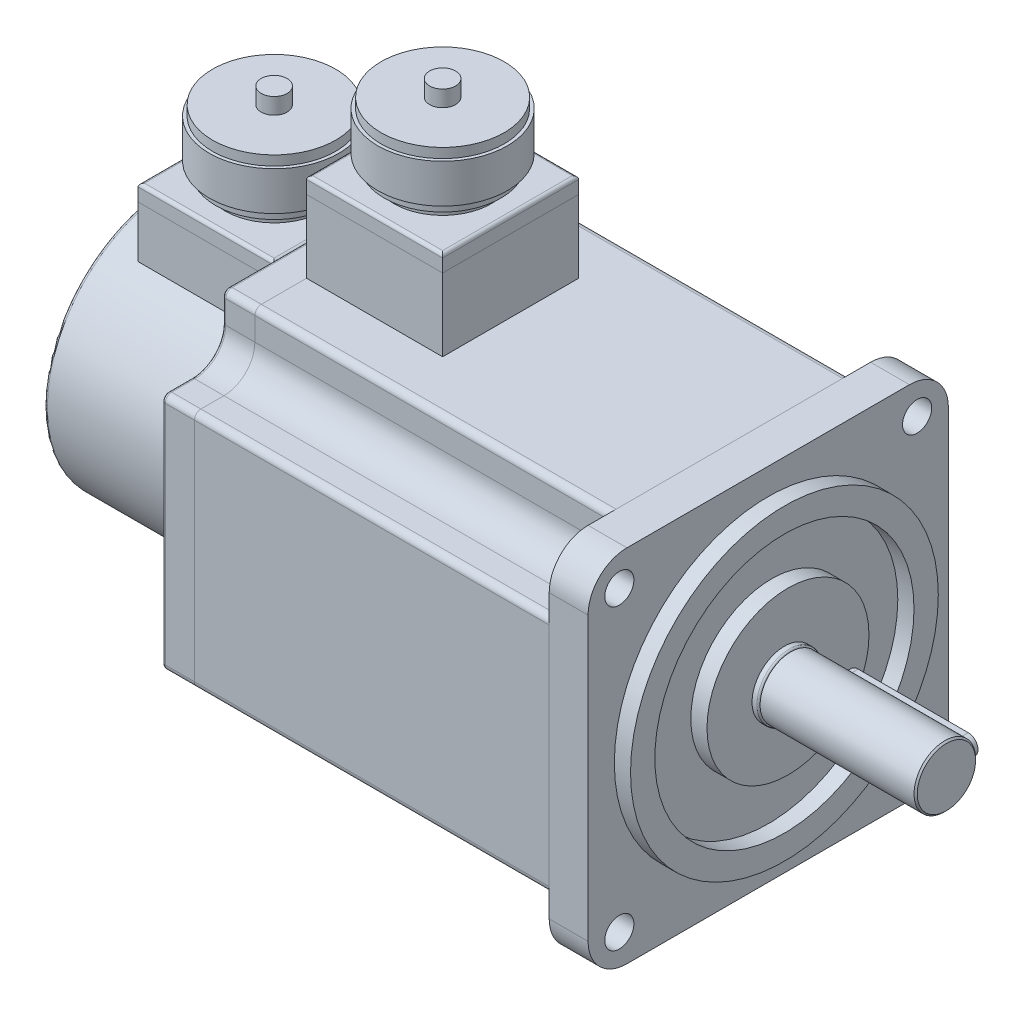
ISO-10303-21;
HEADER;
FILE_DESCRIPTION(('STEP AP214'),'2;1');
FILE_NAME('part.step','',(''),(''),'','','');
FILE_SCHEMA(('AUTOMOTIVE_DESIGN { 1 0 10303 214 1 1 1 1 }'));
ENDSEC;
DATA;
#1=APPLICATION_CONTEXT('core data for automotive mechanical design processes');
#2=APPLICATION_PROTOCOL_DEFINITION('international standard','automotive_design',2000,#1);
#3=PRODUCT_CONTEXT('',#1,'mechanical');
#4=PRODUCT('Part','Part','',(#3));
#5=PRODUCT_RELATED_PRODUCT_CATEGORY('part','',(#4));
#6=PRODUCT_DEFINITION_FORMATION('','',#4);
#7=PRODUCT_DEFINITION_CONTEXT('part definition',#1,'design');
#8=PRODUCT_DEFINITION('design','',#6,#7);
#9=PRODUCT_DEFINITION_SHAPE('','',#8);
#10=(LENGTH_UNIT() NAMED_UNIT(*) SI_UNIT(.MILLI.,.METRE.));
#11=(NAMED_UNIT(*) PLANE_ANGLE_UNIT() SI_UNIT($,.RADIAN.));
#12=(NAMED_UNIT(*) SI_UNIT($,.STERADIAN.) SOLID_ANGLE_UNIT());
#13=UNCERTAINTY_MEASURE_WITH_UNIT(LENGTH_MEASURE(1.E-05),#10,'distance_accuracy_value','');
#14=(GEOMETRIC_REPRESENTATION_CONTEXT(3) GLOBAL_UNCERTAINTY_ASSIGNED_CONTEXT((#13)) GLOBAL_UNIT_ASSIGNED_CONTEXT((#10,
#11,#12)) REPRESENTATION_CONTEXT('',''));
#15=CARTESIAN_POINT('',(0.,0.,0.));
#16=DIRECTION('',(0.,0.,1.));
#17=DIRECTION('',(1.,0.,0.));
#18=AXIS2_PLACEMENT_3D('',#15,#16,#17);
#19=CARTESIAN_POINT('',(181.,0.,-12.25));
#20=DIRECTION('',(0.,0.,1.));
#21=DIRECTION('',(1.,0.,0.));
#22=AXIS2_PLACEMENT_3D('',#19,#20,#21);
#23=CYLINDRICAL_SURFACE('',#22,2.99999999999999);
#24=CARTESIAN_POINT('',(181.,0.,-6.25));
#25=DIRECTION('',(0.,0.,-1.));
#26=DIRECTION('',(-1.,0.,0.));
#27=AXIS2_PLACEMENT_3D('',#24,#25,#26);
#28=CIRCLE('',#27,2.99999999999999);
#29=CARTESIAN_POINT('',(181.,2.99999999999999,-6.25));
#30=VERTEX_POINT('',#29);
#31=CARTESIAN_POINT('',(181.,-3.,-6.25));
#32=VERTEX_POINT('',#31);
#33=EDGE_CURVE('E115',#30,#32,#28,.T.);
#34=ORIENTED_EDGE('',*,*,#33,.T.);
#35=DIRECTION('',(0.,0.,1.));
#36=VECTOR('',#35,1.);
#37=CARTESIAN_POINT('',(181.,-3.,-12.25));
#38=LINE('',#37,#36);
#39=CARTESIAN_POINT('',(181.,-3.,-12.25));
#40=VERTEX_POINT('',#39);
#41=EDGE_CURVE('E13',#40,#32,#38,.T.);
#42=ORIENTED_EDGE('',*,*,#41,.F.);
#43=CARTESIAN_POINT('',(181.,0.,-12.25));
#44=DIRECTION('',(0.,0.,-1.));
#45=DIRECTION('',(-1.,0.,0.));
#46=AXIS2_PLACEMENT_3D('',#43,#44,#45);
#47=CIRCLE('',#46,2.99999999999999);
#48=CARTESIAN_POINT('',(181.,2.99999999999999,-12.25));
#49=VERTEX_POINT('',#48);
#50=EDGE_CURVE('E103',#49,#40,#47,.T.);
#51=ORIENTED_EDGE('',*,*,#50,.F.);
#52=DIRECTION('',(0.,0.,1.));
#53=VECTOR('',#52,1.);
#54=CARTESIAN_POINT('',(181.,2.99999999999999,-12.25));
#55=LINE('',#54,#53);
#56=EDGE_CURVE('E111',#49,#30,#55,.T.);
#57=ORIENTED_EDGE('',*,*,#56,.T.);
#58=EDGE_LOOP('',(#34,#42,#51,#57));
#59=FACE_BOUND('',#58,.T.);
#60=ADVANCED_FACE('F52',(#59),#23,.T.);
#61=CARTESIAN_POINT('',(147.,-3.,-12.25));
#62=DIRECTION('',(0.,1.,0.));
#63=DIRECTION('',(-1.,0.,0.));
#64=AXIS2_PLACEMENT_3D('',#61,#62,#63);
#65=PLANE('',#64);
#66=DIRECTION('',(-1.,0.,0.));
#67=VECTOR('',#66,1.);
#68=CARTESIAN_POINT('',(147.,-3.,-6.25));
#69=LINE('',#68,#67);
#70=CARTESIAN_POINT('',(147.,-3.,-6.25));
#71=VERTEX_POINT('',#70);
#72=EDGE_CURVE('E107',#32,#71,#69,.T.);
#73=ORIENTED_EDGE('',*,*,#72,.T.);
#74=DIRECTION('',(0.,0.,1.));
#75=VECTOR('',#74,1.);
#76=CARTESIAN_POINT('',(147.,-3.,-12.25));
#77=LINE('',#76,#75);
#78=CARTESIAN_POINT('',(147.,-3.,-12.25));
#79=VERTEX_POINT('',#78);
#80=EDGE_CURVE('E60',#79,#71,#77,.T.);
#81=ORIENTED_EDGE('',*,*,#80,.F.);
#82=DIRECTION('',(-1.,0.,0.));
#83=VECTOR('',#82,1.);
#84=CARTESIAN_POINT('',(147.,-3.,-12.25));
#85=LINE('',#84,#83);
#86=EDGE_CURVE('E98',#40,#79,#85,.T.);
#87=ORIENTED_EDGE('',*,*,#86,.F.);
#88=ORIENTED_EDGE('',*,*,#41,.T.);
#89=EDGE_LOOP('',(#73,#81,#87,#88));
#90=FACE_BOUND('',#89,.T.);
#91=ADVANCED_FACE('F106',(#90),#65,.F.);
#92=CARTESIAN_POINT('',(147.,0.,-12.25));
#93=DIRECTION('',(0.,0.,1.));
#94=DIRECTION('',(1.,0.,0.));
#95=AXIS2_PLACEMENT_3D('',#92,#93,#94);
#96=CYLINDRICAL_SURFACE('',#95,2.99999999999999);
#97=CARTESIAN_POINT('',(147.,0.,-6.25));
#98=DIRECTION('',(0.,0.,-1.));
#99=DIRECTION('',(-1.,0.,0.));
#100=AXIS2_PLACEMENT_3D('',#97,#98,#99);
#101=CIRCLE('',#100,2.99999999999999);
#102=CARTESIAN_POINT('',(147.,2.99999999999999,-6.25));
#103=VERTEX_POINT('',#102);
#104=EDGE_CURVE('E85',#71,#103,#101,.T.);
#105=ORIENTED_EDGE('',*,*,#104,.T.);
#106=DIRECTION('',(0.,0.,1.));
#107=VECTOR('',#106,1.);
#108=CARTESIAN_POINT('',(147.,2.99999999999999,-12.25));
#109=LINE('',#108,#107);
#110=CARTESIAN_POINT('',(147.,2.99999999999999,-12.25));
#111=VERTEX_POINT('',#110);
#112=EDGE_CURVE('E108',#111,#103,#109,.T.);
#113=ORIENTED_EDGE('',*,*,#112,.F.);
#114=CARTESIAN_POINT('',(147.,0.,-12.25));
#115=DIRECTION('',(0.,0.,-1.));
#116=DIRECTION('',(-1.,0.,0.));
#117=AXIS2_PLACEMENT_3D('',#114,#115,#116);
#118=CIRCLE('',#117,2.99999999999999);
#119=EDGE_CURVE('E101',#79,#111,#118,.T.);
#120=ORIENTED_EDGE('',*,*,#119,.F.);
#121=ORIENTED_EDGE('',*,*,#80,.T.);
#122=EDGE_LOOP('',(#105,#113,#120,#121));
#123=FACE_BOUND('',#122,.T.);
#124=ADVANCED_FACE('F109',(#123),#96,.T.);
#125=CARTESIAN_POINT('',(181.,2.99999999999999,-12.25));
#126=DIRECTION('',(0.,-1.,0.));
#127=DIRECTION('',(1.,0.,0.));
#128=AXIS2_PLACEMENT_3D('',#125,#126,#127);
#129=PLANE('',#128);
#130=DIRECTION('',(1.,0.,0.));
#131=VECTOR('',#130,1.);
#132=CARTESIAN_POINT('',(181.,2.99999999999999,-6.25));
#133=LINE('',#132,#131);
#134=EDGE_CURVE('E91',#103,#30,#133,.T.);
#135=ORIENTED_EDGE('',*,*,#134,.T.);
#136=ORIENTED_EDGE('',*,*,#56,.F.);
#137=DIRECTION('',(1.,0.,0.));
#138=VECTOR('',#137,1.);
#139=CARTESIAN_POINT('',(181.,2.99999999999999,-12.25));
#140=LINE('',#139,#138);
#141=EDGE_CURVE('E68',#111,#49,#140,.T.);
#142=ORIENTED_EDGE('',*,*,#141,.F.);
#143=ORIENTED_EDGE('',*,*,#112,.T.);
#144=EDGE_LOOP('',(#135,#136,#142,#143));
#145=FACE_BOUND('',#144,.T.);
#146=ADVANCED_FACE('F122',(#145),#129,.F.);
#147=CARTESIAN_POINT('',(181.,0.,-12.25));
#148=DIRECTION('',(0.,0.,-1.));
#149=DIRECTION('',(-1.,0.,0.));
#150=AXIS2_PLACEMENT_3D('',#147,#148,#149);
#151=PLANE('',#150);
#152=ORIENTED_EDGE('',*,*,#50,.T.);
#153=ORIENTED_EDGE('',*,*,#86,.T.);
#154=ORIENTED_EDGE('',*,*,#119,.T.);
#155=ORIENTED_EDGE('',*,*,#141,.T.);
#156=EDGE_LOOP('',(#152,#153,#154,#155));
#157=FACE_BOUND('',#156,.T.);
#158=ADVANCED_FACE('F99',(#157),#151,.T.);
#159=CARTESIAN_POINT('',(181.,0.,-6.25));
#160=DIRECTION('',(0.,0.,-1.));
#161=DIRECTION('',(-1.,0.,0.));
#162=AXIS2_PLACEMENT_3D('',#159,#160,#161);
#163=PLANE('',#162);
#164=ORIENTED_EDGE('',*,*,#33,.F.);
#165=ORIENTED_EDGE('',*,*,#134,.F.);
#166=ORIENTED_EDGE('',*,*,#104,.F.);
#167=ORIENTED_EDGE('',*,*,#72,.F.);
#168=EDGE_LOOP('',(#164,#165,#166,#167));
#169=FACE_BOUND('',#168,.T.);
#170=ADVANCED_FACE('F125',(#169),#163,.F.);
#171=CLOSED_SHELL('',(#60,#91,#124,#146,#158,#170));
#172=MANIFOLD_SOLID_BREP('B2',#171);
#173=CARTESIAN_POINT('',(31.,109.,0.));
#174=DIRECTION('',(0.,-1.,0.));
#175=DIRECTION('',(0.,0.,-1.));
#176=AXIS2_PLACEMENT_3D('',#173,#174,#175);
#177=CYLINDRICAL_SURFACE('',#176,4.);
#178=CARTESIAN_POINT('',(31.,109.,0.));
#179=DIRECTION('',(0.,1.,0.));
#180=DIRECTION('',(0.,0.,1.));
#181=AXIS2_PLACEMENT_3D('',#178,#179,#180);
#182=CIRCLE('',#181,4.);
#183=CARTESIAN_POINT('',(31.,109.,4.));
#184=VERTEX_POINT('',#183);
#185=EDGE_CURVE('E51',#184,#184,#182,.T.);
#186=ORIENTED_EDGE('',*,*,#185,.F.);
#187=EDGE_LOOP('',(#186));
#188=FACE_BOUND('',#187,.T.);
#189=CARTESIAN_POINT('',(31.,104.,0.));
#190=DIRECTION('',(0.,1.,0.));
#191=DIRECTION('',(0.,0.,1.));
#192=AXIS2_PLACEMENT_3D('',#189,#190,#191);
#193=CIRCLE('',#192,4.);
#194=CARTESIAN_POINT('',(31.,104.,4.));
#195=VERTEX_POINT('',#194);
#196=EDGE_CURVE('E187',#195,#195,#193,.T.);
#197=ORIENTED_EDGE('',*,*,#196,.T.);
#198=EDGE_LOOP('',(#197));
#199=FACE_BOUND('',#198,.T.);
#200=ADVANCED_FACE('F184',(#188,#199),#177,.T.);
#201=CARTESIAN_POINT('',(31.,109.,0.));
#202=DIRECTION('',(0.,1.,0.));
#203=DIRECTION('',(0.,0.,1.));
#204=AXIS2_PLACEMENT_3D('',#201,#202,#203);
#205=PLANE('',#204);
#206=ORIENTED_EDGE('',*,*,#185,.T.);
#207=EDGE_LOOP('',(#206));
#208=FACE_BOUND('',#207,.T.);
#209=ADVANCED_FACE('F199',(#208),#205,.T.);
#210=CARTESIAN_POINT('',(31.,104.,0.));
#211=DIRECTION('',(0.,1.,0.));
#212=DIRECTION('',(0.,0.,1.));
#213=AXIS2_PLACEMENT_3D('',#210,#211,#212);
#214=PLANE('',#213);
#215=ORIENTED_EDGE('',*,*,#196,.F.);
#216=EDGE_LOOP('',(#215));
#217=FACE_BOUND('',#216,.T.);
#218=ADVANCED_FACE('F197',(#217),#214,.F.);
#219=CLOSED_SHELL('',(#200,#209,#218));
#220=MANIFOLD_SOLID_BREP('B7',#219);
#221=CARTESIAN_POINT('',(31.,104.,0.));
#222=DIRECTION('',(0.,-1.,0.));
#223=DIRECTION('',(0.,0.,-1.));
#224=AXIS2_PLACEMENT_3D('',#221,#222,#223);
#225=CYLINDRICAL_SURFACE('',#224,19.);
#226=CARTESIAN_POINT('',(31.,104.,0.));
#227=DIRECTION('',(0.,1.,0.));
#228=DIRECTION('',(0.,0.,1.));
#229=AXIS2_PLACEMENT_3D('',#226,#227,#228);
#230=CIRCLE('',#229,19.);
#231=CARTESIAN_POINT('',(31.,104.,19.));
#232=VERTEX_POINT('',#231);
#233=EDGE_CURVE('E183',#232,#232,#230,.T.);
#234=ORIENTED_EDGE('',*,*,#233,.F.);
#235=EDGE_LOOP('',(#234));
#236=FACE_BOUND('',#235,.T.);
#237=CARTESIAN_POINT('',(31.,101.,0.));
#238=DIRECTION('',(0.,1.,0.));
#239=DIRECTION('',(0.,0.,1.));
#240=AXIS2_PLACEMENT_3D('',#237,#238,#239);
#241=CIRCLE('',#240,19.);
#242=CARTESIAN_POINT('',(31.,101.,19.));
#243=VERTEX_POINT('',#242);
#244=EDGE_CURVE('E236',#243,#243,#241,.T.);
#245=ORIENTED_EDGE('',*,*,#244,.T.);
#246=EDGE_LOOP('',(#245));
#247=FACE_BOUND('',#246,.T.);
#248=ADVANCED_FACE('F233',(#236,#247),#225,.T.);
#249=CARTESIAN_POINT('',(31.,104.,0.));
#250=DIRECTION('',(0.,1.,0.));
#251=DIRECTION('',(0.,0.,1.));
#252=AXIS2_PLACEMENT_3D('',#249,#250,#251);
#253=PLANE('',#252);
#254=ORIENTED_EDGE('',*,*,#233,.T.);
#255=EDGE_LOOP('',(#254));
#256=FACE_BOUND('',#255,.T.);
#257=ADVANCED_FACE('F248',(#256),#253,.T.);
#258=CARTESIAN_POINT('',(31.,101.,0.));
#259=DIRECTION('',(0.,1.,0.));
#260=DIRECTION('',(0.,0.,1.));
#261=AXIS2_PLACEMENT_3D('',#258,#259,#260);
#262=PLANE('',#261);
#263=ORIENTED_EDGE('',*,*,#244,.F.);
#264=EDGE_LOOP('',(#263));
#265=FACE_BOUND('',#264,.T.);
#266=ADVANCED_FACE('F246',(#265),#262,.F.);
#267=CLOSED_SHELL('',(#248,#257,#266));
#268=MANIFOLD_SOLID_BREP('B46',#267);
#269=CARTESIAN_POINT('',(31.,101.,0.));
#270=DIRECTION('',(0.,-1.,0.));
#271=DIRECTION('',(0.,0.,-1.));
#272=AXIS2_PLACEMENT_3D('',#269,#270,#271);
#273=CYLINDRICAL_SURFACE('',#272,20.);
#274=CARTESIAN_POINT('',(31.,101.,0.));
#275=DIRECTION('',(0.,1.,0.));
#276=DIRECTION('',(0.,0.,1.));
#277=AXIS2_PLACEMENT_3D('',#274,#275,#276);
#278=CIRCLE('',#277,20.);
#279=CARTESIAN_POINT('',(31.,101.,20.));
#280=VERTEX_POINT('',#279);
#281=EDGE_CURVE('E232',#280,#280,#278,.T.);
#282=ORIENTED_EDGE('',*,*,#281,.F.);
#283=EDGE_LOOP('',(#282));
#284=FACE_BOUND('',#283,.T.);
#285=CARTESIAN_POINT('',(31.,89.,0.));
#286=DIRECTION('',(0.,1.,0.));
#287=DIRECTION('',(0.,0.,1.));
#288=AXIS2_PLACEMENT_3D('',#285,#286,#287);
#289=CIRCLE('',#288,20.);
#290=CARTESIAN_POINT('',(31.,89.,20.));
#291=VERTEX_POINT('',#290);
#292=EDGE_CURVE('E285',#291,#291,#289,.T.);
#293=ORIENTED_EDGE('',*,*,#292,.T.);
#294=EDGE_LOOP('',(#293));
#295=FACE_BOUND('',#294,.T.);
#296=ADVANCED_FACE('F282',(#284,#295),#273,.T.);
#297=CARTESIAN_POINT('',(31.,101.,0.));
#298=DIRECTION('',(0.,1.,0.));
#299=DIRECTION('',(0.,0.,1.));
#300=AXIS2_PLACEMENT_3D('',#297,#298,#299);
#301=PLANE('',#300);
#302=ORIENTED_EDGE('',*,*,#281,.T.);
#303=EDGE_LOOP('',(#302));
#304=FACE_BOUND('',#303,.T.);
#305=ADVANCED_FACE('F297',(#304),#301,.T.);
#306=CARTESIAN_POINT('',(31.,89.,0.));
#307=DIRECTION('',(0.,1.,0.));
#308=DIRECTION('',(0.,0.,1.));
#309=AXIS2_PLACEMENT_3D('',#306,#307,#308);
#310=PLANE('',#309);
#311=ORIENTED_EDGE('',*,*,#292,.F.);
#312=EDGE_LOOP('',(#311));
#313=FACE_BOUND('',#312,.T.);
#314=ADVANCED_FACE('F295',(#313),#310,.F.);
#315=CLOSED_SHELL('',(#296,#305,#314));
#316=MANIFOLD_SOLID_BREP('B178',#315);
#317=CARTESIAN_POINT('',(31.,89.,0.));
#318=DIRECTION('',(0.,-1.,0.));
#319=DIRECTION('',(0.,0.,-1.));
#320=AXIS2_PLACEMENT_3D('',#317,#318,#319);
#321=CYLINDRICAL_SURFACE('',#320,18.);
#322=CARTESIAN_POINT('',(31.,89.,0.));
#323=DIRECTION('',(0.,1.,0.));
#324=DIRECTION('',(0.,0.,1.));
#325=AXIS2_PLACEMENT_3D('',#322,#323,#324);
#326=CIRCLE('',#325,18.);
#327=CARTESIAN_POINT('',(31.,89.,18.));
#328=VERTEX_POINT('',#327);
#329=EDGE_CURVE('E281',#328,#328,#326,.T.);
#330=ORIENTED_EDGE('',*,*,#329,.F.);
#331=EDGE_LOOP('',(#330));
#332=FACE_BOUND('',#331,.T.);
#333=CARTESIAN_POINT('',(31.,86.,0.));
#334=DIRECTION('',(0.,1.,0.));
#335=DIRECTION('',(0.,0.,1.));
#336=AXIS2_PLACEMENT_3D('',#333,#334,#335);
#337=CIRCLE('',#336,18.);
#338=CARTESIAN_POINT('',(31.,86.,18.));
#339=VERTEX_POINT('',#338);
#340=EDGE_CURVE('E334',#339,#339,#337,.T.);
#341=ORIENTED_EDGE('',*,*,#340,.T.);
#342=EDGE_LOOP('',(#341));
#343=FACE_BOUND('',#342,.T.);
#344=ADVANCED_FACE('F331',(#332,#343),#321,.T.);
#345=CARTESIAN_POINT('',(31.,89.,0.));
#346=DIRECTION('',(0.,1.,0.));
#347=DIRECTION('',(0.,0.,1.));
#348=AXIS2_PLACEMENT_3D('',#345,#346,#347);
#349=PLANE('',#348);
#350=ORIENTED_EDGE('',*,*,#329,.T.);
#351=EDGE_LOOP('',(#350));
#352=FACE_BOUND('',#351,.T.);
#353=ADVANCED_FACE('F346',(#352),#349,.T.);
#354=CARTESIAN_POINT('',(31.,86.,0.));
#355=DIRECTION('',(0.,1.,0.));
#356=DIRECTION('',(0.,0.,1.));
#357=AXIS2_PLACEMENT_3D('',#354,#355,#356);
#358=PLANE('',#357);
#359=ORIENTED_EDGE('',*,*,#340,.F.);
#360=EDGE_LOOP('',(#359));
#361=FACE_BOUND('',#360,.T.);
#362=ADVANCED_FACE('F344',(#361),#358,.F.);
#363=CLOSED_SHELL('',(#344,#353,#362));
#364=MANIFOLD_SOLID_BREP('B227',#363);
#365=CARTESIAN_POINT('',(31.,86.,0.));
#366=DIRECTION('',(0.,-1.,0.));
#367=DIRECTION('',(0.,0.,-1.));
#368=AXIS2_PLACEMENT_3D('',#365,#366,#367);
#369=CYLINDRICAL_SURFACE('',#368,15.);
#370=CARTESIAN_POINT('',(31.,86.,0.));
#371=DIRECTION('',(0.,1.,0.));
#372=DIRECTION('',(0.,0.,1.));
#373=AXIS2_PLACEMENT_3D('',#370,#371,#372);
#374=CIRCLE('',#373,15.);
#375=CARTESIAN_POINT('',(31.,86.,15.));
#376=VERTEX_POINT('',#375);
#377=EDGE_CURVE('E330',#376,#376,#374,.T.);
#378=ORIENTED_EDGE('',*,*,#377,.F.);
#379=EDGE_LOOP('',(#378));
#380=FACE_BOUND('',#379,.T.);
#381=CARTESIAN_POINT('',(31.,83.,0.));
#382=DIRECTION('',(0.,1.,0.));
#383=DIRECTION('',(0.,0.,1.));
#384=AXIS2_PLACEMENT_3D('',#381,#382,#383);
#385=CIRCLE('',#384,15.);
#386=CARTESIAN_POINT('',(31.,83.,15.));
#387=VERTEX_POINT('',#386);
#388=EDGE_CURVE('E385',#387,#387,#385,.T.);
#389=ORIENTED_EDGE('',*,*,#388,.T.);
#390=EDGE_LOOP('',(#389));
#391=FACE_BOUND('',#390,.T.);
#392=ADVANCED_FACE('F382',(#380,#391),#369,.T.);
#393=CARTESIAN_POINT('',(31.,86.,0.));
#394=DIRECTION('',(0.,1.,0.));
#395=DIRECTION('',(0.,0.,1.));
#396=AXIS2_PLACEMENT_3D('',#393,#394,#395);
#397=PLANE('',#396);
#398=ORIENTED_EDGE('',*,*,#377,.T.);
#399=EDGE_LOOP('',(#398));
#400=FACE_BOUND('',#399,.T.);
#401=ADVANCED_FACE('F397',(#400),#397,.T.);
#402=CARTESIAN_POINT('',(31.,83.,0.));
#403=DIRECTION('',(0.,1.,0.));
#404=DIRECTION('',(0.,0.,1.));
#405=AXIS2_PLACEMENT_3D('',#402,#403,#404);
#406=PLANE('',#405);
#407=ORIENTED_EDGE('',*,*,#388,.F.);
#408=EDGE_LOOP('',(#407));
#409=FACE_BOUND('',#408,.T.);
#410=ADVANCED_FACE('F395',(#409),#406,.F.);
#411=CLOSED_SHELL('',(#392,#401,#410));
#412=MANIFOLD_SOLID_BREP('B276',#411);
#413=CARTESIAN_POINT('',(52.,83.,21.));
#414=DIRECTION('',(-1.,0.,0.));
#415=DIRECTION('',(0.,0.,1.));
#416=AXIS2_PLACEMENT_3D('',#413,#414,#415);
#417=PLANE('',#416);
#418=DIRECTION('',(0.,-1.,0.));
#419=VECTOR('',#418,1.);
#420=CARTESIAN_POINT('',(52.,83.,-21.));
#421=LINE('',#420,#419);
#422=CARTESIAN_POINT('',(52.,82.,-21.));
#423=VERTEX_POINT('',#422);
#424=CARTESIAN_POINT('',(52.,78.,-21.));
#425=VERTEX_POINT('',#424);
#426=EDGE_CURVE('E485',#423,#425,#421,.T.);
#427=ORIENTED_EDGE('',*,*,#426,.F.);
#428=DIRECTION('',(0.,0.,-1.));
#429=VECTOR('',#428,1.);
#430=CARTESIAN_POINT('',(52.,82.,21.));
#431=LINE('',#430,#429);
#432=CARTESIAN_POINT('',(52.,82.,21.));
#433=VERTEX_POINT('',#432);
#434=EDGE_CURVE('E380',#423,#433,#431,.F.);
#435=ORIENTED_EDGE('',*,*,#434,.T.);
#436=DIRECTION('',(0.,-1.,0.));
#437=VECTOR('',#436,1.);
#438=CARTESIAN_POINT('',(52.,83.,21.));
#439=LINE('',#438,#437);
#440=CARTESIAN_POINT('',(52.,78.,21.));
#441=VERTEX_POINT('',#440);
#442=EDGE_CURVE('E505',#433,#441,#439,.T.);
#443=ORIENTED_EDGE('',*,*,#442,.T.);
#444=DIRECTION('',(0.,0.,-1.));
#445=VECTOR('',#444,1.);
#446=CARTESIAN_POINT('',(52.,78.,21.));
#447=LINE('',#446,#445);
#448=EDGE_CURVE('E500',#441,#425,#447,.T.);
#449=ORIENTED_EDGE('',*,*,#448,.T.);
#450=EDGE_LOOP('',(#427,#435,#443,#449));
#451=FACE_BOUND('',#450,.T.);
#452=ADVANCED_FACE('F433',(#451),#417,.F.);
#453=CARTESIAN_POINT('',(10.,83.,-21.));
#454=DIRECTION('',(0.,0.,1.));
#455=DIRECTION('',(1.,0.,0.));
#456=AXIS2_PLACEMENT_3D('',#453,#454,#455);
#457=PLANE('',#456);
#458=DIRECTION('',(0.,-1.,0.));
#459=VECTOR('',#458,1.);
#460=CARTESIAN_POINT('',(10.,83.,-21.));
#461=LINE('',#460,#459);
#462=CARTESIAN_POINT('',(10.,82.,-21.));
#463=VERTEX_POINT('',#462);
#464=CARTESIAN_POINT('',(10.,78.,-21.));
#465=VERTEX_POINT('',#464);
#466=EDGE_CURVE('E494',#463,#465,#461,.T.);
#467=ORIENTED_EDGE('',*,*,#466,.F.);
#468=DIRECTION('',(-1.,0.,0.));
#469=VECTOR('',#468,1.);
#470=CARTESIAN_POINT('',(10.,82.,-21.));
#471=LINE('',#470,#469);
#472=EDGE_CURVE('E442',#463,#423,#471,.F.);
#473=ORIENTED_EDGE('',*,*,#472,.T.);
#474=ORIENTED_EDGE('',*,*,#426,.T.);
#475=DIRECTION('',(-1.,0.,0.));
#476=VECTOR('',#475,1.);
#477=CARTESIAN_POINT('',(10.,78.,-21.));
#478=LINE('',#477,#476);
#479=EDGE_CURVE('E488',#425,#465,#478,.T.);
#480=ORIENTED_EDGE('',*,*,#479,.T.);
#481=EDGE_LOOP('',(#467,#473,#474,#480));
#482=FACE_BOUND('',#481,.T.);
#483=ADVANCED_FACE('F487',(#482),#457,.F.);
#484=CARTESIAN_POINT('',(10.,83.,21.));
#485=DIRECTION('',(1.,0.,0.));
#486=DIRECTION('',(0.,0.,-1.));
#487=AXIS2_PLACEMENT_3D('',#484,#485,#486);
#488=PLANE('',#487);
#489=DIRECTION('',(0.,-1.,0.));
#490=VECTOR('',#489,1.);
#491=CARTESIAN_POINT('',(10.,83.,21.));
#492=LINE('',#491,#490);
#493=CARTESIAN_POINT('',(10.,82.,21.));
#494=VERTEX_POINT('',#493);
#495=CARTESIAN_POINT('',(10.,78.,21.));
#496=VERTEX_POINT('',#495);
#497=EDGE_CURVE('E515',#494,#496,#492,.T.);
#498=ORIENTED_EDGE('',*,*,#497,.F.);
#499=DIRECTION('',(0.,0.,1.));
#500=VECTOR('',#499,1.);
#501=CARTESIAN_POINT('',(10.,82.,21.));
#502=LINE('',#501,#500);
#503=EDGE_CURVE('E457',#494,#463,#502,.F.);
#504=ORIENTED_EDGE('',*,*,#503,.T.);
#505=ORIENTED_EDGE('',*,*,#466,.T.);
#506=DIRECTION('',(0.,0.,1.));
#507=VECTOR('',#506,1.);
#508=CARTESIAN_POINT('',(10.,78.,21.));
#509=LINE('',#508,#507);
#510=EDGE_CURVE('E502',#465,#496,#509,.T.);
#511=ORIENTED_EDGE('',*,*,#510,.T.);
#512=EDGE_LOOP('',(#498,#504,#505,#511));
#513=FACE_BOUND('',#512,.T.);
#514=ADVANCED_FACE('F553',(#513),#488,.F.);
#515=CARTESIAN_POINT('',(10.,83.,21.));
#516=DIRECTION('',(0.,0.,-1.));
#517=DIRECTION('',(-1.,0.,0.));
#518=AXIS2_PLACEMENT_3D('',#515,#516,#517);
#519=PLANE('',#518);
#520=ORIENTED_EDGE('',*,*,#442,.F.);
#521=DIRECTION('',(1.,0.,0.));
#522=VECTOR('',#521,1.);
#523=CARTESIAN_POINT('',(10.,82.,21.));
#524=LINE('',#523,#522);
#525=EDGE_CURVE('E526',#433,#494,#524,.F.);
#526=ORIENTED_EDGE('',*,*,#525,.T.);
#527=ORIENTED_EDGE('',*,*,#497,.T.);
#528=DIRECTION('',(1.,0.,0.));
#529=VECTOR('',#528,1.);
#530=CARTESIAN_POINT('',(10.,78.,21.));
#531=LINE('',#530,#529);
#532=EDGE_CURVE('E512',#496,#441,#531,.T.);
#533=ORIENTED_EDGE('',*,*,#532,.T.);
#534=EDGE_LOOP('',(#520,#526,#527,#533));
#535=FACE_BOUND('',#534,.T.);
#536=ADVANCED_FACE('F552',(#535),#519,.F.);
#537=CARTESIAN_POINT('',(0.,83.,0.));
#538=DIRECTION('',(0.,-1.,0.));
#539=DIRECTION('',(0.,0.,-1.));
#540=AXIS2_PLACEMENT_3D('',#537,#538,#539);
#541=PLANE('',#540);
#542=DIRECTION('',(0.,0.,1.));
#543=VECTOR('',#542,1.);
#544=CARTESIAN_POINT('',(11.,83.,0.));
#545=LINE('',#544,#543);
#546=CARTESIAN_POINT('',(11.,83.,-20.));
#547=VERTEX_POINT('',#546);
#548=CARTESIAN_POINT('',(11.,83.,20.));
#549=VERTEX_POINT('',#548);
#550=EDGE_CURVE('E521',#547,#549,#545,.T.);
#551=ORIENTED_EDGE('',*,*,#550,.T.);
#552=DIRECTION('',(1.,0.,0.));
#553=VECTOR('',#552,1.);
#554=CARTESIAN_POINT('',(0.,83.,20.));
#555=LINE('',#554,#553);
#556=CARTESIAN_POINT('',(51.,83.,20.));
#557=VERTEX_POINT('',#556);
#558=EDGE_CURVE('E523',#549,#557,#555,.T.);
#559=ORIENTED_EDGE('',*,*,#558,.T.);
#560=DIRECTION('',(0.,0.,-1.));
#561=VECTOR('',#560,1.);
#562=CARTESIAN_POINT('',(51.,83.,0.));
#563=LINE('',#562,#561);
#564=CARTESIAN_POINT('',(51.,83.,-20.));
#565=VERTEX_POINT('',#564);
#566=EDGE_CURVE('E493',#557,#565,#563,.T.);
#567=ORIENTED_EDGE('',*,*,#566,.T.);
#568=DIRECTION('',(-1.,0.,0.));
#569=VECTOR('',#568,1.);
#570=CARTESIAN_POINT('',(0.,83.,-20.));
#571=LINE('',#570,#569);
#572=EDGE_CURVE('E519',#565,#547,#571,.T.);
#573=ORIENTED_EDGE('',*,*,#572,.T.);
#574=EDGE_LOOP('',(#551,#559,#567,#573));
#575=FACE_BOUND('',#574,.T.);
#576=ADVANCED_FACE('F545',(#575),#541,.F.);
#577=CARTESIAN_POINT('',(0.,78.,0.));
#578=DIRECTION('',(0.,-1.,0.));
#579=DIRECTION('',(0.,0.,-1.));
#580=AXIS2_PLACEMENT_3D('',#577,#578,#579);
#581=PLANE('',#580);
#582=ORIENTED_EDGE('',*,*,#448,.F.);
#583=ORIENTED_EDGE('',*,*,#532,.F.);
#584=ORIENTED_EDGE('',*,*,#510,.F.);
#585=ORIENTED_EDGE('',*,*,#479,.F.);
#586=EDGE_LOOP('',(#582,#583,#584,#585));
#587=FACE_BOUND('',#586,.T.);
#588=ADVANCED_FACE('F498',(#587),#581,.T.);
#589=CARTESIAN_POINT('',(0.,82.,-20.));
#590=DIRECTION('',(-1.,0.,0.));
#591=DIRECTION('',(0.,0.,1.));
#592=AXIS2_PLACEMENT_3D('',#589,#590,#591);
#593=CYLINDRICAL_SURFACE('',#592,1.);
#594=CARTESIAN_POINT('',(51.,82.,-20.));
#595=DIRECTION('',(-0.707106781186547,0.,-0.707106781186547));
#596=DIRECTION('',(0.707106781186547,0.,-0.707106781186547));
#597=AXIS2_PLACEMENT_3D('',#594,#595,#596);
#598=ELLIPSE('',#597,1.41421356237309,1.);
#599=EDGE_CURVE('E509',#423,#565,#598,.F.);
#600=ORIENTED_EDGE('',*,*,#599,.F.);
#601=ORIENTED_EDGE('',*,*,#472,.F.);
#602=CARTESIAN_POINT('',(11.,82.,-20.));
#603=DIRECTION('',(-0.707106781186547,0.,0.707106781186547));
#604=DIRECTION('',(-0.707106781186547,0.,-0.707106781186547));
#605=AXIS2_PLACEMENT_3D('',#602,#603,#604);
#606=ELLIPSE('',#605,1.41421356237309,1.);
#607=EDGE_CURVE('E437',#547,#463,#606,.T.);
#608=ORIENTED_EDGE('',*,*,#607,.F.);
#609=ORIENTED_EDGE('',*,*,#572,.F.);
#610=EDGE_LOOP('',(#600,#601,#608,#609));
#611=FACE_BOUND('',#610,.T.);
#612=ADVANCED_FACE('F435',(#611),#593,.T.);
#613=CARTESIAN_POINT('',(11.,82.,0.));
#614=DIRECTION('',(0.,0.,1.));
#615=DIRECTION('',(1.,0.,0.));
#616=AXIS2_PLACEMENT_3D('',#613,#614,#615);
#617=CYLINDRICAL_SURFACE('',#616,1.);
#618=ORIENTED_EDGE('',*,*,#607,.T.);
#619=ORIENTED_EDGE('',*,*,#503,.F.);
#620=CARTESIAN_POINT('',(11.,82.,20.));
#621=DIRECTION('',(0.707106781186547,0.,0.707106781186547));
#622=DIRECTION('',(-0.707106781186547,0.,0.707106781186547));
#623=AXIS2_PLACEMENT_3D('',#620,#621,#622);
#624=ELLIPSE('',#623,1.41421356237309,1.);
#625=EDGE_CURVE('E533',#549,#494,#624,.T.);
#626=ORIENTED_EDGE('',*,*,#625,.F.);
#627=ORIENTED_EDGE('',*,*,#550,.F.);
#628=EDGE_LOOP('',(#618,#619,#626,#627));
#629=FACE_BOUND('',#628,.T.);
#630=ADVANCED_FACE('F570',(#629),#617,.T.);
#631=CARTESIAN_POINT('',(51.,82.,0.));
#632=DIRECTION('',(0.,0.,-1.));
#633=DIRECTION('',(-1.,0.,0.));
#634=AXIS2_PLACEMENT_3D('',#631,#632,#633);
#635=CYLINDRICAL_SURFACE('',#634,1.);
#636=ORIENTED_EDGE('',*,*,#599,.T.);
#637=ORIENTED_EDGE('',*,*,#566,.F.);
#638=CARTESIAN_POINT('',(51.,82.,20.));
#639=DIRECTION('',(0.707106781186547,0.,-0.707106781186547));
#640=DIRECTION('',(-0.707106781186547,0.,-0.707106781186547));
#641=AXIS2_PLACEMENT_3D('',#638,#639,#640);
#642=ELLIPSE('',#641,1.41421356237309,1.);
#643=EDGE_CURVE('E531',#433,#557,#642,.F.);
#644=ORIENTED_EDGE('',*,*,#643,.F.);
#645=ORIENTED_EDGE('',*,*,#434,.F.);
#646=EDGE_LOOP('',(#636,#637,#644,#645));
#647=FACE_BOUND('',#646,.T.);
#648=ADVANCED_FACE('F538',(#647),#635,.T.);
#649=CARTESIAN_POINT('',(0.,82.,20.));
#650=DIRECTION('',(1.,0.,0.));
#651=DIRECTION('',(0.,0.,-1.));
#652=AXIS2_PLACEMENT_3D('',#649,#650,#651);
#653=CYLINDRICAL_SURFACE('',#652,1.);
#654=ORIENTED_EDGE('',*,*,#625,.T.);
#655=ORIENTED_EDGE('',*,*,#525,.F.);
#656=ORIENTED_EDGE('',*,*,#643,.T.);
#657=ORIENTED_EDGE('',*,*,#558,.F.);
#658=EDGE_LOOP('',(#654,#655,#656,#657));
#659=FACE_BOUND('',#658,.T.);
#660=ADVANCED_FACE('F549',(#659),#653,.T.);
#661=CLOSED_SHELL('',(#452,#483,#514,#536,#576,#588,#612,#630,#648,#660));
#662=MANIFOLD_SOLID_BREP('B325',#661);
#663=CARTESIAN_POINT('',(52.,78.,21.));
#664=DIRECTION('',(-1.,0.,0.));
#665=DIRECTION('',(0.,0.,1.));
#666=AXIS2_PLACEMENT_3D('',#663,#664,#665);
#667=PLANE('',#666);
#668=DIRECTION('',(0.,0.,-1.));
#669=VECTOR('',#668,1.);
#670=CARTESIAN_POINT('',(52.,55.6,21.));
#671=LINE('',#670,#669);
#672=CARTESIAN_POINT('',(52.,55.6,21.));
#673=VERTEX_POINT('',#672);
#674=CARTESIAN_POINT('',(52.,55.6,-21.));
#675=VERTEX_POINT('',#674);
#676=EDGE_CURVE('E708',#673,#675,#671,.T.);
#677=ORIENTED_EDGE('',*,*,#676,.T.);
#678=DIRECTION('',(0.,-1.,0.));
#679=VECTOR('',#678,1.);
#680=CARTESIAN_POINT('',(52.,78.,-21.));
#681=LINE('',#680,#679);
#682=CARTESIAN_POINT('',(52.,78.,-21.));
#683=VERTEX_POINT('',#682);
#684=EDGE_CURVE('E431',#683,#675,#681,.T.);
#685=ORIENTED_EDGE('',*,*,#684,.F.);
#686=DIRECTION('',(0.,0.,-1.));
#687=VECTOR('',#686,1.);
#688=CARTESIAN_POINT('',(52.,78.,21.));
#689=LINE('',#688,#687);
#690=CARTESIAN_POINT('',(52.,78.,21.));
#691=VERTEX_POINT('',#690);
#692=EDGE_CURVE('E696',#691,#683,#689,.T.);
#693=ORIENTED_EDGE('',*,*,#692,.F.);
#694=DIRECTION('',(0.,-1.,0.));
#695=VECTOR('',#694,1.);
#696=CARTESIAN_POINT('',(52.,78.,21.));
#697=LINE('',#696,#695);
#698=EDGE_CURVE('E704',#691,#673,#697,.T.);
#699=ORIENTED_EDGE('',*,*,#698,.T.);
#700=EDGE_LOOP('',(#677,#685,#693,#699));
#701=FACE_BOUND('',#700,.T.);
#702=ADVANCED_FACE('F645',(#701),#667,.F.);
#703=CARTESIAN_POINT('',(10.,78.,-21.));
#704=DIRECTION('',(0.,0.,1.));
#705=DIRECTION('',(1.,0.,0.));
#706=AXIS2_PLACEMENT_3D('',#703,#704,#705);
#707=PLANE('',#706);
#708=DIRECTION('',(-1.,0.,0.));
#709=VECTOR('',#708,1.);
#710=CARTESIAN_POINT('',(10.,55.6,-21.));
#711=LINE('',#710,#709);
#712=CARTESIAN_POINT('',(10.,55.6,-21.));
#713=VERTEX_POINT('',#712);
#714=EDGE_CURVE('E700',#675,#713,#711,.T.);
#715=ORIENTED_EDGE('',*,*,#714,.T.);
#716=DIRECTION('',(0.,-1.,0.));
#717=VECTOR('',#716,1.);
#718=CARTESIAN_POINT('',(10.,78.,-21.));
#719=LINE('',#718,#717);
#720=CARTESIAN_POINT('',(10.,78.,-21.));
#721=VERTEX_POINT('',#720);
#722=EDGE_CURVE('E653',#721,#713,#719,.T.);
#723=ORIENTED_EDGE('',*,*,#722,.F.);
#724=DIRECTION('',(-1.,0.,0.));
#725=VECTOR('',#724,1.);
#726=CARTESIAN_POINT('',(10.,78.,-21.));
#727=LINE('',#726,#725);
#728=EDGE_CURVE('E691',#683,#721,#727,.T.);
#729=ORIENTED_EDGE('',*,*,#728,.F.);
#730=ORIENTED_EDGE('',*,*,#684,.T.);
#731=EDGE_LOOP('',(#715,#723,#729,#730));
#732=FACE_BOUND('',#731,.T.);
#733=ADVANCED_FACE('F699',(#732),#707,.F.);
#734=CARTESIAN_POINT('',(10.,78.,21.));
#735=DIRECTION('',(1.,0.,0.));
#736=DIRECTION('',(0.,0.,-1.));
#737=AXIS2_PLACEMENT_3D('',#734,#735,#736);
#738=PLANE('',#737);
#739=DIRECTION('',(0.,0.,1.));
#740=VECTOR('',#739,1.);
#741=CARTESIAN_POINT('',(10.,55.6,21.));
#742=LINE('',#741,#740);
#743=CARTESIAN_POINT('',(10.,55.6,21.));
#744=VERTEX_POINT('',#743);
#745=EDGE_CURVE('E678',#713,#744,#742,.T.);
#746=ORIENTED_EDGE('',*,*,#745,.T.);
#747=DIRECTION('',(0.,-1.,0.));
#748=VECTOR('',#747,1.);
#749=CARTESIAN_POINT('',(10.,78.,21.));
#750=LINE('',#749,#748);
#751=CARTESIAN_POINT('',(10.,78.,21.));
#752=VERTEX_POINT('',#751);
#753=EDGE_CURVE('E701',#752,#744,#750,.T.);
#754=ORIENTED_EDGE('',*,*,#753,.F.);
#755=DIRECTION('',(0.,0.,1.));
#756=VECTOR('',#755,1.);
#757=CARTESIAN_POINT('',(10.,78.,21.));
#758=LINE('',#757,#756);
#759=EDGE_CURVE('E694',#721,#752,#758,.T.);
#760=ORIENTED_EDGE('',*,*,#759,.F.);
#761=ORIENTED_EDGE('',*,*,#722,.T.);
#762=EDGE_LOOP('',(#746,#754,#760,#761));
#763=FACE_BOUND('',#762,.T.);
#764=ADVANCED_FACE('F702',(#763),#738,.F.);
#765=CARTESIAN_POINT('',(10.,78.,21.));
#766=DIRECTION('',(0.,0.,-1.));
#767=DIRECTION('',(-1.,0.,0.));
#768=AXIS2_PLACEMENT_3D('',#765,#766,#767);
#769=PLANE('',#768);
#770=DIRECTION('',(1.,0.,0.));
#771=VECTOR('',#770,1.);
#772=CARTESIAN_POINT('',(10.,55.6,21.));
#773=LINE('',#772,#771);
#774=EDGE_CURVE('E684',#744,#673,#773,.T.);
#775=ORIENTED_EDGE('',*,*,#774,.T.);
#776=ORIENTED_EDGE('',*,*,#698,.F.);
#777=DIRECTION('',(1.,0.,0.));
#778=VECTOR('',#777,1.);
#779=CARTESIAN_POINT('',(10.,78.,21.));
#780=LINE('',#779,#778);
#781=EDGE_CURVE('E661',#752,#691,#780,.T.);
#782=ORIENTED_EDGE('',*,*,#781,.F.);
#783=ORIENTED_EDGE('',*,*,#753,.T.);
#784=EDGE_LOOP('',(#775,#776,#782,#783));
#785=FACE_BOUND('',#784,.T.);
#786=ADVANCED_FACE('F715',(#785),#769,.F.);
#787=CARTESIAN_POINT('',(0.,78.,0.));
#788=DIRECTION('',(0.,-1.,0.));
#789=DIRECTION('',(0.,0.,-1.));
#790=AXIS2_PLACEMENT_3D('',#787,#788,#789);
#791=PLANE('',#790);
#792=ORIENTED_EDGE('',*,*,#692,.T.);
#793=ORIENTED_EDGE('',*,*,#728,.T.);
#794=ORIENTED_EDGE('',*,*,#759,.T.);
#795=ORIENTED_EDGE('',*,*,#781,.T.);
#796=EDGE_LOOP('',(#792,#793,#794,#795));
#797=FACE_BOUND('',#796,.T.);
#798=ADVANCED_FACE('F692',(#797),#791,.F.);
#799=CARTESIAN_POINT('',(0.,55.6,0.));
#800=DIRECTION('',(0.,-1.,0.));
#801=DIRECTION('',(0.,0.,-1.));
#802=AXIS2_PLACEMENT_3D('',#799,#800,#801);
#803=PLANE('',#802);
#804=ORIENTED_EDGE('',*,*,#676,.F.);
#805=ORIENTED_EDGE('',*,*,#774,.F.);
#806=ORIENTED_EDGE('',*,*,#745,.F.);
#807=ORIENTED_EDGE('',*,*,#714,.F.);
#808=EDGE_LOOP('',(#804,#805,#806,#807));
#809=FACE_BOUND('',#808,.T.);
#810=ADVANCED_FACE('F718',(#809),#803,.T.);
#811=CLOSED_SHELL('',(#702,#733,#764,#786,#798,#810));
#812=MANIFOLD_SOLID_BREP('B374',#811);
#813=CARTESIAN_POINT('',(-21.,76.,0.));
#814=DIRECTION('',(0.,1.,0.));
#815=DIRECTION('',(0.,0.,1.));
#816=AXIS2_PLACEMENT_3D('',#813,#814,#815);
#817=PLANE('',#816);
#818=CARTESIAN_POINT('',(-21.,76.,0.));
#819=DIRECTION('',(0.,1.,0.));
#820=DIRECTION('',(0.,0.,1.));
#821=AXIS2_PLACEMENT_3D('',#818,#819,#820);
#822=CIRCLE('',#821,19.);
#823=CARTESIAN_POINT('',(-21.,76.,19.));
#824=VERTEX_POINT('',#823);
#825=EDGE_CURVE('E801',#824,#824,#822,.T.);
#826=ORIENTED_EDGE('',*,*,#825,.T.);
#827=EDGE_LOOP('',(#826));
#828=FACE_BOUND('',#827,.T.);
#829=CARTESIAN_POINT('',(-21.,76.,0.));
#830=DIRECTION('',(0.,1.,0.));
#831=DIRECTION('',(0.,0.,1.));
#832=AXIS2_PLACEMENT_3D('',#829,#830,#831);
#833=CIRCLE('',#832,4.);
#834=CARTESIAN_POINT('',(-21.,76.,4.));
#835=VERTEX_POINT('',#834);
#836=EDGE_CURVE('E810',#835,#835,#833,.T.);
#837=ORIENTED_EDGE('',*,*,#836,.F.);
#838=EDGE_LOOP('',(#837));
#839=FACE_BOUND('',#838,.T.);
#840=ADVANCED_FACE('F779',(#828,#839),#817,.T.);
#841=CARTESIAN_POINT('',(-21.,73.,0.));
#842=DIRECTION('',(0.,1.,0.));
#843=DIRECTION('',(0.,0.,1.));
#844=AXIS2_PLACEMENT_3D('',#841,#842,#843);
#845=PLANE('',#844);
#846=CARTESIAN_POINT('',(-21.,73.,0.));
#847=DIRECTION('',(0.,1.,0.));
#848=DIRECTION('',(0.,0.,1.));
#849=AXIS2_PLACEMENT_3D('',#846,#847,#848);
#850=CIRCLE('',#849,20.);
#851=CARTESIAN_POINT('',(-21.,73.,20.));
#852=VERTEX_POINT('',#851);
#853=EDGE_CURVE('E795',#852,#852,#850,.T.);
#854=ORIENTED_EDGE('',*,*,#853,.T.);
#855=EDGE_LOOP('',(#854));
#856=FACE_BOUND('',#855,.T.);
#857=CARTESIAN_POINT('',(-21.,73.,0.));
#858=DIRECTION('',(0.,1.,0.));
#859=DIRECTION('',(0.,0.,1.));
#860=AXIS2_PLACEMENT_3D('',#857,#858,#859);
#861=CIRCLE('',#860,19.);
#862=CARTESIAN_POINT('',(-21.,73.,19.));
#863=VERTEX_POINT('',#862);
#864=EDGE_CURVE('E804',#863,#863,#861,.T.);
#865=ORIENTED_EDGE('',*,*,#864,.F.);
#866=EDGE_LOOP('',(#865));
#867=FACE_BOUND('',#866,.T.);
#868=ADVANCED_FACE('F826',(#856,#867),#845,.T.);
#869=CARTESIAN_POINT('',(-21.,58.,0.));
#870=DIRECTION('',(0.,-1.,0.));
#871=DIRECTION('',(0.,0.,-1.));
#872=AXIS2_PLACEMENT_3D('',#869,#870,#871);
#873=CYLINDRICAL_SURFACE('',#872,15.);
#874=CARTESIAN_POINT('',(-21.,58.,0.));
#875=DIRECTION('',(0.,1.,0.));
#876=DIRECTION('',(0.,0.,1.));
#877=AXIS2_PLACEMENT_3D('',#874,#875,#876);
#878=CIRCLE('',#877,15.);
#879=CARTESIAN_POINT('',(-21.,58.,15.));
#880=VERTEX_POINT('',#879);
#881=EDGE_CURVE('E644',#880,#880,#878,.T.);
#882=ORIENTED_EDGE('',*,*,#881,.F.);
#883=EDGE_LOOP('',(#882));
#884=FACE_BOUND('',#883,.T.);
#885=CARTESIAN_POINT('',(-21.,55.,0.));
#886=DIRECTION('',(0.,1.,0.));
#887=DIRECTION('',(0.,0.,1.));
#888=AXIS2_PLACEMENT_3D('',#885,#886,#887);
#889=CIRCLE('',#888,15.);
#890=CARTESIAN_POINT('',(-21.,55.,15.));
#891=VERTEX_POINT('',#890);
#892=EDGE_CURVE('E783',#891,#891,#889,.T.);
#893=ORIENTED_EDGE('',*,*,#892,.T.);
#894=EDGE_LOOP('',(#893));
#895=FACE_BOUND('',#894,.T.);
#896=ADVANCED_FACE('F781',(#884,#895),#873,.T.);
#897=CARTESIAN_POINT('',(-21.,55.,0.));
#898=DIRECTION('',(0.,1.,0.));
#899=DIRECTION('',(0.,0.,1.));
#900=AXIS2_PLACEMENT_3D('',#897,#898,#899);
#901=PLANE('',#900);
#902=ORIENTED_EDGE('',*,*,#892,.F.);
#903=EDGE_LOOP('',(#902));
#904=FACE_BOUND('',#903,.T.);
#905=ADVANCED_FACE('F851',(#904),#901,.F.);
#906=CARTESIAN_POINT('',(-21.,58.,0.));
#907=DIRECTION('',(0.,1.,0.));
#908=DIRECTION('',(0.,0.,1.));
#909=AXIS2_PLACEMENT_3D('',#906,#907,#908);
#910=PLANE('',#909);
#911=CARTESIAN_POINT('',(-21.,58.,0.));
#912=DIRECTION('',(0.,1.,0.));
#913=DIRECTION('',(0.,0.,1.));
#914=AXIS2_PLACEMENT_3D('',#911,#912,#913);
#915=CIRCLE('',#914,18.);
#916=CARTESIAN_POINT('',(-21.,58.,18.));
#917=VERTEX_POINT('',#916);
#918=EDGE_CURVE('E792',#917,#917,#915,.T.);
#919=ORIENTED_EDGE('',*,*,#918,.F.);
#920=EDGE_LOOP('',(#919));
#921=FACE_BOUND('',#920,.T.);
#922=ORIENTED_EDGE('',*,*,#881,.T.);
#923=EDGE_LOOP('',(#922));
#924=FACE_BOUND('',#923,.T.);
#925=ADVANCED_FACE('F848',(#921,#924),#910,.F.);
#926=CARTESIAN_POINT('',(-21.,61.,0.));
#927=DIRECTION('',(0.,-1.,0.));
#928=DIRECTION('',(0.,0.,-1.));
#929=AXIS2_PLACEMENT_3D('',#926,#927,#928);
#930=CYLINDRICAL_SURFACE('',#929,18.);
#931=CARTESIAN_POINT('',(-21.,61.,0.));
#932=DIRECTION('',(0.,1.,0.));
#933=DIRECTION('',(0.,0.,1.));
#934=AXIS2_PLACEMENT_3D('',#931,#932,#933);
#935=CIRCLE('',#934,18.);
#936=CARTESIAN_POINT('',(-21.,61.,18.));
#937=VERTEX_POINT('',#936);
#938=EDGE_CURVE('E790',#937,#937,#935,.T.);
#939=ORIENTED_EDGE('',*,*,#938,.F.);
#940=EDGE_LOOP('',(#939));
#941=FACE_BOUND('',#940,.T.);
#942=ORIENTED_EDGE('',*,*,#918,.T.);
#943=EDGE_LOOP('',(#942));
#944=FACE_BOUND('',#943,.T.);
#945=ADVANCED_FACE('F843',(#941,#944),#930,.T.);
#946=CARTESIAN_POINT('',(-21.,61.,0.));
#947=DIRECTION('',(0.,1.,0.));
#948=DIRECTION('',(0.,0.,1.));
#949=AXIS2_PLACEMENT_3D('',#946,#947,#948);
#950=PLANE('',#949);
#951=CARTESIAN_POINT('',(-21.,61.,0.));
#952=DIRECTION('',(0.,1.,0.));
#953=DIRECTION('',(0.,0.,1.));
#954=AXIS2_PLACEMENT_3D('',#951,#952,#953);
#955=CIRCLE('',#954,20.);
#956=CARTESIAN_POINT('',(-21.,61.,20.));
#957=VERTEX_POINT('',#956);
#958=EDGE_CURVE('E798',#957,#957,#955,.T.);
#959=ORIENTED_EDGE('',*,*,#958,.F.);
#960=EDGE_LOOP('',(#959));
#961=FACE_BOUND('',#960,.T.);
#962=ORIENTED_EDGE('',*,*,#938,.T.);
#963=EDGE_LOOP('',(#962));
#964=FACE_BOUND('',#963,.T.);
#965=ADVANCED_FACE('F840',(#961,#964),#950,.F.);
#966=CARTESIAN_POINT('',(-21.,73.,0.));
#967=DIRECTION('',(0.,-1.,0.));
#968=DIRECTION('',(0.,0.,-1.));
#969=AXIS2_PLACEMENT_3D('',#966,#967,#968);
#970=CYLINDRICAL_SURFACE('',#969,20.);
#971=ORIENTED_EDGE('',*,*,#853,.F.);
#972=EDGE_LOOP('',(#971));
#973=FACE_BOUND('',#972,.T.);
#974=ORIENTED_EDGE('',*,*,#958,.T.);
#975=EDGE_LOOP('',(#974));
#976=FACE_BOUND('',#975,.T.);
#977=ADVANCED_FACE('F837',(#973,#976),#970,.T.);
#978=CARTESIAN_POINT('',(-21.,76.,0.));
#979=DIRECTION('',(0.,-1.,0.));
#980=DIRECTION('',(0.,0.,-1.));
#981=AXIS2_PLACEMENT_3D('',#978,#979,#980);
#982=CYLINDRICAL_SURFACE('',#981,19.);
#983=ORIENTED_EDGE('',*,*,#825,.F.);
#984=EDGE_LOOP('',(#983));
#985=FACE_BOUND('',#984,.T.);
#986=ORIENTED_EDGE('',*,*,#864,.T.);
#987=EDGE_LOOP('',(#986));
#988=FACE_BOUND('',#987,.T.);
#989=ADVANCED_FACE('F821',(#985,#988),#982,.T.);
#990=CARTESIAN_POINT('',(-21.,81.,0.));
#991=DIRECTION('',(0.,-1.,0.));
#992=DIRECTION('',(0.,0.,-1.));
#993=AXIS2_PLACEMENT_3D('',#990,#991,#992);
#994=CYLINDRICAL_SURFACE('',#993,4.);
#995=CARTESIAN_POINT('',(-21.,81.,0.));
#996=DIRECTION('',(0.,1.,0.));
#997=DIRECTION('',(0.,0.,1.));
#998=AXIS2_PLACEMENT_3D('',#995,#996,#997);
#999=CIRCLE('',#998,4.);
#1000=CARTESIAN_POINT('',(-21.,81.,4.));
#1001=VERTEX_POINT('',#1000);
#1002=EDGE_CURVE('E807',#1001,#1001,#999,.T.);
#1003=ORIENTED_EDGE('',*,*,#1002,.F.);
#1004=EDGE_LOOP('',(#1003));
#1005=FACE_BOUND('',#1004,.T.);
#1006=ORIENTED_EDGE('',*,*,#836,.T.);
#1007=EDGE_LOOP('',(#1006));
#1008=FACE_BOUND('',#1007,.T.);
#1009=ADVANCED_FACE('F818',(#1005,#1008),#994,.T.);
#1010=CARTESIAN_POINT('',(-21.,81.,0.));
#1011=DIRECTION('',(0.,1.,0.));
#1012=DIRECTION('',(0.,0.,1.));
#1013=AXIS2_PLACEMENT_3D('',#1010,#1011,#1012);
#1014=PLANE('',#1013);
#1015=ORIENTED_EDGE('',*,*,#1002,.T.);
#1016=EDGE_LOOP('',(#1015));
#1017=FACE_BOUND('',#1016,.T.);
#1018=ADVANCED_FACE('F816',(#1017),#1014,.T.);
#1019=CLOSED_SHELL('',(#840,#868,#896,#905,#925,#945,#965,#977,#989,#1009,#1018));
#1020=MANIFOLD_SOLID_BREP('B425',#1019);
#1021=CARTESIAN_POINT('',(0.,55.,21.));
#1022=DIRECTION('',(-1.,0.,0.));
#1023=DIRECTION('',(0.,0.,1.));
#1024=AXIS2_PLACEMENT_3D('',#1021,#1022,#1023);
#1025=PLANE('',#1024);
#1026=DIRECTION('',(0.,-1.,0.));
#1027=VECTOR('',#1026,1.);
#1028=CARTESIAN_POINT('',(0.,55.,-21.));
#1029=LINE('',#1028,#1027);
#1030=CARTESIAN_POINT('',(0.,54.,-21.));
#1031=VERTEX_POINT('',#1030);
#1032=CARTESIAN_POINT('',(0.,50.,-21.));
#1033=VERTEX_POINT('',#1032);
#1034=EDGE_CURVE('E1002',#1031,#1033,#1029,.T.);
#1035=ORIENTED_EDGE('',*,*,#1034,.F.);
#1036=DIRECTION('',(0.,0.,-1.));
#1037=VECTOR('',#1036,1.);
#1038=CARTESIAN_POINT('',(0.,54.,21.));
#1039=LINE('',#1038,#1037);
#1040=CARTESIAN_POINT('',(0.,54.,21.));
#1041=VERTEX_POINT('',#1040);
#1042=EDGE_CURVE('E777',#1031,#1041,#1039,.F.);
#1043=ORIENTED_EDGE('',*,*,#1042,.T.);
#1044=DIRECTION('',(0.,-1.,0.));
#1045=VECTOR('',#1044,1.);
#1046=CARTESIAN_POINT('',(0.,55.,21.));
#1047=LINE('',#1046,#1045);
#1048=CARTESIAN_POINT('',(0.,50.,21.));
#1049=VERTEX_POINT('',#1048);
#1050=EDGE_CURVE('E1022',#1041,#1049,#1047,.T.);
#1051=ORIENTED_EDGE('',*,*,#1050,.T.);
#1052=DIRECTION('',(0.,0.,-1.));
#1053=VECTOR('',#1052,1.);
#1054=CARTESIAN_POINT('',(0.,50.,21.));
#1055=LINE('',#1054,#1053);
#1056=EDGE_CURVE('E1017',#1049,#1033,#1055,.T.);
#1057=ORIENTED_EDGE('',*,*,#1056,.T.);
#1058=EDGE_LOOP('',(#1035,#1043,#1051,#1057));
#1059=FACE_BOUND('',#1058,.T.);
#1060=ADVANCED_FACE('F950',(#1059),#1025,.F.);
#1061=CARTESIAN_POINT('',(-42.,55.,-21.));
#1062=DIRECTION('',(0.,0.,1.));
#1063=DIRECTION('',(1.,0.,0.));
#1064=AXIS2_PLACEMENT_3D('',#1061,#1062,#1063);
#1065=PLANE('',#1064);
#1066=DIRECTION('',(0.,-1.,0.));
#1067=VECTOR('',#1066,1.);
#1068=CARTESIAN_POINT('',(-42.,55.,-21.));
#1069=LINE('',#1068,#1067);
#1070=CARTESIAN_POINT('',(-42.,54.,-21.));
#1071=VERTEX_POINT('',#1070);
#1072=CARTESIAN_POINT('',(-42.,50.,-21.));
#1073=VERTEX_POINT('',#1072);
#1074=EDGE_CURVE('E1011',#1071,#1073,#1069,.T.);
#1075=ORIENTED_EDGE('',*,*,#1074,.F.);
#1076=DIRECTION('',(-1.,0.,0.));
#1077=VECTOR('',#1076,1.);
#1078=CARTESIAN_POINT('',(-42.,54.,-21.));
#1079=LINE('',#1078,#1077);
#1080=EDGE_CURVE('E959',#1071,#1031,#1079,.F.);
#1081=ORIENTED_EDGE('',*,*,#1080,.T.);
#1082=ORIENTED_EDGE('',*,*,#1034,.T.);
#1083=DIRECTION('',(-1.,0.,0.));
#1084=VECTOR('',#1083,1.);
#1085=CARTESIAN_POINT('',(-42.,50.,-21.));
#1086=LINE('',#1085,#1084);
#1087=EDGE_CURVE('E1005',#1033,#1073,#1086,.T.);
#1088=ORIENTED_EDGE('',*,*,#1087,.T.);
#1089=EDGE_LOOP('',(#1075,#1081,#1082,#1088));
#1090=FACE_BOUND('',#1089,.T.);
#1091=ADVANCED_FACE('F1004',(#1090),#1065,.F.);
#1092=CARTESIAN_POINT('',(-42.,55.,21.));
#1093=DIRECTION('',(1.,0.,0.));
#1094=DIRECTION('',(0.,0.,-1.));
#1095=AXIS2_PLACEMENT_3D('',#1092,#1093,#1094);
#1096=PLANE('',#1095);
#1097=DIRECTION('',(0.,-1.,0.));
#1098=VECTOR('',#1097,1.);
#1099=CARTESIAN_POINT('',(-42.,55.,21.));
#1100=LINE('',#1099,#1098);
#1101=CARTESIAN_POINT('',(-42.,54.,21.));
#1102=VERTEX_POINT('',#1101);
#1103=CARTESIAN_POINT('',(-42.,50.,21.));
#1104=VERTEX_POINT('',#1103);
#1105=EDGE_CURVE('E1032',#1102,#1104,#1100,.T.);
#1106=ORIENTED_EDGE('',*,*,#1105,.F.);
#1107=DIRECTION('',(0.,0.,1.));
#1108=VECTOR('',#1107,1.);
#1109=CARTESIAN_POINT('',(-42.,54.,21.));
#1110=LINE('',#1109,#1108);
#1111=EDGE_CURVE('E974',#1102,#1071,#1110,.F.);
#1112=ORIENTED_EDGE('',*,*,#1111,.T.);
#1113=ORIENTED_EDGE('',*,*,#1074,.T.);
#1114=DIRECTION('',(0.,0.,1.));
#1115=VECTOR('',#1114,1.);
#1116=CARTESIAN_POINT('',(-42.,50.,21.));
#1117=LINE('',#1116,#1115);
#1118=EDGE_CURVE('E1019',#1073,#1104,#1117,.T.);
#1119=ORIENTED_EDGE('',*,*,#1118,.T.);
#1120=EDGE_LOOP('',(#1106,#1112,#1113,#1119));
#1121=FACE_BOUND('',#1120,.T.);
#1122=ADVANCED_FACE('F1070',(#1121),#1096,.F.);
#1123=CARTESIAN_POINT('',(-42.,55.,21.));
#1124=DIRECTION('',(0.,0.,-1.));
#1125=DIRECTION('',(-1.,0.,0.));
#1126=AXIS2_PLACEMENT_3D('',#1123,#1124,#1125);
#1127=PLANE('',#1126);
#1128=ORIENTED_EDGE('',*,*,#1050,.F.);
#1129=DIRECTION('',(1.,0.,0.));
#1130=VECTOR('',#1129,1.);
#1131=CARTESIAN_POINT('',(-42.,54.,21.));
#1132=LINE('',#1131,#1130);
#1133=EDGE_CURVE('E1043',#1041,#1102,#1132,.F.);
#1134=ORIENTED_EDGE('',*,*,#1133,.T.);
#1135=ORIENTED_EDGE('',*,*,#1105,.T.);
#1136=DIRECTION('',(1.,0.,0.));
#1137=VECTOR('',#1136,1.);
#1138=CARTESIAN_POINT('',(-42.,50.,21.));
#1139=LINE('',#1138,#1137);
#1140=EDGE_CURVE('E1029',#1104,#1049,#1139,.T.);
#1141=ORIENTED_EDGE('',*,*,#1140,.T.);
#1142=EDGE_LOOP('',(#1128,#1134,#1135,#1141));
#1143=FACE_BOUND('',#1142,.T.);
#1144=ADVANCED_FACE('F1069',(#1143),#1127,.F.);
#1145=CARTESIAN_POINT('',(0.,55.,0.));
#1146=DIRECTION('',(0.,-1.,0.));
#1147=DIRECTION('',(0.,0.,-1.));
#1148=AXIS2_PLACEMENT_3D('',#1145,#1146,#1147);
#1149=PLANE('',#1148);
#1150=DIRECTION('',(0.,0.,1.));
#1151=VECTOR('',#1150,1.);
#1152=CARTESIAN_POINT('',(-41.,55.,0.));
#1153=LINE('',#1152,#1151);
#1154=CARTESIAN_POINT('',(-41.,55.,-20.));
#1155=VERTEX_POINT('',#1154);
#1156=CARTESIAN_POINT('',(-41.,55.,20.));
#1157=VERTEX_POINT('',#1156);
#1158=EDGE_CURVE('E1038',#1155,#1157,#1153,.T.);
#1159=ORIENTED_EDGE('',*,*,#1158,.T.);
#1160=DIRECTION('',(1.,0.,0.));
#1161=VECTOR('',#1160,1.);
#1162=CARTESIAN_POINT('',(0.,55.,20.));
#1163=LINE('',#1162,#1161);
#1164=CARTESIAN_POINT('',(-1.,55.,20.));
#1165=VERTEX_POINT('',#1164);
#1166=EDGE_CURVE('E1040',#1157,#1165,#1163,.T.);
#1167=ORIENTED_EDGE('',*,*,#1166,.T.);
#1168=DIRECTION('',(0.,0.,-1.));
#1169=VECTOR('',#1168,1.);
#1170=CARTESIAN_POINT('',(-1.,55.,0.));
#1171=LINE('',#1170,#1169);
#1172=CARTESIAN_POINT('',(-1.,55.,-20.));
#1173=VERTEX_POINT('',#1172);
#1174=EDGE_CURVE('E1010',#1165,#1173,#1171,.T.);
#1175=ORIENTED_EDGE('',*,*,#1174,.T.);
#1176=DIRECTION('',(-1.,0.,0.));
#1177=VECTOR('',#1176,1.);
#1178=CARTESIAN_POINT('',(0.,55.,-20.));
#1179=LINE('',#1178,#1177);
#1180=EDGE_CURVE('E1036',#1173,#1155,#1179,.T.);
#1181=ORIENTED_EDGE('',*,*,#1180,.T.);
#1182=EDGE_LOOP('',(#1159,#1167,#1175,#1181));
#1183=FACE_BOUND('',#1182,.T.);
#1184=ADVANCED_FACE('F1062',(#1183),#1149,.F.);
#1185=CARTESIAN_POINT('',(0.,50.,0.));
#1186=DIRECTION('',(0.,-1.,0.));
#1187=DIRECTION('',(0.,0.,-1.));
#1188=AXIS2_PLACEMENT_3D('',#1185,#1186,#1187);
#1189=PLANE('',#1188);
#1190=ORIENTED_EDGE('',*,*,#1056,.F.);
#1191=ORIENTED_EDGE('',*,*,#1140,.F.);
#1192=ORIENTED_EDGE('',*,*,#1118,.F.);
#1193=ORIENTED_EDGE('',*,*,#1087,.F.);
#1194=EDGE_LOOP('',(#1190,#1191,#1192,#1193));
#1195=FACE_BOUND('',#1194,.T.);
#1196=ADVANCED_FACE('F1015',(#1195),#1189,.T.);
#1197=CARTESIAN_POINT('',(0.,54.,-20.));
#1198=DIRECTION('',(-1.,0.,0.));
#1199=DIRECTION('',(0.,0.,1.));
#1200=AXIS2_PLACEMENT_3D('',#1197,#1198,#1199);
#1201=CYLINDRICAL_SURFACE('',#1200,1.);
#1202=CARTESIAN_POINT('',(-1.,54.,-20.));
#1203=DIRECTION('',(-0.707106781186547,0.,-0.707106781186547));
#1204=DIRECTION('',(0.707106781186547,0.,-0.707106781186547));
#1205=AXIS2_PLACEMENT_3D('',#1202,#1203,#1204);
#1206=ELLIPSE('',#1205,1.41421356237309,1.);
#1207=EDGE_CURVE('E1026',#1031,#1173,#1206,.F.);
#1208=ORIENTED_EDGE('',*,*,#1207,.F.);
#1209=ORIENTED_EDGE('',*,*,#1080,.F.);
#1210=CARTESIAN_POINT('',(-41.,54.,-20.));
#1211=DIRECTION('',(-0.707106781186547,0.,0.707106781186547));
#1212=DIRECTION('',(-0.707106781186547,0.,-0.707106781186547));
#1213=AXIS2_PLACEMENT_3D('',#1210,#1211,#1212);
#1214=ELLIPSE('',#1213,1.41421356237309,1.);
#1215=EDGE_CURVE('E954',#1155,#1071,#1214,.T.);
#1216=ORIENTED_EDGE('',*,*,#1215,.F.);
#1217=ORIENTED_EDGE('',*,*,#1180,.F.);
#1218=EDGE_LOOP('',(#1208,#1209,#1216,#1217));
#1219=FACE_BOUND('',#1218,.T.);
#1220=ADVANCED_FACE('F952',(#1219),#1201,.T.);
#1221=CARTESIAN_POINT('',(-41.,54.,0.));
#1222=DIRECTION('',(0.,0.,1.));
#1223=DIRECTION('',(1.,0.,0.));
#1224=AXIS2_PLACEMENT_3D('',#1221,#1222,#1223);
#1225=CYLINDRICAL_SURFACE('',#1224,1.);
#1226=ORIENTED_EDGE('',*,*,#1215,.T.);
#1227=ORIENTED_EDGE('',*,*,#1111,.F.);
#1228=CARTESIAN_POINT('',(-41.,54.,20.));
#1229=DIRECTION('',(0.707106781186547,0.,0.707106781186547));
#1230=DIRECTION('',(-0.707106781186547,0.,0.707106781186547));
#1231=AXIS2_PLACEMENT_3D('',#1228,#1229,#1230);
#1232=ELLIPSE('',#1231,1.41421356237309,1.);
#1233=EDGE_CURVE('E1050',#1157,#1102,#1232,.T.);
#1234=ORIENTED_EDGE('',*,*,#1233,.F.);
#1235=ORIENTED_EDGE('',*,*,#1158,.F.);
#1236=EDGE_LOOP('',(#1226,#1227,#1234,#1235));
#1237=FACE_BOUND('',#1236,.T.);
#1238=ADVANCED_FACE('F1087',(#1237),#1225,.T.);
#1239=CARTESIAN_POINT('',(-1.,54.,0.));
#1240=DIRECTION('',(0.,0.,-1.));
#1241=DIRECTION('',(-1.,0.,0.));
#1242=AXIS2_PLACEMENT_3D('',#1239,#1240,#1241);
#1243=CYLINDRICAL_SURFACE('',#1242,1.);
#1244=ORIENTED_EDGE('',*,*,#1207,.T.);
#1245=ORIENTED_EDGE('',*,*,#1174,.F.);
#1246=CARTESIAN_POINT('',(-1.,54.,20.));
#1247=DIRECTION('',(0.707106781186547,0.,-0.707106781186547));
#1248=DIRECTION('',(-0.707106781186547,0.,-0.707106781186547));
#1249=AXIS2_PLACEMENT_3D('',#1246,#1247,#1248);
#1250=ELLIPSE('',#1249,1.41421356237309,1.);
#1251=EDGE_CURVE('E1048',#1041,#1165,#1250,.F.);
#1252=ORIENTED_EDGE('',*,*,#1251,.F.);
#1253=ORIENTED_EDGE('',*,*,#1042,.F.);
#1254=EDGE_LOOP('',(#1244,#1245,#1252,#1253));
#1255=FACE_BOUND('',#1254,.T.);
#1256=ADVANCED_FACE('F1055',(#1255),#1243,.T.);
#1257=CARTESIAN_POINT('',(0.,54.,20.));
#1258=DIRECTION('',(1.,0.,0.));
#1259=DIRECTION('',(0.,0.,-1.));
#1260=AXIS2_PLACEMENT_3D('',#1257,#1258,#1259);
#1261=CYLINDRICAL_SURFACE('',#1260,1.);
#1262=ORIENTED_EDGE('',*,*,#1233,.T.);
#1263=ORIENTED_EDGE('',*,*,#1133,.F.);
#1264=ORIENTED_EDGE('',*,*,#1251,.T.);
#1265=ORIENTED_EDGE('',*,*,#1166,.F.);
#1266=EDGE_LOOP('',(#1262,#1263,#1264,#1265));
#1267=FACE_BOUND('',#1266,.T.);
#1268=ADVANCED_FACE('F1066',(#1267),#1261,.T.);
#1269=CLOSED_SHELL('',(#1060,#1091,#1122,#1144,#1184,#1196,#1220,#1238,#1256,#1268));
#1270=MANIFOLD_SOLID_BREP('B639',#1269);
#1271=CARTESIAN_POINT('',(186.5,0.,0.));
#1272=DIRECTION('',(-1.,0.,0.));
#1273=DIRECTION('',(0.,0.,1.));
#1274=AXIS2_PLACEMENT_3D('',#1271,#1272,#1273);
#1275=CYLINDRICAL_SURFACE('',#1274,9.5);
#1276=CARTESIAN_POINT('',(138.5,0.,0.));
#1277=DIRECTION('',(1.,0.,0.));
#1278=DIRECTION('',(0.,0.,-1.));
#1279=AXIS2_PLACEMENT_3D('',#1276,#1277,#1278);
#1280=CIRCLE('',#1279,9.5);
#1281=CARTESIAN_POINT('',(138.5,0.,-9.5));
#1282=VERTEX_POINT('',#1281);
#1283=EDGE_CURVE('E1221',#1282,#1282,#1280,.T.);
#1284=ORIENTED_EDGE('',*,*,#1283,.T.);
#1285=EDGE_LOOP('',(#1284));
#1286=FACE_BOUND('',#1285,.T.);
#1287=CARTESIAN_POINT('',(186.,0.,0.));
#1288=DIRECTION('',(1.,0.,0.));
#1289=DIRECTION('',(0.,0.,-1.));
#1290=AXIS2_PLACEMENT_3D('',#1287,#1288,#1289);
#1291=CIRCLE('',#1290,9.5);
#1292=CARTESIAN_POINT('',(186.,0.,-9.5));
#1293=VERTEX_POINT('',#1292);
#1294=EDGE_CURVE('E1233',#1293,#1293,#1291,.F.);
#1295=ORIENTED_EDGE('',*,*,#1294,.T.);
#1296=EDGE_LOOP('',(#1295));
#1297=FACE_BOUND('',#1296,.T.);
#1298=CARTESIAN_POINT('',(181.,2.99999999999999,-9.01387818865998));
#1299=CARTESIAN_POINT('',(181.082111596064,3.00001051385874,-9.01386597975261));
#1300=CARTESIAN_POINT('',(181.164216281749,2.99662905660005,-9.01499989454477));
#1301=CARTESIAN_POINT('',(181.327794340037,2.98316404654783,-9.01946917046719));
#1302=CARTESIAN_POINT('',(181.409267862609,2.9730821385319,-9.02280399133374));
#1303=CARTESIAN_POINT('',(181.570786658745,2.9463344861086,-9.03157240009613));
#1304=CARTESIAN_POINT('',(181.65083521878,2.92968675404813,-9.03700024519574));
#1305=CARTESIAN_POINT('',(181.809146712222,2.88997412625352,-9.04977799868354));
#1306=CARTESIAN_POINT('',(181.887409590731,2.86690903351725,-9.05712796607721));
#1307=CARTESIAN_POINT('',(182.118641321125,2.78838156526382,-9.08173850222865));
#1308=CARTESIAN_POINT('',(182.268274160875,2.72354999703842,-9.10157261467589));
#1309=CARTESIAN_POINT('',(182.554549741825,2.57094386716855,-9.14584733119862));
#1310=CARTESIAN_POINT('',(182.691185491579,2.48315705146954,-9.17029039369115));
#1311=CARTESIAN_POINT('',(182.952408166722,2.28383887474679,-9.22198403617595));
#1312=CARTESIAN_POINT('',(183.076477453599,2.17164444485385,-9.24929895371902));
#1313=CARTESIAN_POINT('',(183.304387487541,1.92811437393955,-9.30311268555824));
#1314=CARTESIAN_POINT('',(183.408224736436,1.79677542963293,-9.32961135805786));
#1315=CARTESIAN_POINT('',(183.595038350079,1.51492697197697,-9.3795477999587));
#1316=CARTESIAN_POINT('',(183.677476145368,1.36404405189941,-9.40290050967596));
#1317=CARTESIAN_POINT('',(183.815596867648,1.04969762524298,-9.44315613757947));
#1318=CARTESIAN_POINT('',(183.871287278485,0.886237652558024,-9.46006085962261));
#1319=CARTESIAN_POINT('',(183.952593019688,0.556831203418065,-9.48505937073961));
#1320=CARTESIAN_POINT('',(183.979099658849,0.391124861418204,-9.49341369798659));
#1321=CARTESIAN_POINT('',(184.004111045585,0.0574168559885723,-9.50129109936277));
#1322=CARTESIAN_POINT('',(184.002621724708,-0.110584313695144,-9.50081604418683));
#1323=CARTESIAN_POINT('',(183.972265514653,-0.437828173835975,-9.49126851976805));
#1324=CARTESIAN_POINT('',(183.94436558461,-0.597170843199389,-9.48249971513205));
#1325=CARTESIAN_POINT('',(183.863569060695,-0.908782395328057,-9.45772480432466));
#1326=CARTESIAN_POINT('',(183.810671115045,-1.06105089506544,-9.44171830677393));
#1327=CARTESIAN_POINT('',(183.680767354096,-1.35640803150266,-9.40386197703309));
#1328=CARTESIAN_POINT('',(183.603470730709,-1.49935942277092,-9.38194214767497));
#1329=CARTESIAN_POINT('',(183.427198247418,-1.77055948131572,-9.33456474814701));
#1330=CARTESIAN_POINT('',(183.328217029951,-1.89880450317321,-9.309106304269));
#1331=CARTESIAN_POINT('',(183.106446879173,-2.14270544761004,-9.25608223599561));
#1332=CARTESIAN_POINT('',(182.982826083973,-2.25759649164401,-9.22847303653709));
#1333=CARTESIAN_POINT('',(182.71778720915,-2.46526929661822,-9.17518254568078));
#1334=CARTESIAN_POINT('',(182.576363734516,-2.55804433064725,-9.14950184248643));
#1335=CARTESIAN_POINT('',(182.277505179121,-2.71978065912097,-9.10274637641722));
#1336=CARTESIAN_POINT('',(182.119896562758,-2.7884391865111,-9.08173131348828));
#1337=CARTESIAN_POINT('',(181.794613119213,-2.89791755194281,-9.04739847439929));
#1338=CARTESIAN_POINT('',(181.626954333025,-2.93878053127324,-9.0340687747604));
#1339=CARTESIAN_POINT('',(181.381411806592,-2.97664323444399,-9.02162485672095));
#1340=CARTESIAN_POINT('',(181.305370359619,-2.98539986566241,-9.01872707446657));
#1341=CARTESIAN_POINT('',(181.152899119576,-2.99707362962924,-9.01485301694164));
#1342=CARTESIAN_POINT('',(181.07647001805,-2.99999890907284,-9.01387406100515));
#1343=CARTESIAN_POINT('',(181.,-3.,-9.01387818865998));
#1344=B_SPLINE_CURVE_WITH_KNOTS('',3,(#1298,#1299,#1300,#1301,#1302,#1303,#1304,#1305,#1306,
#1307,#1308,#1309,#1310,#1311,#1312,#1313,#1314,#1315,#1316,#1317,#1318,#1319,#1320,#1321,#1322,
#1323,#1324,#1325,#1326,#1327,#1328,#1329,#1330,#1331,#1332,#1333,#1334,#1335,#1336,#1337,#1338,
#1339,#1340,#1341,#1342,#1343),.UNSPECIFIED.,.F.,.F.,(4,2,2,2,2,2,2,2,2,2,2,2,2,2,2,2,2,2,2,2,2,
2,4),(0.,0.246245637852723,0.492430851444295,0.737945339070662,0.983467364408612,
1.47384684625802,1.9644886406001,2.47064554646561,2.97688989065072,3.49485361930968,
4.01267233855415,4.5141953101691,5.01561202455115,5.49935290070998,5.98311993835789,
6.47288577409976,6.96277275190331,7.47344235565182,7.98426708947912,8.50129313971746,
9.01751487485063,9.24710313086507,9.47637041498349),.UNSPECIFIED.);
#1345=CARTESIAN_POINT('',(181.,2.99999999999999,-9.01387818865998));
#1346=VERTEX_POINT('',#1345);
#1347=CARTESIAN_POINT('',(181.,-3.,-9.01387818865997));
#1348=VERTEX_POINT('',#1347);
#1349=EDGE_CURVE('E948',#1346,#1348,#1344,.T.);
#1350=ORIENTED_EDGE('',*,*,#1349,.F.);
#1351=DIRECTION('',(-1.,0.,0.));
#1352=VECTOR('',#1351,1.);
#1353=CARTESIAN_POINT('',(186.5,2.99999999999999,-9.01387818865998));
#1354=LINE('',#1353,#1352);
#1355=CARTESIAN_POINT('',(147.,2.99999999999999,-9.01387818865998));
#1356=VERTEX_POINT('',#1355);
#1357=EDGE_CURVE('E1174',#1356,#1346,#1354,.F.);
#1358=ORIENTED_EDGE('',*,*,#1357,.F.);
#1359=CARTESIAN_POINT('',(147.,-3.,-9.01387818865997));
#1360=CARTESIAN_POINT('',(146.917888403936,-3.00001051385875,-9.0138659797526));
#1361=CARTESIAN_POINT('',(146.835783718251,-2.99662905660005,-9.01499989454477));
#1362=CARTESIAN_POINT('',(146.672205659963,-2.98316404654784,-9.01946917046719));
#1363=CARTESIAN_POINT('',(146.590732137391,-2.97308213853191,-9.02280399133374));
#1364=CARTESIAN_POINT('',(146.429213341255,-2.94633448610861,-9.03157240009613));
#1365=CARTESIAN_POINT('',(146.34916478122,-2.92968675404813,-9.03700024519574));
#1366=CARTESIAN_POINT('',(146.190853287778,-2.88997412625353,-9.04977799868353));
#1367=CARTESIAN_POINT('',(146.112590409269,-2.86690903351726,-9.05712796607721));
#1368=CARTESIAN_POINT('',(145.881358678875,-2.78838156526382,-9.08173850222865));
#1369=CARTESIAN_POINT('',(145.731725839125,-2.72354999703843,-9.10157261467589));
#1370=CARTESIAN_POINT('',(145.445450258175,-2.57094386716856,-9.14584733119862));
#1371=CARTESIAN_POINT('',(145.308814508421,-2.48315705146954,-9.17029039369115));
#1372=CARTESIAN_POINT('',(145.047591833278,-2.28383887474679,-9.22198403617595));
#1373=CARTESIAN_POINT('',(144.923522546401,-2.17164444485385,-9.24929895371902));
#1374=CARTESIAN_POINT('',(144.695612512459,-1.92811437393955,-9.30311268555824));
#1375=CARTESIAN_POINT('',(144.591775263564,-1.79677542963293,-9.32961135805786));
#1376=CARTESIAN_POINT('',(144.404961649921,-1.51492697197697,-9.3795477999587));
#1377=CARTESIAN_POINT('',(144.322523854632,-1.36404405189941,-9.40290050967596));
#1378=CARTESIAN_POINT('',(144.184403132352,-1.04969762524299,-9.44315613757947));
#1379=CARTESIAN_POINT('',(144.128712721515,-0.886237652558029,-9.46006085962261));
#1380=CARTESIAN_POINT('',(144.047406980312,-0.55683120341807,-9.48505937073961));
#1381=CARTESIAN_POINT('',(144.020900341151,-0.391124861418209,-9.49341369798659));
#1382=CARTESIAN_POINT('',(143.995888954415,-0.057416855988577,-9.50129109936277));
#1383=CARTESIAN_POINT('',(143.997378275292,0.110584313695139,-9.50081604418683));
#1384=CARTESIAN_POINT('',(144.027734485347,0.437828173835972,-9.49126851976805));
#1385=CARTESIAN_POINT('',(144.05563441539,0.59717084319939,-9.48249971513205));
#1386=CARTESIAN_POINT('',(144.136430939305,0.908782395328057,-9.45772480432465));
#1387=CARTESIAN_POINT('',(144.189328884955,1.06105089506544,-9.44171830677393));
#1388=CARTESIAN_POINT('',(144.319232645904,1.35640803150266,-9.40386197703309));
#1389=CARTESIAN_POINT('',(144.396529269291,1.49935942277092,-9.38194214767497));
#1390=CARTESIAN_POINT('',(144.572801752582,1.77055948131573,-9.33456474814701));
#1391=CARTESIAN_POINT('',(144.671782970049,1.89880450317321,-9.309106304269));
#1392=CARTESIAN_POINT('',(144.893553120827,2.14270544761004,-9.25608223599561));
#1393=CARTESIAN_POINT('',(145.017173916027,2.25759649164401,-9.22847303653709));
#1394=CARTESIAN_POINT('',(145.28221279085,2.46526929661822,-9.17518254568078));
#1395=CARTESIAN_POINT('',(145.423636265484,2.55804433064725,-9.14950184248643));
#1396=CARTESIAN_POINT('',(145.722494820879,2.71978065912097,-9.10274637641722));
#1397=CARTESIAN_POINT('',(145.880103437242,2.7884391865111,-9.08173131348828));
#1398=CARTESIAN_POINT('',(146.205386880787,2.89791755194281,-9.04739847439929));
#1399=CARTESIAN_POINT('',(146.373045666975,2.93878053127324,-9.0340687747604));
#1400=CARTESIAN_POINT('',(146.618588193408,2.97664323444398,-9.02162485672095));
#1401=CARTESIAN_POINT('',(146.694629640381,2.9853998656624,-9.01872707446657));
#1402=CARTESIAN_POINT('',(146.847100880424,2.99707362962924,-9.01485301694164));
#1403=CARTESIAN_POINT('',(146.92352998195,2.99999890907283,-9.01387406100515));
#1404=CARTESIAN_POINT('',(147.,2.99999999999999,-9.01387818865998));
#1405=B_SPLINE_CURVE_WITH_KNOTS('',3,(#1359,#1360,#1361,#1362,#1363,#1364,#1365,#1366,#1367,
#1368,#1369,#1370,#1371,#1372,#1373,#1374,#1375,#1376,#1377,#1378,#1379,#1380,#1381,#1382,#1383,
#1384,#1385,#1386,#1387,#1388,#1389,#1390,#1391,#1392,#1393,#1394,#1395,#1396,#1397,#1398,#1399,
#1400,#1401,#1402,#1403,#1404),.UNSPECIFIED.,.F.,.F.,(4,2,2,2,2,2,2,2,2,2,2,2,2,2,2,2,2,2,2,2,2,
2,4),(0.,0.246245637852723,0.492430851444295,0.737945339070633,0.983467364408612,
1.47384684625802,1.9644886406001,2.47064554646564,2.97688989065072,3.49485361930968,
4.01267233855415,4.5141953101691,5.01561202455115,5.49935290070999,5.98311993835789,
6.47288577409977,6.96277275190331,7.47344235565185,7.98426708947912,8.50129313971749,
9.01751487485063,9.24710313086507,9.47637041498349),.UNSPECIFIED.);
#1406=CARTESIAN_POINT('',(147.,-3.,-9.01387818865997));
#1407=VERTEX_POINT('',#1406);
#1408=EDGE_CURVE('E1238',#1407,#1356,#1405,.T.);
#1409=ORIENTED_EDGE('',*,*,#1408,.F.);
#1410=DIRECTION('',(-1.,0.,0.));
#1411=VECTOR('',#1410,1.);
#1412=CARTESIAN_POINT('',(186.5,-3.,-9.01387818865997));
#1413=LINE('',#1412,#1411);
#1414=EDGE_CURVE('E1236',#1348,#1407,#1413,.T.);
#1415=ORIENTED_EDGE('',*,*,#1414,.F.);
#1416=EDGE_LOOP('',(#1350,#1358,#1409,#1415));
#1417=FACE_BOUND('',#1416,.T.);
#1418=ADVANCED_FACE('F1162',(#1286,#1297,#1417),#1275,.T.);
#1419=CARTESIAN_POINT('',(186.5,0.,0.));
#1420=DIRECTION('',(1.,0.,0.));
#1421=DIRECTION('',(0.,0.,-1.));
#1422=AXIS2_PLACEMENT_3D('',#1419,#1420,#1421);
#1423=PLANE('',#1422);
#1424=CARTESIAN_POINT('',(186.5,0.,0.));
#1425=DIRECTION('',(1.,0.,0.));
#1426=DIRECTION('',(0.,0.,-1.));
#1427=AXIS2_PLACEMENT_3D('',#1424,#1425,#1426);
#1428=CIRCLE('',#1427,8.99999999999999);
#1429=CARTESIAN_POINT('',(186.5,0.,-8.99999999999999));
#1430=VERTEX_POINT('',#1429);
#1431=EDGE_CURVE('E1225',#1430,#1430,#1428,.T.);
#1432=ORIENTED_EDGE('',*,*,#1431,.T.);
#1433=EDGE_LOOP('',(#1432));
#1434=FACE_BOUND('',#1433,.T.);
#1435=ADVANCED_FACE('F1257',(#1434),#1423,.T.);
#1436=CARTESIAN_POINT('',(138.5,0.,0.));
#1437=DIRECTION('',(1.,0.,0.));
#1438=DIRECTION('',(0.,0.,-1.));
#1439=AXIS2_PLACEMENT_3D('',#1436,#1437,#1438);
#1440=PLANE('',#1439);
#1441=ORIENTED_EDGE('',*,*,#1283,.F.);
#1442=EDGE_LOOP('',(#1441));
#1443=FACE_BOUND('',#1442,.T.);
#1444=ADVANCED_FACE('F1259',(#1443),#1440,.F.);
#1445=CARTESIAN_POINT('',(186.5,0.,0.));
#1446=DIRECTION('',(-1.,0.,0.));
#1447=DIRECTION('',(0.,0.,1.));
#1448=AXIS2_PLACEMENT_3D('',#1445,#1446,#1447);
#1449=CONICAL_SURFACE('',#1448,8.99999999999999,0.785398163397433);
#1450=ORIENTED_EDGE('',*,*,#1294,.F.);
#1451=EDGE_LOOP('',(#1450));
#1452=FACE_BOUND('',#1451,.T.);
#1453=ORIENTED_EDGE('',*,*,#1431,.F.);
#1454=EDGE_LOOP('',(#1453));
#1455=FACE_BOUND('',#1454,.T.);
#1456=ADVANCED_FACE('F1164',(#1452,#1455),#1449,.T.);
#1457=CARTESIAN_POINT('',(181.,0.,-6.25));
#1458=DIRECTION('',(0.,0.,-1.));
#1459=DIRECTION('',(-1.,0.,0.));
#1460=AXIS2_PLACEMENT_3D('',#1457,#1458,#1459);
#1461=CYLINDRICAL_SURFACE('',#1460,2.99999999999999);
#1462=ORIENTED_EDGE('',*,*,#1349,.T.);
#1463=DIRECTION('',(0.,0.,-1.));
#1464=VECTOR('',#1463,1.);
#1465=CARTESIAN_POINT('',(181.,-3.,-6.25));
#1466=LINE('',#1465,#1464);
#1467=CARTESIAN_POINT('',(181.,-3.,-6.25));
#1468=VERTEX_POINT('',#1467);
#1469=EDGE_CURVE('E1181',#1468,#1348,#1466,.T.);
#1470=ORIENTED_EDGE('',*,*,#1469,.F.);
#1471=CARTESIAN_POINT('',(181.,0.,-6.25));
#1472=DIRECTION('',(0.,0.,1.));
#1473=DIRECTION('',(1.,0.,0.));
#1474=AXIS2_PLACEMENT_3D('',#1471,#1472,#1473);
#1475=CIRCLE('',#1474,2.99999999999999);
#1476=CARTESIAN_POINT('',(181.,2.99999999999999,-6.25));
#1477=VERTEX_POINT('',#1476);
#1478=EDGE_CURVE('E1211',#1468,#1477,#1475,.T.);
#1479=ORIENTED_EDGE('',*,*,#1478,.T.);
#1480=DIRECTION('',(0.,0.,-1.));
#1481=VECTOR('',#1480,1.);
#1482=CARTESIAN_POINT('',(181.,2.99999999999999,-6.25));
#1483=LINE('',#1482,#1481);
#1484=EDGE_CURVE('E1217',#1477,#1346,#1483,.T.);
#1485=ORIENTED_EDGE('',*,*,#1484,.T.);
#1486=EDGE_LOOP('',(#1462,#1470,#1479,#1485));
#1487=FACE_BOUND('',#1486,.T.);
#1488=ADVANCED_FACE('F1216',(#1487),#1461,.F.);
#1489=CARTESIAN_POINT('',(181.,2.99999999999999,-6.25));
#1490=DIRECTION('',(0.,-1.,0.));
#1491=DIRECTION('',(1.,0.,0.));
#1492=AXIS2_PLACEMENT_3D('',#1489,#1490,#1491);
#1493=PLANE('',#1492);
#1494=ORIENTED_EDGE('',*,*,#1357,.T.);
#1495=ORIENTED_EDGE('',*,*,#1484,.F.);
#1496=DIRECTION('',(-1.,0.,0.));
#1497=VECTOR('',#1496,1.);
#1498=CARTESIAN_POINT('',(181.,2.99999999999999,-6.25));
#1499=LINE('',#1498,#1497);
#1500=CARTESIAN_POINT('',(147.,2.99999999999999,-6.25));
#1501=VERTEX_POINT('',#1500);
#1502=EDGE_CURVE('E1207',#1477,#1501,#1499,.T.);
#1503=ORIENTED_EDGE('',*,*,#1502,.T.);
#1504=DIRECTION('',(0.,0.,-1.));
#1505=VECTOR('',#1504,1.);
#1506=CARTESIAN_POINT('',(147.,2.99999999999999,-6.25));
#1507=LINE('',#1506,#1505);
#1508=EDGE_CURVE('E1222',#1501,#1356,#1507,.T.);
#1509=ORIENTED_EDGE('',*,*,#1508,.T.);
#1510=EDGE_LOOP('',(#1494,#1495,#1503,#1509));
#1511=FACE_BOUND('',#1510,.T.);
#1512=ADVANCED_FACE('F1220',(#1511),#1493,.T.);
#1513=CARTESIAN_POINT('',(147.,0.,-6.25));
#1514=DIRECTION('',(0.,0.,-1.));
#1515=DIRECTION('',(-1.,0.,0.));
#1516=AXIS2_PLACEMENT_3D('',#1513,#1514,#1515);
#1517=CYLINDRICAL_SURFACE('',#1516,2.99999999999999);
#1518=ORIENTED_EDGE('',*,*,#1408,.T.);
#1519=ORIENTED_EDGE('',*,*,#1508,.F.);
#1520=CARTESIAN_POINT('',(147.,0.,-6.25));
#1521=DIRECTION('',(0.,0.,1.));
#1522=DIRECTION('',(1.,0.,0.));
#1523=AXIS2_PLACEMENT_3D('',#1520,#1521,#1522);
#1524=CIRCLE('',#1523,2.99999999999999);
#1525=CARTESIAN_POINT('',(147.,-3.,-6.25));
#1526=VERTEX_POINT('',#1525);
#1527=EDGE_CURVE('E1212',#1501,#1526,#1524,.T.);
#1528=ORIENTED_EDGE('',*,*,#1527,.T.);
#1529=DIRECTION('',(0.,0.,-1.));
#1530=VECTOR('',#1529,1.);
#1531=CARTESIAN_POINT('',(147.,-3.,-6.25));
#1532=LINE('',#1531,#1530);
#1533=EDGE_CURVE('E1227',#1526,#1407,#1532,.T.);
#1534=ORIENTED_EDGE('',*,*,#1533,.T.);
#1535=EDGE_LOOP('',(#1518,#1519,#1528,#1534));
#1536=FACE_BOUND('',#1535,.T.);
#1537=ADVANCED_FACE('F1245',(#1536),#1517,.F.);
#1538=CARTESIAN_POINT('',(147.,-3.,-6.25));
#1539=DIRECTION('',(0.,1.,0.));
#1540=DIRECTION('',(-1.,0.,0.));
#1541=AXIS2_PLACEMENT_3D('',#1538,#1539,#1540);
#1542=PLANE('',#1541);
#1543=ORIENTED_EDGE('',*,*,#1414,.T.);
#1544=ORIENTED_EDGE('',*,*,#1533,.F.);
#1545=DIRECTION('',(1.,0.,0.));
#1546=VECTOR('',#1545,1.);
#1547=CARTESIAN_POINT('',(147.,-3.,-6.25));
#1548=LINE('',#1547,#1546);
#1549=EDGE_CURVE('E1279',#1526,#1468,#1548,.T.);
#1550=ORIENTED_EDGE('',*,*,#1549,.T.);
#1551=ORIENTED_EDGE('',*,*,#1469,.T.);
#1552=EDGE_LOOP('',(#1543,#1544,#1550,#1551));
#1553=FACE_BOUND('',#1552,.T.);
#1554=ADVANCED_FACE('F1250',(#1553),#1542,.T.);
#1555=CARTESIAN_POINT('',(181.,0.,-6.25));
#1556=DIRECTION('',(0.,0.,1.));
#1557=DIRECTION('',(1.,0.,0.));
#1558=AXIS2_PLACEMENT_3D('',#1555,#1556,#1557);
#1559=PLANE('',#1558);
#1560=ORIENTED_EDGE('',*,*,#1478,.F.);
#1561=ORIENTED_EDGE('',*,*,#1549,.F.);
#1562=ORIENTED_EDGE('',*,*,#1527,.F.);
#1563=ORIENTED_EDGE('',*,*,#1502,.F.);
#1564=EDGE_LOOP('',(#1560,#1561,#1562,#1563));
#1565=FACE_BOUND('',#1564,.T.);
#1566=ADVANCED_FACE('F1209',(#1565),#1559,.F.);
#1567=CLOSED_SHELL('',(#1418,#1435,#1444,#1456,#1488,#1512,#1537,#1554,#1566));
#1568=MANIFOLD_SOLID_BREP('B771',#1567);
#1569=CARTESIAN_POINT('',(138.5,0.,0.));
#1570=DIRECTION('',(-1.,0.,0.));
#1571=DIRECTION('',(0.,0.,1.));
#1572=AXIS2_PLACEMENT_3D('',#1569,#1570,#1571);
#1573=CYLINDRICAL_SURFACE('',#1572,10.);
#1574=CARTESIAN_POINT('',(138.,0.,0.));
#1575=DIRECTION('',(1.,0.,0.));
#1576=DIRECTION('',(0.,0.,-1.));
#1577=AXIS2_PLACEMENT_3D('',#1574,#1575,#1576);
#1578=CIRCLE('',#1577,10.);
#1579=CARTESIAN_POINT('',(138.,0.,-10.));
#1580=VERTEX_POINT('',#1579);
#1581=EDGE_CURVE('E1161',#1580,#1580,#1578,.F.);
#1582=ORIENTED_EDGE('',*,*,#1581,.T.);
#1583=EDGE_LOOP('',(#1582));
#1584=FACE_BOUND('',#1583,.T.);
#1585=CARTESIAN_POINT('',(136.5,0.,0.));
#1586=DIRECTION('',(1.,0.,0.));
#1587=DIRECTION('',(0.,0.,-1.));
#1588=AXIS2_PLACEMENT_3D('',#1585,#1586,#1587);
#1589=CIRCLE('',#1588,10.);
#1590=CARTESIAN_POINT('',(136.5,0.,-10.));
#1591=VERTEX_POINT('',#1590);
#1592=EDGE_CURVE('E1362',#1591,#1591,#1589,.T.);
#1593=ORIENTED_EDGE('',*,*,#1592,.T.);
#1594=EDGE_LOOP('',(#1593));
#1595=FACE_BOUND('',#1594,.T.);
#1596=ADVANCED_FACE('F1351',(#1584,#1595),#1573,.T.);
#1597=CARTESIAN_POINT('',(138.5,0.,0.));
#1598=DIRECTION('',(1.,0.,0.));
#1599=DIRECTION('',(0.,0.,-1.));
#1600=AXIS2_PLACEMENT_3D('',#1597,#1598,#1599);
#1601=PLANE('',#1600);
#1602=CARTESIAN_POINT('',(138.5,0.,0.));
#1603=DIRECTION('',(1.,0.,0.));
#1604=DIRECTION('',(0.,0.,-1.));
#1605=AXIS2_PLACEMENT_3D('',#1602,#1603,#1604);
#1606=CIRCLE('',#1605,9.5);
#1607=CARTESIAN_POINT('',(138.5,0.,-9.5));
#1608=VERTEX_POINT('',#1607);
#1609=EDGE_CURVE('E1358',#1608,#1608,#1606,.T.);
#1610=ORIENTED_EDGE('',*,*,#1609,.T.);
#1611=EDGE_LOOP('',(#1610));
#1612=FACE_BOUND('',#1611,.T.);
#1613=ADVANCED_FACE('F1372',(#1612),#1601,.T.);
#1614=CARTESIAN_POINT('',(136.5,0.,0.));
#1615=DIRECTION('',(1.,0.,0.));
#1616=DIRECTION('',(0.,0.,-1.));
#1617=AXIS2_PLACEMENT_3D('',#1614,#1615,#1616);
#1618=PLANE('',#1617);
#1619=ORIENTED_EDGE('',*,*,#1592,.F.);
#1620=EDGE_LOOP('',(#1619));
#1621=FACE_BOUND('',#1620,.T.);
#1622=ADVANCED_FACE('F1370',(#1621),#1618,.F.);
#1623=CARTESIAN_POINT('',(138.,0.,0.));
#1624=DIRECTION('',(1.,0.,0.));
#1625=DIRECTION('',(0.,0.,-1.));
#1626=AXIS2_PLACEMENT_3D('',#1623,#1624,#1625);
#1627=TOROIDAL_SURFACE('',#1626,9.5,0.5);
#1628=ORIENTED_EDGE('',*,*,#1581,.F.);
#1629=EDGE_LOOP('',(#1628));
#1630=FACE_BOUND('',#1629,.T.);
#1631=ORIENTED_EDGE('',*,*,#1609,.F.);
#1632=EDGE_LOOP('',(#1631));
#1633=FACE_BOUND('',#1632,.T.);
#1634=ADVANCED_FACE('F1353',(#1630,#1633),#1627,.T.);
#1635=CLOSED_SHELL('',(#1596,#1613,#1622,#1634));
#1636=MANIFOLD_SOLID_BREP('B942',#1635);
#1637=CARTESIAN_POINT('',(131.5,43.6,-43.6));
#1638=DIRECTION('',(-1.,0.,0.));
#1639=DIRECTION('',(0.,0.,1.));
#1640=AXIS2_PLACEMENT_3D('',#1637,#1638,#1639);
#1641=PLANE('',#1640);
#1642=CARTESIAN_POINT('',(131.5,0.,0.));
#1643=DIRECTION('',(1.,0.,0.));
#1644=DIRECTION('',(0.,0.,-1.));
#1645=AXIS2_PLACEMENT_3D('',#1642,#1643,#1644);
#1646=CIRCLE('',#1645,40.);
#1647=CARTESIAN_POINT('',(131.5,0.,-40.));
#1648=VERTEX_POINT('',#1647);
#1649=EDGE_CURVE('E1629',#1648,#1648,#1646,.T.);
#1650=ORIENTED_EDGE('',*,*,#1649,.T.);
#1651=EDGE_LOOP('',(#1650));
#1652=FACE_BOUND('',#1651,.T.);
#1653=CARTESIAN_POINT('',(131.5,0.,-1.10328633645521));
#1654=DIRECTION('',(-1.,0.,0.));
#1655=DIRECTION('',(0.,0.,1.));
#1656=AXIS2_PLACEMENT_3D('',#1653,#1654,#1655);
#1657=CIRCLE('',#1656,25.);
#1658=CARTESIAN_POINT('',(131.5,0.,23.8967136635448));
#1659=VERTEX_POINT('',#1658);
#1660=EDGE_CURVE('E1349',#1659,#1659,#1657,.F.);
#1661=ORIENTED_EDGE('',*,*,#1660,.F.);
#1662=EDGE_LOOP('',(#1661));
#1663=FACE_BOUND('',#1662,.T.);
#1664=ADVANCED_FACE('F1417',(#1652,#1663),#1641,.F.);
#1665=CARTESIAN_POINT('',(131.5,43.6,-43.6));
#1666=DIRECTION('',(1.,0.,0.));
#1667=DIRECTION('',(0.,0.,1.));
#1668=AXIS2_PLACEMENT_3D('',#1665,#1666,#1667);
#1669=CIRCLE('',#1668,12.);
#1670=CARTESIAN_POINT('',(131.5,43.5999999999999,-55.6));
#1671=VERTEX_POINT('',#1670);
#1672=CARTESIAN_POINT('',(131.5,55.6,-43.5999999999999));
#1673=VERTEX_POINT('',#1672);
#1674=EDGE_CURVE('E1531',#1671,#1673,#1669,.T.);
#1675=ORIENTED_EDGE('',*,*,#1674,.T.);
#1676=DIRECTION('',(0.,0.,1.));
#1677=VECTOR('',#1676,1.);
#1678=CARTESIAN_POINT('',(131.5,55.6,43.5999999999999));
#1679=LINE('',#1678,#1677);
#1680=CARTESIAN_POINT('',(131.5,55.6,43.5999999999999));
#1681=VERTEX_POINT('',#1680);
#1682=EDGE_CURVE('E1478',#1673,#1681,#1679,.T.);
#1683=ORIENTED_EDGE('',*,*,#1682,.T.);
#1684=CARTESIAN_POINT('',(131.5,43.6,43.6));
#1685=DIRECTION('',(1.,0.,0.));
#1686=DIRECTION('',(0.,0.,1.));
#1687=AXIS2_PLACEMENT_3D('',#1684,#1685,#1686);
#1688=CIRCLE('',#1687,12.);
#1689=CARTESIAN_POINT('',(131.5,43.5999999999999,55.6));
#1690=VERTEX_POINT('',#1689);
#1691=EDGE_CURVE('E1594',#1681,#1690,#1688,.T.);
#1692=ORIENTED_EDGE('',*,*,#1691,.T.);
#1693=DIRECTION('',(0.,-1.,0.));
#1694=VECTOR('',#1693,1.);
#1695=CARTESIAN_POINT('',(131.5,-43.5999999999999,55.6));
#1696=LINE('',#1695,#1694);
#1697=CARTESIAN_POINT('',(131.5,-43.5999999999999,55.6));
#1698=VERTEX_POINT('',#1697);
#1699=EDGE_CURVE('E1599',#1690,#1698,#1696,.T.);
#1700=ORIENTED_EDGE('',*,*,#1699,.T.);
#1701=CARTESIAN_POINT('',(131.5,-43.6,43.6));
#1702=DIRECTION('',(1.,0.,0.));
#1703=DIRECTION('',(0.,0.,1.));
#1704=AXIS2_PLACEMENT_3D('',#1701,#1702,#1703);
#1705=CIRCLE('',#1704,12.);
#1706=CARTESIAN_POINT('',(131.5,-55.6,43.5999999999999));
#1707=VERTEX_POINT('',#1706);
#1708=EDGE_CURVE('E1498',#1698,#1707,#1705,.T.);
#1709=ORIENTED_EDGE('',*,*,#1708,.T.);
#1710=DIRECTION('',(0.,0.,-1.));
#1711=VECTOR('',#1710,1.);
#1712=CARTESIAN_POINT('',(131.5,-55.6,43.5999999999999));
#1713=LINE('',#1712,#1711);
#1714=CARTESIAN_POINT('',(131.5,-55.6,-43.5999999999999));
#1715=VERTEX_POINT('',#1714);
#1716=EDGE_CURVE('E1491',#1707,#1715,#1713,.T.);
#1717=ORIENTED_EDGE('',*,*,#1716,.T.);
#1718=CARTESIAN_POINT('',(131.5,-43.6,-43.6));
#1719=DIRECTION('',(1.,0.,0.));
#1720=DIRECTION('',(0.,0.,-1.));
#1721=AXIS2_PLACEMENT_3D('',#1718,#1719,#1720);
#1722=CIRCLE('',#1721,12.);
#1723=CARTESIAN_POINT('',(131.5,-43.5999999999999,-55.6));
#1724=VERTEX_POINT('',#1723);
#1725=EDGE_CURVE('E1496',#1715,#1724,#1722,.T.);
#1726=ORIENTED_EDGE('',*,*,#1725,.T.);
#1727=DIRECTION('',(0.,1.,0.));
#1728=VECTOR('',#1727,1.);
#1729=CARTESIAN_POINT('',(131.5,-43.5999999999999,-55.6));
#1730=LINE('',#1729,#1728);
#1731=EDGE_CURVE('E1434',#1724,#1671,#1730,.T.);
#1732=ORIENTED_EDGE('',*,*,#1731,.T.);
#1733=EDGE_LOOP('',(#1675,#1683,#1692,#1700,#1709,#1717,#1726,#1732));
#1734=FACE_BOUND('',#1733,.T.);
#1735=CARTESIAN_POINT('',(131.5,45.9619407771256,45.9619407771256));
#1736=DIRECTION('',(1.,0.,0.));
#1737=DIRECTION('',(0.,0.,-1.));
#1738=AXIS2_PLACEMENT_3D('',#1735,#1736,#1737);
#1739=CIRCLE('',#1738,4.5);
#1740=CARTESIAN_POINT('',(131.5,45.9619407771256,41.4619407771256));
#1741=VERTEX_POINT('',#1740);
#1742=EDGE_CURVE('E1605',#1741,#1741,#1739,.T.);
#1743=ORIENTED_EDGE('',*,*,#1742,.F.);
#1744=EDGE_LOOP('',(#1743));
#1745=FACE_BOUND('',#1744,.T.);
#1746=CARTESIAN_POINT('',(131.5,45.9619407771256,-45.9619407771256));
#1747=DIRECTION('',(1.,0.,0.));
#1748=DIRECTION('',(0.,0.,-1.));
#1749=AXIS2_PLACEMENT_3D('',#1746,#1747,#1748);
#1750=CIRCLE('',#1749,4.5);
#1751=CARTESIAN_POINT('',(131.5,45.9619407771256,-50.4619407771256));
#1752=VERTEX_POINT('',#1751);
#1753=EDGE_CURVE('E1611',#1752,#1752,#1750,.T.);
#1754=ORIENTED_EDGE('',*,*,#1753,.F.);
#1755=EDGE_LOOP('',(#1754));
#1756=FACE_BOUND('',#1755,.T.);
#1757=CARTESIAN_POINT('',(131.5,-45.9619407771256,-45.9619407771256));
#1758=DIRECTION('',(1.,0.,0.));
#1759=DIRECTION('',(0.,0.,-1.));
#1760=AXIS2_PLACEMENT_3D('',#1757,#1758,#1759);
#1761=CIRCLE('',#1760,4.5);
#1762=CARTESIAN_POINT('',(131.5,-45.9619407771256,-50.4619407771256));
#1763=VERTEX_POINT('',#1762);
#1764=EDGE_CURVE('E1617',#1763,#1763,#1761,.T.);
#1765=ORIENTED_EDGE('',*,*,#1764,.F.);
#1766=EDGE_LOOP('',(#1765));
#1767=FACE_BOUND('',#1766,.T.);
#1768=CARTESIAN_POINT('',(131.5,-45.9619407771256,45.9619407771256));
#1769=DIRECTION('',(1.,0.,0.));
#1770=DIRECTION('',(0.,0.,-1.));
#1771=AXIS2_PLACEMENT_3D('',#1768,#1769,#1770);
#1772=CIRCLE('',#1771,4.5);
#1773=CARTESIAN_POINT('',(131.5,-45.9619407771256,41.4619407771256));
#1774=VERTEX_POINT('',#1773);
#1775=EDGE_CURVE('E1623',#1774,#1774,#1772,.T.);
#1776=ORIENTED_EDGE('',*,*,#1775,.F.);
#1777=EDGE_LOOP('',(#1776));
#1778=FACE_BOUND('',#1777,.T.);
#1779=CARTESIAN_POINT('',(131.5,0.,0.));
#1780=DIRECTION('',(-1.,0.,0.));
#1781=DIRECTION('',(0.,0.,1.));
#1782=AXIS2_PLACEMENT_3D('',#1779,#1780,#1781);
#1783=CIRCLE('',#1782,47.5);
#1784=CARTESIAN_POINT('',(131.5,0.,47.5));
#1785=VERTEX_POINT('',#1784);
#1786=EDGE_CURVE('E1426',#1785,#1785,#1783,.F.);
#1787=ORIENTED_EDGE('',*,*,#1786,.F.);
#1788=EDGE_LOOP('',(#1787));
#1789=FACE_BOUND('',#1788,.T.);
#1790=ADVANCED_FACE('F1493',(#1734,#1745,#1756,#1767,#1778,#1789),#1641,.F.);
#1791=CARTESIAN_POINT('',(131.5,43.6,-43.6));
#1792=DIRECTION('',(-1.,0.,0.));
#1793=DIRECTION('',(0.,0.,1.));
#1794=AXIS2_PLACEMENT_3D('',#1791,#1792,#1793);
#1795=CYLINDRICAL_SURFACE('',#1794,12.);
#1796=CARTESIAN_POINT('',(119.5,43.6,-43.6));
#1797=DIRECTION('',(1.,0.,0.));
#1798=DIRECTION('',(0.,0.,1.));
#1799=AXIS2_PLACEMENT_3D('',#1796,#1797,#1798);
#1800=CIRCLE('',#1799,12.);
#1801=CARTESIAN_POINT('',(119.5,43.5999999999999,-55.6));
#1802=VERTEX_POINT('',#1801);
#1803=CARTESIAN_POINT('',(119.5,55.6,-43.5999999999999));
#1804=VERTEX_POINT('',#1803);
#1805=EDGE_CURVE('E1516',#1802,#1804,#1800,.T.);
#1806=ORIENTED_EDGE('',*,*,#1805,.T.);
#1807=DIRECTION('',(-1.,0.,0.));
#1808=VECTOR('',#1807,1.);
#1809=CARTESIAN_POINT('',(131.5,55.6,-43.5999999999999));
#1810=LINE('',#1809,#1808);
#1811=EDGE_CURVE('E1544',#1673,#1804,#1810,.T.);
#1812=ORIENTED_EDGE('',*,*,#1811,.F.);
#1813=ORIENTED_EDGE('',*,*,#1674,.F.);
#1814=DIRECTION('',(-1.,0.,0.));
#1815=VECTOR('',#1814,1.);
#1816=CARTESIAN_POINT('',(131.5,43.5999999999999,-55.6));
#1817=LINE('',#1816,#1815);
#1818=EDGE_CURVE('E1512',#1671,#1802,#1817,.T.);
#1819=ORIENTED_EDGE('',*,*,#1818,.T.);
#1820=EDGE_LOOP('',(#1806,#1812,#1813,#1819));
#1821=FACE_BOUND('',#1820,.T.);
#1822=ADVANCED_FACE('F1419',(#1821),#1795,.T.);
#1823=CARTESIAN_POINT('',(131.5,55.6,43.5999999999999));
#1824=DIRECTION('',(0.,-1.,0.));
#1825=DIRECTION('',(0.,0.,-1.));
#1826=AXIS2_PLACEMENT_3D('',#1823,#1824,#1825);
#1827=PLANE('',#1826);
#1828=DIRECTION('',(0.,0.,1.));
#1829=VECTOR('',#1828,1.);
#1830=CARTESIAN_POINT('',(119.5,55.6,43.5999999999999));
#1831=LINE('',#1830,#1829);
#1832=CARTESIAN_POINT('',(119.5,55.6,43.5999999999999));
#1833=VERTEX_POINT('',#1832);
#1834=EDGE_CURVE('E1519',#1804,#1833,#1831,.T.);
#1835=ORIENTED_EDGE('',*,*,#1834,.T.);
#1836=DIRECTION('',(-1.,0.,0.));
#1837=VECTOR('',#1836,1.);
#1838=CARTESIAN_POINT('',(131.5,55.6,43.5999999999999));
#1839=LINE('',#1838,#1837);
#1840=EDGE_CURVE('E1541',#1681,#1833,#1839,.T.);
#1841=ORIENTED_EDGE('',*,*,#1840,.F.);
#1842=ORIENTED_EDGE('',*,*,#1682,.F.);
#1843=ORIENTED_EDGE('',*,*,#1811,.T.);
#1844=EDGE_LOOP('',(#1835,#1841,#1842,#1843));
#1845=FACE_BOUND('',#1844,.T.);
#1846=ADVANCED_FACE('F1556',(#1845),#1827,.F.);
#1847=CARTESIAN_POINT('',(131.5,43.6,43.6));
#1848=DIRECTION('',(-1.,0.,0.));
#1849=DIRECTION('',(0.,0.,1.));
#1850=AXIS2_PLACEMENT_3D('',#1847,#1848,#1849);
#1851=CYLINDRICAL_SURFACE('',#1850,12.);
#1852=CARTESIAN_POINT('',(119.5,43.6,43.6));
#1853=DIRECTION('',(1.,0.,0.));
#1854=DIRECTION('',(0.,0.,1.));
#1855=AXIS2_PLACEMENT_3D('',#1852,#1853,#1854);
#1856=CIRCLE('',#1855,12.);
#1857=CARTESIAN_POINT('',(119.5,43.5999999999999,55.6));
#1858=VERTEX_POINT('',#1857);
#1859=EDGE_CURVE('E1522',#1833,#1858,#1856,.T.);
#1860=ORIENTED_EDGE('',*,*,#1859,.T.);
#1861=DIRECTION('',(-1.,0.,0.));
#1862=VECTOR('',#1861,1.);
#1863=CARTESIAN_POINT('',(131.5,43.5999999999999,55.6));
#1864=LINE('',#1863,#1862);
#1865=EDGE_CURVE('E1538',#1690,#1858,#1864,.T.);
#1866=ORIENTED_EDGE('',*,*,#1865,.F.);
#1867=ORIENTED_EDGE('',*,*,#1691,.F.);
#1868=ORIENTED_EDGE('',*,*,#1840,.T.);
#1869=EDGE_LOOP('',(#1860,#1866,#1867,#1868));
#1870=FACE_BOUND('',#1869,.T.);
#1871=ADVANCED_FACE('F1581',(#1870),#1851,.T.);
#1872=CARTESIAN_POINT('',(131.5,-43.5999999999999,55.6));
#1873=DIRECTION('',(0.,0.,-1.));
#1874=DIRECTION('',(-1.,0.,0.));
#1875=AXIS2_PLACEMENT_3D('',#1872,#1873,#1874);
#1876=PLANE('',#1875);
#1877=DIRECTION('',(0.,-1.,0.));
#1878=VECTOR('',#1877,1.);
#1879=CARTESIAN_POINT('',(119.5,-43.5999999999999,55.6));
#1880=LINE('',#1879,#1878);
#1881=CARTESIAN_POINT('',(119.5,-43.5999999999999,55.6));
#1882=VERTEX_POINT('',#1881);
#1883=EDGE_CURVE('E1524',#1858,#1882,#1880,.T.);
#1884=ORIENTED_EDGE('',*,*,#1883,.T.);
#1885=DIRECTION('',(-1.,0.,0.));
#1886=VECTOR('',#1885,1.);
#1887=CARTESIAN_POINT('',(131.5,-43.5999999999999,55.6));
#1888=LINE('',#1887,#1886);
#1889=EDGE_CURVE('E1535',#1698,#1882,#1888,.T.);
#1890=ORIENTED_EDGE('',*,*,#1889,.F.);
#1891=ORIENTED_EDGE('',*,*,#1699,.F.);
#1892=ORIENTED_EDGE('',*,*,#1865,.T.);
#1893=EDGE_LOOP('',(#1884,#1890,#1891,#1892));
#1894=FACE_BOUND('',#1893,.T.);
#1895=ADVANCED_FACE('F1577',(#1894),#1876,.F.);
#1896=CARTESIAN_POINT('',(131.5,-43.6,43.6));
#1897=DIRECTION('',(-1.,0.,0.));
#1898=DIRECTION('',(0.,0.,1.));
#1899=AXIS2_PLACEMENT_3D('',#1896,#1897,#1898);
#1900=CYLINDRICAL_SURFACE('',#1899,12.);
#1901=CARTESIAN_POINT('',(119.5,-43.6,43.6));
#1902=DIRECTION('',(1.,0.,0.));
#1903=DIRECTION('',(0.,0.,1.));
#1904=AXIS2_PLACEMENT_3D('',#1901,#1902,#1903);
#1905=CIRCLE('',#1904,12.);
#1906=CARTESIAN_POINT('',(119.5,-55.6,43.5999999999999));
#1907=VERTEX_POINT('',#1906);
#1908=EDGE_CURVE('E1526',#1882,#1907,#1905,.T.);
#1909=ORIENTED_EDGE('',*,*,#1908,.T.);
#1910=DIRECTION('',(-1.,0.,0.));
#1911=VECTOR('',#1910,1.);
#1912=CARTESIAN_POINT('',(131.5,-55.6,43.5999999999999));
#1913=LINE('',#1912,#1911);
#1914=EDGE_CURVE('E1507',#1707,#1907,#1913,.T.);
#1915=ORIENTED_EDGE('',*,*,#1914,.F.);
#1916=ORIENTED_EDGE('',*,*,#1708,.F.);
#1917=ORIENTED_EDGE('',*,*,#1889,.T.);
#1918=EDGE_LOOP('',(#1909,#1915,#1916,#1917));
#1919=FACE_BOUND('',#1918,.T.);
#1920=ADVANCED_FACE('F1574',(#1919),#1900,.T.);
#1921=CARTESIAN_POINT('',(131.5,-55.6,43.5999999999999));
#1922=DIRECTION('',(0.,1.,0.));
#1923=DIRECTION('',(0.,0.,1.));
#1924=AXIS2_PLACEMENT_3D('',#1921,#1922,#1923);
#1925=PLANE('',#1924);
#1926=DIRECTION('',(0.,0.,-1.));
#1927=VECTOR('',#1926,1.);
#1928=CARTESIAN_POINT('',(119.5,-55.6,43.5999999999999));
#1929=LINE('',#1928,#1927);
#1930=CARTESIAN_POINT('',(119.5,-55.6,-43.5999999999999));
#1931=VERTEX_POINT('',#1930);
#1932=EDGE_CURVE('E1506',#1907,#1931,#1929,.T.);
#1933=ORIENTED_EDGE('',*,*,#1932,.T.);
#1934=DIRECTION('',(-1.,0.,0.));
#1935=VECTOR('',#1934,1.);
#1936=CARTESIAN_POINT('',(131.5,-55.6,-43.5999999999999));
#1937=LINE('',#1936,#1935);
#1938=EDGE_CURVE('E1503',#1715,#1931,#1937,.T.);
#1939=ORIENTED_EDGE('',*,*,#1938,.F.);
#1940=ORIENTED_EDGE('',*,*,#1716,.F.);
#1941=ORIENTED_EDGE('',*,*,#1914,.T.);
#1942=EDGE_LOOP('',(#1933,#1939,#1940,#1941));
#1943=FACE_BOUND('',#1942,.T.);
#1944=ADVANCED_FACE('F1504',(#1943),#1925,.F.);
#1945=CARTESIAN_POINT('',(131.5,-43.6,-43.6));
#1946=DIRECTION('',(-1.,0.,0.));
#1947=DIRECTION('',(0.,0.,1.));
#1948=AXIS2_PLACEMENT_3D('',#1945,#1946,#1947);
#1949=CYLINDRICAL_SURFACE('',#1948,12.);
#1950=CARTESIAN_POINT('',(119.5,-43.6,-43.6));
#1951=DIRECTION('',(1.,0.,0.));
#1952=DIRECTION('',(0.,0.,-1.));
#1953=AXIS2_PLACEMENT_3D('',#1950,#1951,#1952);
#1954=CIRCLE('',#1953,12.);
#1955=CARTESIAN_POINT('',(119.5,-43.5999999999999,-55.6));
#1956=VERTEX_POINT('',#1955);
#1957=EDGE_CURVE('E1463',#1931,#1956,#1954,.T.);
#1958=ORIENTED_EDGE('',*,*,#1957,.T.);
#1959=DIRECTION('',(-1.,0.,0.));
#1960=VECTOR('',#1959,1.);
#1961=CARTESIAN_POINT('',(131.5,-43.5999999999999,-55.6));
#1962=LINE('',#1961,#1960);
#1963=EDGE_CURVE('E1508',#1724,#1956,#1962,.T.);
#1964=ORIENTED_EDGE('',*,*,#1963,.F.);
#1965=ORIENTED_EDGE('',*,*,#1725,.F.);
#1966=ORIENTED_EDGE('',*,*,#1938,.T.);
#1967=EDGE_LOOP('',(#1958,#1964,#1965,#1966));
#1968=FACE_BOUND('',#1967,.T.);
#1969=ADVANCED_FACE('F1510',(#1968),#1949,.T.);
#1970=CARTESIAN_POINT('',(131.5,-43.5999999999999,-55.6));
#1971=DIRECTION('',(0.,0.,1.));
#1972=DIRECTION('',(1.,0.,0.));
#1973=AXIS2_PLACEMENT_3D('',#1970,#1971,#1972);
#1974=PLANE('',#1973);
#1975=DIRECTION('',(0.,1.,0.));
#1976=VECTOR('',#1975,1.);
#1977=CARTESIAN_POINT('',(119.5,-43.5999999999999,-55.6));
#1978=LINE('',#1977,#1976);
#1979=EDGE_CURVE('E1469',#1956,#1802,#1978,.T.);
#1980=ORIENTED_EDGE('',*,*,#1979,.T.);
#1981=ORIENTED_EDGE('',*,*,#1818,.F.);
#1982=ORIENTED_EDGE('',*,*,#1731,.F.);
#1983=ORIENTED_EDGE('',*,*,#1963,.T.);
#1984=EDGE_LOOP('',(#1980,#1981,#1982,#1983));
#1985=FACE_BOUND('',#1984,.T.);
#1986=ADVANCED_FACE('F1566',(#1985),#1974,.F.);
#1987=CARTESIAN_POINT('',(119.5,43.6,-43.6));
#1988=DIRECTION('',(-1.,0.,0.));
#1989=DIRECTION('',(0.,0.,1.));
#1990=AXIS2_PLACEMENT_3D('',#1987,#1988,#1989);
#1991=PLANE('',#1990);
#1992=CARTESIAN_POINT('',(119.5,-45.9619407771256,45.9619407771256));
#1993=DIRECTION('',(1.,0.,0.));
#1994=DIRECTION('',(0.,0.,-1.));
#1995=AXIS2_PLACEMENT_3D('',#1992,#1993,#1994);
#1996=CIRCLE('',#1995,4.5);
#1997=CARTESIAN_POINT('',(119.5,-45.9619407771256,41.4619407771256));
#1998=VERTEX_POINT('',#1997);
#1999=EDGE_CURVE('E1620',#1998,#1998,#1996,.T.);
#2000=ORIENTED_EDGE('',*,*,#1999,.T.);
#2001=EDGE_LOOP('',(#2000));
#2002=FACE_BOUND('',#2001,.T.);
#2003=CARTESIAN_POINT('',(119.5,-45.9619407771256,-45.9619407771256));
#2004=DIRECTION('',(1.,0.,0.));
#2005=DIRECTION('',(0.,0.,-1.));
#2006=AXIS2_PLACEMENT_3D('',#2003,#2004,#2005);
#2007=CIRCLE('',#2006,4.5);
#2008=CARTESIAN_POINT('',(119.5,-45.9619407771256,-50.4619407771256));
#2009=VERTEX_POINT('',#2008);
#2010=EDGE_CURVE('E1614',#2009,#2009,#2007,.T.);
#2011=ORIENTED_EDGE('',*,*,#2010,.T.);
#2012=EDGE_LOOP('',(#2011));
#2013=FACE_BOUND('',#2012,.T.);
#2014=CARTESIAN_POINT('',(119.5,45.9619407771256,-45.9619407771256));
#2015=DIRECTION('',(1.,0.,0.));
#2016=DIRECTION('',(0.,0.,-1.));
#2017=AXIS2_PLACEMENT_3D('',#2014,#2015,#2016);
#2018=CIRCLE('',#2017,4.5);
#2019=CARTESIAN_POINT('',(119.5,45.9619407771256,-50.4619407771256));
#2020=VERTEX_POINT('',#2019);
#2021=EDGE_CURVE('E1608',#2020,#2020,#2018,.T.);
#2022=ORIENTED_EDGE('',*,*,#2021,.T.);
#2023=EDGE_LOOP('',(#2022));
#2024=FACE_BOUND('',#2023,.T.);
#2025=CARTESIAN_POINT('',(119.5,45.9619407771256,45.9619407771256));
#2026=DIRECTION('',(1.,0.,0.));
#2027=DIRECTION('',(0.,0.,-1.));
#2028=AXIS2_PLACEMENT_3D('',#2025,#2026,#2027);
#2029=CIRCLE('',#2028,4.5);
#2030=CARTESIAN_POINT('',(119.5,45.9619407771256,41.4619407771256));
#2031=VERTEX_POINT('',#2030);
#2032=EDGE_CURVE('E1520',#2031,#2031,#2029,.T.);
#2033=ORIENTED_EDGE('',*,*,#2032,.T.);
#2034=EDGE_LOOP('',(#2033));
#2035=FACE_BOUND('',#2034,.T.);
#2036=ORIENTED_EDGE('',*,*,#1805,.F.);
#2037=ORIENTED_EDGE('',*,*,#1979,.F.);
#2038=ORIENTED_EDGE('',*,*,#1957,.F.);
#2039=ORIENTED_EDGE('',*,*,#1932,.F.);
#2040=ORIENTED_EDGE('',*,*,#1908,.F.);
#2041=ORIENTED_EDGE('',*,*,#1883,.F.);
#2042=ORIENTED_EDGE('',*,*,#1859,.F.);
#2043=ORIENTED_EDGE('',*,*,#1834,.F.);
#2044=EDGE_LOOP('',(#2036,#2037,#2038,#2039,#2040,#2041,#2042,#2043));
#2045=FACE_BOUND('',#2044,.T.);
#2046=ADVANCED_FACE('F1563',(#2002,#2013,#2024,#2035,#2045),#1991,.T.);
#2047=CARTESIAN_POINT('',(119.5,45.9619407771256,45.9619407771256));
#2048=DIRECTION('',(1.,0.,0.));
#2049=DIRECTION('',(0.,0.,-1.));
#2050=AXIS2_PLACEMENT_3D('',#2047,#2048,#2049);
#2051=CYLINDRICAL_SURFACE('',#2050,4.5);
#2052=ORIENTED_EDGE('',*,*,#2032,.F.);
#2053=EDGE_LOOP('',(#2052));
#2054=FACE_BOUND('',#2053,.T.);
#2055=ORIENTED_EDGE('',*,*,#1742,.T.);
#2056=EDGE_LOOP('',(#2055));
#2057=FACE_BOUND('',#2056,.T.);
#2058=ADVANCED_FACE('F1561',(#2054,#2057),#2051,.F.);
#2059=CARTESIAN_POINT('',(119.5,45.9619407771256,-45.9619407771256));
#2060=DIRECTION('',(1.,0.,0.));
#2061=DIRECTION('',(0.,0.,-1.));
#2062=AXIS2_PLACEMENT_3D('',#2059,#2060,#2061);
#2063=CYLINDRICAL_SURFACE('',#2062,4.5);
#2064=ORIENTED_EDGE('',*,*,#2021,.F.);
#2065=EDGE_LOOP('',(#2064));
#2066=FACE_BOUND('',#2065,.T.);
#2067=ORIENTED_EDGE('',*,*,#1753,.T.);
#2068=EDGE_LOOP('',(#2067));
#2069=FACE_BOUND('',#2068,.T.);
#2070=ADVANCED_FACE('F1671',(#2066,#2069),#2063,.F.);
#2071=CARTESIAN_POINT('',(119.5,-45.9619407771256,-45.9619407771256));
#2072=DIRECTION('',(1.,0.,0.));
#2073=DIRECTION('',(0.,0.,-1.));
#2074=AXIS2_PLACEMENT_3D('',#2071,#2072,#2073);
#2075=CYLINDRICAL_SURFACE('',#2074,4.5);
#2076=ORIENTED_EDGE('',*,*,#2010,.F.);
#2077=EDGE_LOOP('',(#2076));
#2078=FACE_BOUND('',#2077,.T.);
#2079=ORIENTED_EDGE('',*,*,#1764,.T.);
#2080=EDGE_LOOP('',(#2079));
#2081=FACE_BOUND('',#2080,.T.);
#2082=ADVANCED_FACE('F1668',(#2078,#2081),#2075,.F.);
#2083=CARTESIAN_POINT('',(119.5,-45.9619407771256,45.9619407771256));
#2084=DIRECTION('',(1.,0.,0.));
#2085=DIRECTION('',(0.,0.,-1.));
#2086=AXIS2_PLACEMENT_3D('',#2083,#2084,#2085);
#2087=CYLINDRICAL_SURFACE('',#2086,4.5);
#2088=ORIENTED_EDGE('',*,*,#1999,.F.);
#2089=EDGE_LOOP('',(#2088));
#2090=FACE_BOUND('',#2089,.T.);
#2091=ORIENTED_EDGE('',*,*,#1775,.T.);
#2092=EDGE_LOOP('',(#2091));
#2093=FACE_BOUND('',#2092,.T.);
#2094=ADVANCED_FACE('F1664',(#2090,#2093),#2087,.F.);
#2095=CARTESIAN_POINT('',(136.5,0.,0.));
#2096=DIRECTION('',(-1.,0.,0.));
#2097=DIRECTION('',(0.,0.,1.));
#2098=AXIS2_PLACEMENT_3D('',#2095,#2096,#2097);
#2099=CYLINDRICAL_SURFACE('',#2098,40.);
#2100=CARTESIAN_POINT('',(136.5,0.,0.));
#2101=DIRECTION('',(1.,0.,0.));
#2102=DIRECTION('',(0.,0.,-1.));
#2103=AXIS2_PLACEMENT_3D('',#2100,#2101,#2102);
#2104=CIRCLE('',#2103,40.);
#2105=CARTESIAN_POINT('',(136.5,0.,-40.));
#2106=VERTEX_POINT('',#2105);
#2107=EDGE_CURVE('E1632',#2106,#2106,#2104,.T.);
#2108=ORIENTED_EDGE('',*,*,#2107,.T.);
#2109=EDGE_LOOP('',(#2108));
#2110=FACE_BOUND('',#2109,.T.);
#2111=ORIENTED_EDGE('',*,*,#1649,.F.);
#2112=EDGE_LOOP('',(#2111));
#2113=FACE_BOUND('',#2112,.T.);
#2114=ADVANCED_FACE('F1660',(#2110,#2113),#2099,.F.);
#2115=CARTESIAN_POINT('',(136.5,0.,0.));
#2116=DIRECTION('',(-1.,0.,0.));
#2117=DIRECTION('',(0.,0.,1.));
#2118=AXIS2_PLACEMENT_3D('',#2115,#2116,#2117);
#2119=CYLINDRICAL_SURFACE('',#2118,47.5);
#2120=CARTESIAN_POINT('',(136.5,0.,0.));
#2121=DIRECTION('',(1.,0.,0.));
#2122=DIRECTION('',(0.,0.,-1.));
#2123=AXIS2_PLACEMENT_3D('',#2120,#2121,#2122);
#2124=CIRCLE('',#2123,47.5);
#2125=CARTESIAN_POINT('',(136.5,0.,-47.5));
#2126=VERTEX_POINT('',#2125);
#2127=EDGE_CURVE('E1626',#2126,#2126,#2124,.T.);
#2128=ORIENTED_EDGE('',*,*,#2127,.F.);
#2129=EDGE_LOOP('',(#2128));
#2130=FACE_BOUND('',#2129,.T.);
#2131=ORIENTED_EDGE('',*,*,#1786,.T.);
#2132=EDGE_LOOP('',(#2131));
#2133=FACE_BOUND('',#2132,.T.);
#2134=ADVANCED_FACE('F1548',(#2130,#2133),#2119,.T.);
#2135=CARTESIAN_POINT('',(136.5,0.,0.));
#2136=DIRECTION('',(1.,0.,0.));
#2137=DIRECTION('',(0.,0.,-1.));
#2138=AXIS2_PLACEMENT_3D('',#2135,#2136,#2137);
#2139=PLANE('',#2138);
#2140=ORIENTED_EDGE('',*,*,#2107,.F.);
#2141=EDGE_LOOP('',(#2140));
#2142=FACE_BOUND('',#2141,.T.);
#2143=ORIENTED_EDGE('',*,*,#2127,.T.);
#2144=EDGE_LOOP('',(#2143));
#2145=FACE_BOUND('',#2144,.T.);
#2146=ADVANCED_FACE('F1646',(#2142,#2145),#2139,.T.);
#2147=CARTESIAN_POINT('',(136.5,0.,-1.10328633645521));
#2148=DIRECTION('',(-1.,0.,0.));
#2149=DIRECTION('',(0.,0.,1.));
#2150=AXIS2_PLACEMENT_3D('',#2147,#2148,#2149);
#2151=CYLINDRICAL_SURFACE('',#2150,25.);
#2152=CARTESIAN_POINT('',(136.5,0.,-1.10328633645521));
#2153=DIRECTION('',(1.,0.,0.));
#2154=DIRECTION('',(0.,0.,-1.));
#2155=AXIS2_PLACEMENT_3D('',#2152,#2153,#2154);
#2156=CIRCLE('',#2155,25.);
#2157=CARTESIAN_POINT('',(136.5,0.,-26.1032863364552));
#2158=VERTEX_POINT('',#2157);
#2159=EDGE_CURVE('E1633',#2158,#2158,#2156,.T.);
#2160=ORIENTED_EDGE('',*,*,#2159,.F.);
#2161=EDGE_LOOP('',(#2160));
#2162=FACE_BOUND('',#2161,.T.);
#2163=ORIENTED_EDGE('',*,*,#1660,.T.);
#2164=EDGE_LOOP('',(#2163));
#2165=FACE_BOUND('',#2164,.T.);
#2166=ADVANCED_FACE('F1643',(#2162,#2165),#2151,.T.);
#2167=CARTESIAN_POINT('',(136.5,0.,0.));
#2168=DIRECTION('',(1.,0.,0.));
#2169=DIRECTION('',(0.,0.,-1.));
#2170=AXIS2_PLACEMENT_3D('',#2167,#2168,#2169);
#2171=PLANE('',#2170);
#2172=ORIENTED_EDGE('',*,*,#2159,.T.);
#2173=EDGE_LOOP('',(#2172));
#2174=FACE_BOUND('',#2173,.T.);
#2175=ADVANCED_FACE('F1641',(#2174),#2171,.T.);
#2176=CLOSED_SHELL('',(#1664,#1790,#1822,#1846,#1871,#1895,#1920,#1944,#1969,#1986,#2046,#2058,
#2070,#2082,#2094,#2114,#2134,#2146,#2166,#2175));
#2177=MANIFOLD_SOLID_BREP('B1156',#2176);
#2178=CARTESIAN_POINT('',(119.5,55.6,43.5999999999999));
#2179=DIRECTION('',(0.,-1.,0.));
#2180=DIRECTION('',(0.,0.,-1.));
#2181=AXIS2_PLACEMENT_3D('',#2178,#2179,#2180);
#2182=PLANE('',#2181);
#2183=DIRECTION('',(-1.,0.,0.));
#2184=VECTOR('',#2183,1.);
#2185=CARTESIAN_POINT('',(119.5,55.6,-34.949083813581));
#2186=LINE('',#2185,#2184);
#2187=CARTESIAN_POINT('',(119.5,55.6,-34.949083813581));
#2188=VERTEX_POINT('',#2187);
#2189=CARTESIAN_POINT('',(10.,55.6,-34.949083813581));
#2190=VERTEX_POINT('',#2189);
#2191=EDGE_CURVE('E1986',#2188,#2190,#2186,.T.);
#2192=ORIENTED_EDGE('',*,*,#2191,.T.);
#2193=DIRECTION('',(0.,0.,1.));
#2194=VECTOR('',#2193,1.);
#2195=CARTESIAN_POINT('',(10.,55.6,43.5999999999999));
#2196=LINE('',#2195,#2194);
#2197=CARTESIAN_POINT('',(10.,55.6,34.949083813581));
#2198=VERTEX_POINT('',#2197);
#2199=EDGE_CURVE('E2031',#2190,#2198,#2196,.T.);
#2200=ORIENTED_EDGE('',*,*,#2199,.T.);
#2201=DIRECTION('',(-1.,0.,0.));
#2202=VECTOR('',#2201,1.);
#2203=CARTESIAN_POINT('',(119.5,55.6,34.949083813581));
#2204=LINE('',#2203,#2202);
#2205=CARTESIAN_POINT('',(119.5,55.6,34.949083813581));
#2206=VERTEX_POINT('',#2205);
#2207=EDGE_CURVE('E2011',#2206,#2198,#2204,.T.);
#2208=ORIENTED_EDGE('',*,*,#2207,.F.);
#2209=DIRECTION('',(0.,0.,1.));
#2210=VECTOR('',#2209,1.);
#2211=CARTESIAN_POINT('',(119.5,55.6,43.5999999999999));
#2212=LINE('',#2211,#2210);
#2213=EDGE_CURVE('E2004',#2188,#2206,#2212,.T.);
#2214=ORIENTED_EDGE('',*,*,#2213,.F.);
#2215=EDGE_LOOP('',(#2192,#2200,#2208,#2214));
#2216=FACE_BOUND('',#2215,.T.);
#2217=ADVANCED_FACE('F1827',(#2216),#2182,.F.);
#2218=CARTESIAN_POINT('',(119.5,-43.5999999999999,55.6));
#2219=DIRECTION('',(0.,0.,-1.));
#2220=DIRECTION('',(-1.,0.,0.));
#2221=AXIS2_PLACEMENT_3D('',#2218,#2219,#2220);
#2222=PLANE('',#2221);
#2223=DIRECTION('',(0.,-1.,0.));
#2224=VECTOR('',#2223,1.);
#2225=CARTESIAN_POINT('',(10.,-43.5999999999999,55.6));
#2226=LINE('',#2225,#2224);
#2227=CARTESIAN_POINT('',(10.,34.949083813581,55.6));
#2228=VERTEX_POINT('',#2227);
#2229=CARTESIAN_POINT('',(10.,-34.949083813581,55.6));
#2230=VERTEX_POINT('',#2229);
#2231=EDGE_CURVE('E2033',#2228,#2230,#2226,.T.);
#2232=ORIENTED_EDGE('',*,*,#2231,.T.);
#2233=DIRECTION('',(-1.,0.,0.));
#2234=VECTOR('',#2233,1.);
#2235=CARTESIAN_POINT('',(119.5,-34.949083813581,55.6));
#2236=LINE('',#2235,#2234);
#2237=CARTESIAN_POINT('',(119.5,-34.949083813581,55.6));
#2238=VERTEX_POINT('',#2237);
#2239=EDGE_CURVE('E2132',#2238,#2230,#2236,.T.);
#2240=ORIENTED_EDGE('',*,*,#2239,.F.);
#2241=DIRECTION('',(0.,-1.,0.));
#2242=VECTOR('',#2241,1.);
#2243=CARTESIAN_POINT('',(119.5,-43.5999999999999,55.6));
#2244=LINE('',#2243,#2242);
#2245=CARTESIAN_POINT('',(119.5,34.949083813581,55.6));
#2246=VERTEX_POINT('',#2245);
#2247=EDGE_CURVE('E2012',#2246,#2238,#2244,.T.);
#2248=ORIENTED_EDGE('',*,*,#2247,.F.);
#2249=DIRECTION('',(-1.,0.,0.));
#2250=VECTOR('',#2249,1.);
#2251=CARTESIAN_POINT('',(119.5,34.949083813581,55.6));
#2252=LINE('',#2251,#2250);
#2253=EDGE_CURVE('E2100',#2246,#2228,#2252,.T.);
#2254=ORIENTED_EDGE('',*,*,#2253,.T.);
#2255=EDGE_LOOP('',(#2232,#2240,#2248,#2254));
#2256=FACE_BOUND('',#2255,.T.);
#2257=ADVANCED_FACE('F2223',(#2256),#2222,.F.);
#2258=CARTESIAN_POINT('',(119.5,-55.6,43.5999999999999));
#2259=DIRECTION('',(0.,1.,0.));
#2260=DIRECTION('',(0.,0.,1.));
#2261=AXIS2_PLACEMENT_3D('',#2258,#2259,#2260);
#2262=PLANE('',#2261);
#2263=DIRECTION('',(0.,0.,-1.));
#2264=VECTOR('',#2263,1.);
#2265=CARTESIAN_POINT('',(10.,-55.6,43.5999999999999));
#2266=LINE('',#2265,#2264);
#2267=CARTESIAN_POINT('',(10.,-55.6,34.949083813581));
#2268=VERTEX_POINT('',#2267);
#2269=CARTESIAN_POINT('',(10.,-55.6,-34.949083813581));
#2270=VERTEX_POINT('',#2269);
#2271=EDGE_CURVE('E2019',#2268,#2270,#2266,.T.);
#2272=ORIENTED_EDGE('',*,*,#2271,.T.);
#2273=DIRECTION('',(-1.,0.,0.));
#2274=VECTOR('',#2273,1.);
#2275=CARTESIAN_POINT('',(119.5,-55.6,-34.949083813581));
#2276=LINE('',#2275,#2274);
#2277=CARTESIAN_POINT('',(119.5,-55.6,-34.949083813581));
#2278=VERTEX_POINT('',#2277);
#2279=EDGE_CURVE('E2162',#2278,#2270,#2276,.T.);
#2280=ORIENTED_EDGE('',*,*,#2279,.F.);
#2281=DIRECTION('',(0.,0.,-1.));
#2282=VECTOR('',#2281,1.);
#2283=CARTESIAN_POINT('',(119.5,-55.6,43.5999999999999));
#2284=LINE('',#2283,#2282);
#2285=CARTESIAN_POINT('',(119.5,-55.6,34.949083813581));
#2286=VERTEX_POINT('',#2285);
#2287=EDGE_CURVE('E2016',#2286,#2278,#2284,.T.);
#2288=ORIENTED_EDGE('',*,*,#2287,.F.);
#2289=DIRECTION('',(-1.,0.,0.));
#2290=VECTOR('',#2289,1.);
#2291=CARTESIAN_POINT('',(119.5,-55.6,34.949083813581));
#2292=LINE('',#2291,#2290);
#2293=EDGE_CURVE('E2129',#2286,#2268,#2292,.T.);
#2294=ORIENTED_EDGE('',*,*,#2293,.T.);
#2295=EDGE_LOOP('',(#2272,#2280,#2288,#2294));
#2296=FACE_BOUND('',#2295,.T.);
#2297=ADVANCED_FACE('F2227',(#2296),#2262,.F.);
#2298=CARTESIAN_POINT('',(119.5,-43.5999999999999,-55.6));
#2299=DIRECTION('',(0.,0.,1.));
#2300=DIRECTION('',(1.,0.,0.));
#2301=AXIS2_PLACEMENT_3D('',#2298,#2299,#2300);
#2302=PLANE('',#2301);
#2303=DIRECTION('',(0.,1.,0.));
#2304=VECTOR('',#2303,1.);
#2305=CARTESIAN_POINT('',(10.,-43.5999999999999,-55.6));
#2306=LINE('',#2305,#2304);
#2307=CARTESIAN_POINT('',(10.,-34.949083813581,-55.6));
#2308=VERTEX_POINT('',#2307);
#2309=CARTESIAN_POINT('',(10.,34.949083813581,-55.6));
#2310=VERTEX_POINT('',#2309);
#2311=EDGE_CURVE('E2013',#2308,#2310,#2306,.T.);
#2312=ORIENTED_EDGE('',*,*,#2311,.T.);
#2313=DIRECTION('',(-1.,0.,0.));
#2314=VECTOR('',#2313,1.);
#2315=CARTESIAN_POINT('',(119.5,34.949083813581,-55.6));
#2316=LINE('',#2315,#2314);
#2317=CARTESIAN_POINT('',(119.5,34.949083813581,-55.6));
#2318=VERTEX_POINT('',#2317);
#2319=EDGE_CURVE('E1997',#2318,#2310,#2316,.T.);
#2320=ORIENTED_EDGE('',*,*,#2319,.F.);
#2321=DIRECTION('',(0.,1.,0.));
#2322=VECTOR('',#2321,1.);
#2323=CARTESIAN_POINT('',(119.5,-43.5999999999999,-55.6));
#2324=LINE('',#2323,#2322);
#2325=CARTESIAN_POINT('',(119.5,-34.949083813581,-55.6));
#2326=VERTEX_POINT('',#2325);
#2327=EDGE_CURVE('E2027',#2326,#2318,#2324,.T.);
#2328=ORIENTED_EDGE('',*,*,#2327,.F.);
#2329=DIRECTION('',(-1.,0.,0.));
#2330=VECTOR('',#2329,1.);
#2331=CARTESIAN_POINT('',(119.5,-34.949083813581,-55.6));
#2332=LINE('',#2331,#2330);
#2333=EDGE_CURVE('E2159',#2326,#2308,#2332,.T.);
#2334=ORIENTED_EDGE('',*,*,#2333,.T.);
#2335=EDGE_LOOP('',(#2312,#2320,#2328,#2334));
#2336=FACE_BOUND('',#2335,.T.);
#2337=ADVANCED_FACE('F2204',(#2336),#2302,.F.);
#2338=CARTESIAN_POINT('',(119.5,43.6,-43.6));
#2339=DIRECTION('',(-1.,0.,0.));
#2340=DIRECTION('',(0.,0.,1.));
#2341=AXIS2_PLACEMENT_3D('',#2338,#2339,#2340);
#2342=PLANE('',#2341);
#2343=DIRECTION('',(0.,1.,0.));
#2344=VECTOR('',#2343,1.);
#2345=CARTESIAN_POINT('',(119.5,53.6,-36.949083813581));
#2346=LINE('',#2345,#2344);
#2347=CARTESIAN_POINT('',(119.5,46.5,-36.949083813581));
#2348=VERTEX_POINT('',#2347);
#2349=CARTESIAN_POINT('',(119.5,53.6,-36.949083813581));
#2350=VERTEX_POINT('',#2349);
#2351=EDGE_CURVE('E1998',#2348,#2350,#2346,.T.);
#2352=ORIENTED_EDGE('',*,*,#2351,.T.);
#2353=CARTESIAN_POINT('',(119.5,53.6,-34.949083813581));
#2354=DIRECTION('',(1.,0.,0.));
#2355=DIRECTION('',(0.,0.,1.));
#2356=AXIS2_PLACEMENT_3D('',#2353,#2354,#2355);
#2357=CIRCLE('',#2356,2.);
#2358=EDGE_CURVE('E1990',#2350,#2188,#2357,.T.);
#2359=ORIENTED_EDGE('',*,*,#2358,.T.);
#2360=ORIENTED_EDGE('',*,*,#2213,.T.);
#2361=CARTESIAN_POINT('',(119.5,53.6,34.949083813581));
#2362=DIRECTION('',(1.,0.,0.));
#2363=DIRECTION('',(0.,0.,1.));
#2364=AXIS2_PLACEMENT_3D('',#2361,#2362,#2363);
#2365=CIRCLE('',#2364,2.);
#2366=CARTESIAN_POINT('',(119.5,53.6,36.949083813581));
#2367=VERTEX_POINT('',#2366);
#2368=EDGE_CURVE('E2112',#2206,#2367,#2365,.T.);
#2369=ORIENTED_EDGE('',*,*,#2368,.T.);
#2370=DIRECTION('',(0.,-1.,0.));
#2371=VECTOR('',#2370,1.);
#2372=CARTESIAN_POINT('',(119.5,46.5,36.949083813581));
#2373=LINE('',#2372,#2371);
#2374=CARTESIAN_POINT('',(119.5,46.5,36.949083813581));
#2375=VERTEX_POINT('',#2374);
#2376=EDGE_CURVE('E2095',#2367,#2375,#2373,.T.);
#2377=ORIENTED_EDGE('',*,*,#2376,.T.);
#2378=CARTESIAN_POINT('',(119.5,46.5,46.5));
#2379=DIRECTION('',(-1.,0.,0.));
#2380=DIRECTION('',(0.,0.,1.));
#2381=AXIS2_PLACEMENT_3D('',#2378,#2379,#2380);
#2382=CIRCLE('',#2381,9.55091618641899);
#2383=CARTESIAN_POINT('',(119.5,36.949083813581,46.5));
#2384=VERTEX_POINT('',#2383);
#2385=EDGE_CURVE('E2122',#2375,#2384,#2382,.T.);
#2386=ORIENTED_EDGE('',*,*,#2385,.T.);
#2387=DIRECTION('',(0.,0.,1.));
#2388=VECTOR('',#2387,1.);
#2389=CARTESIAN_POINT('',(119.5,36.949083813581,53.6));
#2390=LINE('',#2389,#2388);
#2391=CARTESIAN_POINT('',(119.5,36.949083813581,53.6));
#2392=VERTEX_POINT('',#2391);
#2393=EDGE_CURVE('E2119',#2384,#2392,#2390,.T.);
#2394=ORIENTED_EDGE('',*,*,#2393,.T.);
#2395=CARTESIAN_POINT('',(119.5,34.949083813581,53.6));
#2396=DIRECTION('',(1.,0.,0.));
#2397=DIRECTION('',(0.,0.,1.));
#2398=AXIS2_PLACEMENT_3D('',#2395,#2396,#2397);
#2399=CIRCLE('',#2398,2.);
#2400=EDGE_CURVE('E2114',#2392,#2246,#2399,.T.);
#2401=ORIENTED_EDGE('',*,*,#2400,.T.);
#2402=ORIENTED_EDGE('',*,*,#2247,.T.);
#2403=CARTESIAN_POINT('',(119.5,-34.949083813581,53.6));
#2404=DIRECTION('',(1.,0.,0.));
#2405=DIRECTION('',(0.,0.,1.));
#2406=AXIS2_PLACEMENT_3D('',#2403,#2404,#2405);
#2407=CIRCLE('',#2406,2.);
#2408=CARTESIAN_POINT('',(119.5,-36.949083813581,53.6));
#2409=VERTEX_POINT('',#2408);
#2410=EDGE_CURVE('E2143',#2238,#2409,#2407,.T.);
#2411=ORIENTED_EDGE('',*,*,#2410,.T.);
#2412=DIRECTION('',(0.,0.,-1.));
#2413=VECTOR('',#2412,1.);
#2414=CARTESIAN_POINT('',(119.5,-36.949083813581,46.5));
#2415=LINE('',#2414,#2413);
#2416=CARTESIAN_POINT('',(119.5,-36.949083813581,46.5));
#2417=VERTEX_POINT('',#2416);
#2418=EDGE_CURVE('E2126',#2409,#2417,#2415,.T.);
#2419=ORIENTED_EDGE('',*,*,#2418,.T.);
#2420=CARTESIAN_POINT('',(119.5,-46.5,46.5));
#2421=DIRECTION('',(-1.,0.,0.));
#2422=DIRECTION('',(0.,0.,1.));
#2423=AXIS2_PLACEMENT_3D('',#2420,#2421,#2422);
#2424=CIRCLE('',#2423,9.55091618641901);
#2425=CARTESIAN_POINT('',(119.5,-46.5,36.949083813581));
#2426=VERTEX_POINT('',#2425);
#2427=EDGE_CURVE('E2098',#2417,#2426,#2424,.T.);
#2428=ORIENTED_EDGE('',*,*,#2427,.T.);
#2429=DIRECTION('',(0.,-1.,0.));
#2430=VECTOR('',#2429,1.);
#2431=CARTESIAN_POINT('',(119.5,-53.6,36.949083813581));
#2432=LINE('',#2431,#2430);
#2433=CARTESIAN_POINT('',(119.5,-53.6,36.949083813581));
#2434=VERTEX_POINT('',#2433);
#2435=EDGE_CURVE('E2149',#2426,#2434,#2432,.T.);
#2436=ORIENTED_EDGE('',*,*,#2435,.T.);
#2437=CARTESIAN_POINT('',(119.5,-53.6,34.949083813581));
#2438=DIRECTION('',(1.,0.,0.));
#2439=DIRECTION('',(0.,0.,1.));
#2440=AXIS2_PLACEMENT_3D('',#2437,#2438,#2439);
#2441=CIRCLE('',#2440,2.);
#2442=EDGE_CURVE('E2146',#2434,#2286,#2441,.T.);
#2443=ORIENTED_EDGE('',*,*,#2442,.T.);
#2444=ORIENTED_EDGE('',*,*,#2287,.T.);
#2445=CARTESIAN_POINT('',(119.5,-53.6,-34.949083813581));
#2446=DIRECTION('',(1.,0.,0.));
#2447=DIRECTION('',(0.,0.,1.));
#2448=AXIS2_PLACEMENT_3D('',#2445,#2446,#2447);
#2449=CIRCLE('',#2448,2.);
#2450=CARTESIAN_POINT('',(119.5,-53.6,-36.949083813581));
#2451=VERTEX_POINT('',#2450);
#2452=EDGE_CURVE('E2171',#2278,#2451,#2449,.T.);
#2453=ORIENTED_EDGE('',*,*,#2452,.T.);
#2454=DIRECTION('',(0.,1.,0.));
#2455=VECTOR('',#2454,1.);
#2456=CARTESIAN_POINT('',(119.5,-46.5,-36.949083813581));
#2457=LINE('',#2456,#2455);
#2458=CARTESIAN_POINT('',(119.5,-46.5,-36.949083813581));
#2459=VERTEX_POINT('',#2458);
#2460=EDGE_CURVE('E2156',#2451,#2459,#2457,.T.);
#2461=ORIENTED_EDGE('',*,*,#2460,.T.);
#2462=CARTESIAN_POINT('',(119.5,-46.5,-46.5));
#2463=DIRECTION('',(-1.,0.,0.));
#2464=DIRECTION('',(0.,0.,1.));
#2465=AXIS2_PLACEMENT_3D('',#2462,#2463,#2464);
#2466=CIRCLE('',#2465,9.55091618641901);
#2467=CARTESIAN_POINT('',(119.5,-36.949083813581,-46.5));
#2468=VERTEX_POINT('',#2467);
#2469=EDGE_CURVE('E2140',#2459,#2468,#2466,.T.);
#2470=ORIENTED_EDGE('',*,*,#2469,.T.);
#2471=DIRECTION('',(0.,0.,-1.));
#2472=VECTOR('',#2471,1.);
#2473=CARTESIAN_POINT('',(119.5,-36.949083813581,-53.6));
#2474=LINE('',#2473,#2472);
#2475=CARTESIAN_POINT('',(119.5,-36.949083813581,-53.6));
#2476=VERTEX_POINT('',#2475);
#2477=EDGE_CURVE('E2177',#2468,#2476,#2474,.T.);
#2478=ORIENTED_EDGE('',*,*,#2477,.T.);
#2479=CARTESIAN_POINT('',(119.5,-34.949083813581,-53.6));
#2480=DIRECTION('',(1.,0.,0.));
#2481=DIRECTION('',(0.,0.,1.));
#2482=AXIS2_PLACEMENT_3D('',#2479,#2480,#2481);
#2483=CIRCLE('',#2482,2.);
#2484=EDGE_CURVE('E2174',#2476,#2326,#2483,.T.);
#2485=ORIENTED_EDGE('',*,*,#2484,.T.);
#2486=ORIENTED_EDGE('',*,*,#2327,.T.);
#2487=CARTESIAN_POINT('',(119.5,34.949083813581,-53.6));
#2488=DIRECTION('',(1.,0.,0.));
#2489=DIRECTION('',(0.,0.,1.));
#2490=AXIS2_PLACEMENT_3D('',#2487,#2488,#2489);
#2491=CIRCLE('',#2490,2.);
#2492=CARTESIAN_POINT('',(119.5,36.949083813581,-53.6));
#2493=VERTEX_POINT('',#2492);
#2494=EDGE_CURVE('E2007',#2318,#2493,#2491,.T.);
#2495=ORIENTED_EDGE('',*,*,#2494,.T.);
#2496=DIRECTION('',(0.,0.,1.));
#2497=VECTOR('',#2496,1.);
#2498=CARTESIAN_POINT('',(119.5,36.949083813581,-46.5));
#2499=LINE('',#2498,#2497);
#2500=CARTESIAN_POINT('',(119.5,36.949083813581,-46.5));
#2501=VERTEX_POINT('',#2500);
#2502=EDGE_CURVE('E2193',#2493,#2501,#2499,.T.);
#2503=ORIENTED_EDGE('',*,*,#2502,.T.);
#2504=CARTESIAN_POINT('',(119.5,46.5,-46.5));
#2505=DIRECTION('',(-1.,0.,0.));
#2506=DIRECTION('',(0.,0.,1.));
#2507=AXIS2_PLACEMENT_3D('',#2504,#2505,#2506);
#2508=CIRCLE('',#2507,9.550916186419);
#2509=EDGE_CURVE('E2191',#2501,#2348,#2508,.T.);
#2510=ORIENTED_EDGE('',*,*,#2509,.T.);
#2511=EDGE_LOOP('',(#2352,#2359,#2360,#2369,#2377,#2386,#2394,#2401,#2402,#2411,#2419,#2428,
#2436,#2443,#2444,#2453,#2461,#2470,#2478,#2485,#2486,#2495,#2503,#2510));
#2512=FACE_BOUND('',#2511,.T.);
#2513=ADVANCED_FACE('F2002',(#2512),#2342,.F.);
#2514=CARTESIAN_POINT('',(10.,43.6,-43.6));
#2515=DIRECTION('',(-1.,0.,0.));
#2516=DIRECTION('',(0.,0.,1.));
#2517=AXIS2_PLACEMENT_3D('',#2514,#2515,#2516);
#2518=PLANE('',#2517);
#2519=CARTESIAN_POINT('',(9.99999999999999,53.6,-34.949083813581));
#2520=DIRECTION('',(-1.,0.,0.));
#2521=DIRECTION('',(0.,0.,1.));
#2522=AXIS2_PLACEMENT_3D('',#2519,#2520,#2521);
#2523=CIRCLE('',#2522,2.);
#2524=CARTESIAN_POINT('',(10.,53.6,-36.949083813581));
#2525=VERTEX_POINT('',#2524);
#2526=EDGE_CURVE('E1415',#2525,#2190,#2523,.F.);
#2527=ORIENTED_EDGE('',*,*,#2526,.F.);
#2528=DIRECTION('',(0.,1.,0.));
#2529=VECTOR('',#2528,1.);
#2530=CARTESIAN_POINT('',(10.,43.6,-36.949083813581));
#2531=LINE('',#2530,#2529);
#2532=CARTESIAN_POINT('',(10.,46.5,-36.949083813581));
#2533=VERTEX_POINT('',#2532);
#2534=EDGE_CURVE('E1834',#2533,#2525,#2531,.T.);
#2535=ORIENTED_EDGE('',*,*,#2534,.F.);
#2536=CARTESIAN_POINT('',(9.99999999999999,46.5,-46.5));
#2537=DIRECTION('',(-1.,0.,0.));
#2538=DIRECTION('',(0.,0.,1.));
#2539=AXIS2_PLACEMENT_3D('',#2536,#2537,#2538);
#2540=CIRCLE('',#2539,9.550916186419);
#2541=CARTESIAN_POINT('',(10.,36.949083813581,-46.5));
#2542=VERTEX_POINT('',#2541);
#2543=EDGE_CURVE('E2073',#2542,#2533,#2540,.T.);
#2544=ORIENTED_EDGE('',*,*,#2543,.F.);
#2545=DIRECTION('',(0.,0.,1.));
#2546=VECTOR('',#2545,1.);
#2547=CARTESIAN_POINT('',(10.,36.949083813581,-43.6));
#2548=LINE('',#2547,#2546);
#2549=CARTESIAN_POINT('',(10.,36.949083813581,-53.6));
#2550=VERTEX_POINT('',#2549);
#2551=EDGE_CURVE('E2071',#2550,#2542,#2548,.T.);
#2552=ORIENTED_EDGE('',*,*,#2551,.F.);
#2553=CARTESIAN_POINT('',(9.99999999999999,34.949083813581,-53.6));
#2554=DIRECTION('',(-1.,0.,0.));
#2555=DIRECTION('',(0.,0.,1.));
#2556=AXIS2_PLACEMENT_3D('',#2553,#2554,#2555);
#2557=CIRCLE('',#2556,2.);
#2558=EDGE_CURVE('E2069',#2310,#2550,#2557,.F.);
#2559=ORIENTED_EDGE('',*,*,#2558,.F.);
#2560=ORIENTED_EDGE('',*,*,#2311,.F.);
#2561=CARTESIAN_POINT('',(9.99999999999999,-34.949083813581,-53.6));
#2562=DIRECTION('',(-1.,0.,0.));
#2563=DIRECTION('',(0.,0.,1.));
#2564=AXIS2_PLACEMENT_3D('',#2561,#2562,#2563);
#2565=CIRCLE('',#2564,2.);
#2566=CARTESIAN_POINT('',(10.,-36.949083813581,-53.6));
#2567=VERTEX_POINT('',#2566);
#2568=EDGE_CURVE('E2061',#2567,#2308,#2565,.F.);
#2569=ORIENTED_EDGE('',*,*,#2568,.F.);
#2570=DIRECTION('',(0.,0.,-1.));
#2571=VECTOR('',#2570,1.);
#2572=CARTESIAN_POINT('',(10.,-36.949083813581,-43.6));
#2573=LINE('',#2572,#2571);
#2574=CARTESIAN_POINT('',(10.,-36.949083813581,-46.5));
#2575=VERTEX_POINT('',#2574);
#2576=EDGE_CURVE('E2059',#2575,#2567,#2573,.T.);
#2577=ORIENTED_EDGE('',*,*,#2576,.F.);
#2578=CARTESIAN_POINT('',(9.99999999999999,-46.5,-46.5));
#2579=DIRECTION('',(-1.,0.,0.));
#2580=DIRECTION('',(0.,0.,1.));
#2581=AXIS2_PLACEMENT_3D('',#2578,#2579,#2580);
#2582=CIRCLE('',#2581,9.55091618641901);
#2583=CARTESIAN_POINT('',(10.,-46.5,-36.949083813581));
#2584=VERTEX_POINT('',#2583);
#2585=EDGE_CURVE('E2063',#2584,#2575,#2582,.T.);
#2586=ORIENTED_EDGE('',*,*,#2585,.F.);
#2587=DIRECTION('',(0.,1.,0.));
#2588=VECTOR('',#2587,1.);
#2589=CARTESIAN_POINT('',(10.,43.6,-36.949083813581));
#2590=LINE('',#2589,#2588);
#2591=CARTESIAN_POINT('',(10.,-53.6,-36.949083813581));
#2592=VERTEX_POINT('',#2591);
#2593=EDGE_CURVE('E2065',#2592,#2584,#2590,.T.);
#2594=ORIENTED_EDGE('',*,*,#2593,.F.);
#2595=CARTESIAN_POINT('',(9.99999999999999,-53.6,-34.949083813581));
#2596=DIRECTION('',(-1.,0.,0.));
#2597=DIRECTION('',(0.,0.,1.));
#2598=AXIS2_PLACEMENT_3D('',#2595,#2596,#2597);
#2599=CIRCLE('',#2598,2.);
#2600=EDGE_CURVE('E2067',#2270,#2592,#2599,.F.);
#2601=ORIENTED_EDGE('',*,*,#2600,.F.);
#2602=ORIENTED_EDGE('',*,*,#2271,.F.);
#2603=CARTESIAN_POINT('',(9.99999999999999,-53.6,34.949083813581));
#2604=DIRECTION('',(-1.,0.,0.));
#2605=DIRECTION('',(0.,0.,1.));
#2606=AXIS2_PLACEMENT_3D('',#2603,#2604,#2605);
#2607=CIRCLE('',#2606,2.);
#2608=CARTESIAN_POINT('',(10.,-53.6,36.949083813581));
#2609=VERTEX_POINT('',#2608);
#2610=EDGE_CURVE('E2051',#2609,#2268,#2607,.F.);
#2611=ORIENTED_EDGE('',*,*,#2610,.F.);
#2612=DIRECTION('',(0.,-1.,0.));
#2613=VECTOR('',#2612,1.);
#2614=CARTESIAN_POINT('',(10.,43.6,36.949083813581));
#2615=LINE('',#2614,#2613);
#2616=CARTESIAN_POINT('',(10.,-46.5,36.949083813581));
#2617=VERTEX_POINT('',#2616);
#2618=EDGE_CURVE('E2049',#2617,#2609,#2615,.T.);
#2619=ORIENTED_EDGE('',*,*,#2618,.F.);
#2620=CARTESIAN_POINT('',(9.99999999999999,-46.5,46.5));
#2621=DIRECTION('',(-1.,0.,0.));
#2622=DIRECTION('',(0.,0.,1.));
#2623=AXIS2_PLACEMENT_3D('',#2620,#2621,#2622);
#2624=CIRCLE('',#2623,9.55091618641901);
#2625=CARTESIAN_POINT('',(10.,-36.949083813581,46.5));
#2626=VERTEX_POINT('',#2625);
#2627=EDGE_CURVE('E2053',#2626,#2617,#2624,.T.);
#2628=ORIENTED_EDGE('',*,*,#2627,.F.);
#2629=DIRECTION('',(0.,0.,-1.));
#2630=VECTOR('',#2629,1.);
#2631=CARTESIAN_POINT('',(10.,-36.9490838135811,-43.5999999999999));
#2632=LINE('',#2631,#2630);
#2633=CARTESIAN_POINT('',(10.,-36.949083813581,53.6));
#2634=VERTEX_POINT('',#2633);
#2635=EDGE_CURVE('E2055',#2634,#2626,#2632,.T.);
#2636=ORIENTED_EDGE('',*,*,#2635,.F.);
#2637=CARTESIAN_POINT('',(9.99999999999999,-34.949083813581,53.6));
#2638=DIRECTION('',(-1.,0.,0.));
#2639=DIRECTION('',(0.,0.,1.));
#2640=AXIS2_PLACEMENT_3D('',#2637,#2638,#2639);
#2641=CIRCLE('',#2640,2.);
#2642=EDGE_CURVE('E2057',#2230,#2634,#2641,.F.);
#2643=ORIENTED_EDGE('',*,*,#2642,.F.);
#2644=ORIENTED_EDGE('',*,*,#2231,.F.);
#2645=CARTESIAN_POINT('',(9.99999999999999,34.949083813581,53.6));
#2646=DIRECTION('',(-1.,0.,0.));
#2647=DIRECTION('',(0.,0.,1.));
#2648=AXIS2_PLACEMENT_3D('',#2645,#2646,#2647);
#2649=CIRCLE('',#2648,2.);
#2650=CARTESIAN_POINT('',(10.,36.949083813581,53.6));
#2651=VERTEX_POINT('',#2650);
#2652=EDGE_CURVE('E2040',#2651,#2228,#2649,.F.);
#2653=ORIENTED_EDGE('',*,*,#2652,.F.);
#2654=DIRECTION('',(0.,0.,1.));
#2655=VECTOR('',#2654,1.);
#2656=CARTESIAN_POINT('',(10.,36.9490838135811,-43.6));
#2657=LINE('',#2656,#2655);
#2658=CARTESIAN_POINT('',(10.,36.949083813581,46.5));
#2659=VERTEX_POINT('',#2658);
#2660=EDGE_CURVE('E2030',#2659,#2651,#2657,.T.);
#2661=ORIENTED_EDGE('',*,*,#2660,.F.);
#2662=CARTESIAN_POINT('',(9.99999999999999,46.5,46.5));
#2663=DIRECTION('',(-1.,0.,0.));
#2664=DIRECTION('',(0.,0.,1.));
#2665=AXIS2_PLACEMENT_3D('',#2662,#2663,#2664);
#2666=CIRCLE('',#2665,9.55091618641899);
#2667=CARTESIAN_POINT('',(10.,46.5,36.949083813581));
#2668=VERTEX_POINT('',#2667);
#2669=EDGE_CURVE('E2042',#2668,#2659,#2666,.T.);
#2670=ORIENTED_EDGE('',*,*,#2669,.F.);
#2671=DIRECTION('',(0.,-1.,0.));
#2672=VECTOR('',#2671,1.);
#2673=CARTESIAN_POINT('',(10.,43.6,36.949083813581));
#2674=LINE('',#2673,#2672);
#2675=CARTESIAN_POINT('',(10.,53.6,36.949083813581));
#2676=VERTEX_POINT('',#2675);
#2677=EDGE_CURVE('E2045',#2676,#2668,#2674,.T.);
#2678=ORIENTED_EDGE('',*,*,#2677,.F.);
#2679=CARTESIAN_POINT('',(9.99999999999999,53.6,34.949083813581));
#2680=DIRECTION('',(-1.,0.,0.));
#2681=DIRECTION('',(0.,0.,1.));
#2682=AXIS2_PLACEMENT_3D('',#2679,#2680,#2681);
#2683=CIRCLE('',#2682,2.);
#2684=EDGE_CURVE('E2047',#2198,#2676,#2683,.F.);
#2685=ORIENTED_EDGE('',*,*,#2684,.F.);
#2686=ORIENTED_EDGE('',*,*,#2199,.F.);
#2687=EDGE_LOOP('',(#2527,#2535,#2544,#2552,#2559,#2560,#2569,#2577,#2586,#2594,#2601,#2602,
#2611,#2619,#2628,#2636,#2643,#2644,#2653,#2661,#2670,#2678,#2685,#2686));
#2688=FACE_BOUND('',#2687,.T.);
#2689=ADVANCED_FACE('F2082',(#2688),#2518,.T.);
#2690=CARTESIAN_POINT('',(119.5,46.5,46.5));
#2691=DIRECTION('',(-1.,0.,0.));
#2692=DIRECTION('',(0.,0.,1.));
#2693=AXIS2_PLACEMENT_3D('',#2690,#2691,#2692);
#2694=CYLINDRICAL_SURFACE('',#2693,9.55091618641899);
#2695=ORIENTED_EDGE('',*,*,#2669,.T.);
#2696=DIRECTION('',(-1.,0.,0.));
#2697=VECTOR('',#2696,1.);
#2698=CARTESIAN_POINT('',(119.5,36.949083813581,46.5));
#2699=LINE('',#2698,#2697);
#2700=EDGE_CURVE('E2022',#2384,#2659,#2699,.T.);
#2701=ORIENTED_EDGE('',*,*,#2700,.F.);
#2702=ORIENTED_EDGE('',*,*,#2385,.F.);
#2703=DIRECTION('',(-1.,0.,0.));
#2704=VECTOR('',#2703,1.);
#2705=CARTESIAN_POINT('',(119.5,46.5,36.949083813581));
#2706=LINE('',#2705,#2704);
#2707=EDGE_CURVE('E2096',#2375,#2668,#2706,.T.);
#2708=ORIENTED_EDGE('',*,*,#2707,.T.);
#2709=EDGE_LOOP('',(#2695,#2701,#2702,#2708));
#2710=FACE_BOUND('',#2709,.T.);
#2711=ADVANCED_FACE('F2239',(#2710),#2694,.F.);
#2712=CARTESIAN_POINT('',(119.5,46.5,36.949083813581));
#2713=DIRECTION('',(0.,0.,-1.));
#2714=DIRECTION('',(-1.,0.,0.));
#2715=AXIS2_PLACEMENT_3D('',#2712,#2713,#2714);
#2716=PLANE('',#2715);
#2717=ORIENTED_EDGE('',*,*,#2677,.T.);
#2718=ORIENTED_EDGE('',*,*,#2707,.F.);
#2719=ORIENTED_EDGE('',*,*,#2376,.F.);
#2720=DIRECTION('',(-1.,0.,0.));
#2721=VECTOR('',#2720,1.);
#2722=CARTESIAN_POINT('',(119.5,53.6,36.949083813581));
#2723=LINE('',#2722,#2721);
#2724=EDGE_CURVE('E2089',#2367,#2676,#2723,.T.);
#2725=ORIENTED_EDGE('',*,*,#2724,.T.);
#2726=EDGE_LOOP('',(#2717,#2718,#2719,#2725));
#2727=FACE_BOUND('',#2726,.T.);
#2728=ADVANCED_FACE('F2092',(#2727),#2716,.F.);
#2729=CARTESIAN_POINT('',(119.5,53.6,34.949083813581));
#2730=DIRECTION('',(-1.,0.,0.));
#2731=DIRECTION('',(0.,0.,1.));
#2732=AXIS2_PLACEMENT_3D('',#2729,#2730,#2731);
#2733=CYLINDRICAL_SURFACE('',#2732,2.);
#2734=ORIENTED_EDGE('',*,*,#2684,.T.);
#2735=ORIENTED_EDGE('',*,*,#2724,.F.);
#2736=ORIENTED_EDGE('',*,*,#2368,.F.);
#2737=ORIENTED_EDGE('',*,*,#2207,.T.);
#2738=EDGE_LOOP('',(#2734,#2735,#2736,#2737));
#2739=FACE_BOUND('',#2738,.T.);
#2740=ADVANCED_FACE('F2088',(#2739),#2733,.T.);
#2741=CARTESIAN_POINT('',(119.5,34.949083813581,53.6));
#2742=DIRECTION('',(-1.,0.,0.));
#2743=DIRECTION('',(0.,0.,1.));
#2744=AXIS2_PLACEMENT_3D('',#2741,#2742,#2743);
#2745=CYLINDRICAL_SURFACE('',#2744,2.);
#2746=ORIENTED_EDGE('',*,*,#2652,.T.);
#2747=ORIENTED_EDGE('',*,*,#2253,.F.);
#2748=ORIENTED_EDGE('',*,*,#2400,.F.);
#2749=DIRECTION('',(-1.,0.,0.));
#2750=VECTOR('',#2749,1.);
#2751=CARTESIAN_POINT('',(119.5,36.949083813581,53.6));
#2752=LINE('',#2751,#2750);
#2753=EDGE_CURVE('E2105',#2392,#2651,#2752,.T.);
#2754=ORIENTED_EDGE('',*,*,#2753,.T.);
#2755=EDGE_LOOP('',(#2746,#2747,#2748,#2754));
#2756=FACE_BOUND('',#2755,.T.);
#2757=ADVANCED_FACE('F2249',(#2756),#2745,.T.);
#2758=CARTESIAN_POINT('',(119.5,36.949083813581,53.6));
#2759=DIRECTION('',(0.,-1.,0.));
#2760=DIRECTION('',(0.,0.,-1.));
#2761=AXIS2_PLACEMENT_3D('',#2758,#2759,#2760);
#2762=PLANE('',#2761);
#2763=ORIENTED_EDGE('',*,*,#2660,.T.);
#2764=ORIENTED_EDGE('',*,*,#2753,.F.);
#2765=ORIENTED_EDGE('',*,*,#2393,.F.);
#2766=ORIENTED_EDGE('',*,*,#2700,.T.);
#2767=EDGE_LOOP('',(#2763,#2764,#2765,#2766));
#2768=FACE_BOUND('',#2767,.T.);
#2769=ADVANCED_FACE('F2245',(#2768),#2762,.F.);
#2770=CARTESIAN_POINT('',(119.5,-46.5,46.5));
#2771=DIRECTION('',(-1.,0.,0.));
#2772=DIRECTION('',(0.,0.,1.));
#2773=AXIS2_PLACEMENT_3D('',#2770,#2771,#2772);
#2774=CYLINDRICAL_SURFACE('',#2773,9.55091618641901);
#2775=ORIENTED_EDGE('',*,*,#2627,.T.);
#2776=DIRECTION('',(-1.,0.,0.));
#2777=VECTOR('',#2776,1.);
#2778=CARTESIAN_POINT('',(119.5,-46.5,36.949083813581));
#2779=LINE('',#2778,#2777);
#2780=EDGE_CURVE('E1849',#2426,#2617,#2779,.T.);
#2781=ORIENTED_EDGE('',*,*,#2780,.F.);
#2782=ORIENTED_EDGE('',*,*,#2427,.F.);
#2783=DIRECTION('',(-1.,0.,0.));
#2784=VECTOR('',#2783,1.);
#2785=CARTESIAN_POINT('',(119.5,-36.949083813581,46.5));
#2786=LINE('',#2785,#2784);
#2787=EDGE_CURVE('E2137',#2417,#2626,#2786,.T.);
#2788=ORIENTED_EDGE('',*,*,#2787,.T.);
#2789=EDGE_LOOP('',(#2775,#2781,#2782,#2788));
#2790=FACE_BOUND('',#2789,.T.);
#2791=ADVANCED_FACE('F2248',(#2790),#2774,.F.);
#2792=CARTESIAN_POINT('',(119.5,-36.949083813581,46.5));
#2793=DIRECTION('',(0.,1.,0.));
#2794=DIRECTION('',(0.,0.,1.));
#2795=AXIS2_PLACEMENT_3D('',#2792,#2793,#2794);
#2796=PLANE('',#2795);
#2797=ORIENTED_EDGE('',*,*,#2635,.T.);
#2798=ORIENTED_EDGE('',*,*,#2787,.F.);
#2799=ORIENTED_EDGE('',*,*,#2418,.F.);
#2800=DIRECTION('',(-1.,0.,0.));
#2801=VECTOR('',#2800,1.);
#2802=CARTESIAN_POINT('',(119.5,-36.949083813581,53.6));
#2803=LINE('',#2802,#2801);
#2804=EDGE_CURVE('E2134',#2409,#2634,#2803,.T.);
#2805=ORIENTED_EDGE('',*,*,#2804,.T.);
#2806=EDGE_LOOP('',(#2797,#2798,#2799,#2805));
#2807=FACE_BOUND('',#2806,.T.);
#2808=ADVANCED_FACE('F2258',(#2807),#2796,.F.);
#2809=CARTESIAN_POINT('',(119.5,-34.949083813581,53.6));
#2810=DIRECTION('',(-1.,0.,0.));
#2811=DIRECTION('',(0.,0.,1.));
#2812=AXIS2_PLACEMENT_3D('',#2809,#2810,#2811);
#2813=CYLINDRICAL_SURFACE('',#2812,2.);
#2814=ORIENTED_EDGE('',*,*,#2642,.T.);
#2815=ORIENTED_EDGE('',*,*,#2804,.F.);
#2816=ORIENTED_EDGE('',*,*,#2410,.F.);
#2817=ORIENTED_EDGE('',*,*,#2239,.T.);
#2818=EDGE_LOOP('',(#2814,#2815,#2816,#2817));
#2819=FACE_BOUND('',#2818,.T.);
#2820=ADVANCED_FACE('F2267',(#2819),#2813,.T.);
#2821=CARTESIAN_POINT('',(119.5,-53.6,34.949083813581));
#2822=DIRECTION('',(-1.,0.,0.));
#2823=DIRECTION('',(0.,0.,1.));
#2824=AXIS2_PLACEMENT_3D('',#2821,#2822,#2823);
#2825=CYLINDRICAL_SURFACE('',#2824,2.);
#2826=ORIENTED_EDGE('',*,*,#2610,.T.);
#2827=ORIENTED_EDGE('',*,*,#2293,.F.);
#2828=ORIENTED_EDGE('',*,*,#2442,.F.);
#2829=DIRECTION('',(-1.,0.,0.));
#2830=VECTOR('',#2829,1.);
#2831=CARTESIAN_POINT('',(119.5,-53.6,36.949083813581));
#2832=LINE('',#2831,#2830);
#2833=EDGE_CURVE('E2125',#2434,#2609,#2832,.T.);
#2834=ORIENTED_EDGE('',*,*,#2833,.T.);
#2835=EDGE_LOOP('',(#2826,#2827,#2828,#2834));
#2836=FACE_BOUND('',#2835,.T.);
#2837=ADVANCED_FACE('F2264',(#2836),#2825,.T.);
#2838=CARTESIAN_POINT('',(119.5,-53.6,36.949083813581));
#2839=DIRECTION('',(0.,0.,-1.));
#2840=DIRECTION('',(-1.,0.,0.));
#2841=AXIS2_PLACEMENT_3D('',#2838,#2839,#2840);
#2842=PLANE('',#2841);
#2843=ORIENTED_EDGE('',*,*,#2618,.T.);
#2844=ORIENTED_EDGE('',*,*,#2833,.F.);
#2845=ORIENTED_EDGE('',*,*,#2435,.F.);
#2846=ORIENTED_EDGE('',*,*,#2780,.T.);
#2847=EDGE_LOOP('',(#2843,#2844,#2845,#2846));
#2848=FACE_BOUND('',#2847,.T.);
#2849=ADVANCED_FACE('F2260',(#2848),#2842,.F.);
#2850=CARTESIAN_POINT('',(119.5,-46.5,-46.5));
#2851=DIRECTION('',(-1.,0.,0.));
#2852=DIRECTION('',(0.,0.,1.));
#2853=AXIS2_PLACEMENT_3D('',#2850,#2851,#2852);
#2854=CYLINDRICAL_SURFACE('',#2853,9.55091618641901);
#2855=ORIENTED_EDGE('',*,*,#2585,.T.);
#2856=DIRECTION('',(-1.,0.,0.));
#2857=VECTOR('',#2856,1.);
#2858=CARTESIAN_POINT('',(119.5,-36.949083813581,-46.5));
#2859=LINE('',#2858,#2857);
#2860=EDGE_CURVE('E1841',#2468,#2575,#2859,.T.);
#2861=ORIENTED_EDGE('',*,*,#2860,.F.);
#2862=ORIENTED_EDGE('',*,*,#2469,.F.);
#2863=DIRECTION('',(-1.,0.,0.));
#2864=VECTOR('',#2863,1.);
#2865=CARTESIAN_POINT('',(119.5,-46.5,-36.949083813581));
#2866=LINE('',#2865,#2864);
#2867=EDGE_CURVE('E2008',#2459,#2584,#2866,.T.);
#2868=ORIENTED_EDGE('',*,*,#2867,.T.);
#2869=EDGE_LOOP('',(#2855,#2861,#2862,#2868));
#2870=FACE_BOUND('',#2869,.T.);
#2871=ADVANCED_FACE('F2263',(#2870),#2854,.F.);
#2872=CARTESIAN_POINT('',(119.5,-46.5,-36.949083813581));
#2873=DIRECTION('',(0.,0.,1.));
#2874=DIRECTION('',(1.,0.,0.));
#2875=AXIS2_PLACEMENT_3D('',#2872,#2873,#2874);
#2876=PLANE('',#2875);
#2877=ORIENTED_EDGE('',*,*,#2593,.T.);
#2878=ORIENTED_EDGE('',*,*,#2867,.F.);
#2879=ORIENTED_EDGE('',*,*,#2460,.F.);
#2880=DIRECTION('',(-1.,0.,0.));
#2881=VECTOR('',#2880,1.);
#2882=CARTESIAN_POINT('',(119.5,-53.6,-36.949083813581));
#2883=LINE('',#2882,#2881);
#2884=EDGE_CURVE('E2164',#2451,#2592,#2883,.T.);
#2885=ORIENTED_EDGE('',*,*,#2884,.T.);
#2886=EDGE_LOOP('',(#2877,#2878,#2879,#2885));
#2887=FACE_BOUND('',#2886,.T.);
#2888=ADVANCED_FACE('F2277',(#2887),#2876,.F.);
#2889=CARTESIAN_POINT('',(119.5,-53.6,-34.949083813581));
#2890=DIRECTION('',(-1.,0.,0.));
#2891=DIRECTION('',(0.,0.,1.));
#2892=AXIS2_PLACEMENT_3D('',#2889,#2890,#2891);
#2893=CYLINDRICAL_SURFACE('',#2892,2.);
#2894=ORIENTED_EDGE('',*,*,#2600,.T.);
#2895=ORIENTED_EDGE('',*,*,#2884,.F.);
#2896=ORIENTED_EDGE('',*,*,#2452,.F.);
#2897=ORIENTED_EDGE('',*,*,#2279,.T.);
#2898=EDGE_LOOP('',(#2894,#2895,#2896,#2897));
#2899=FACE_BOUND('',#2898,.T.);
#2900=ADVANCED_FACE('F2285',(#2899),#2893,.T.);
#2901=CARTESIAN_POINT('',(119.5,-34.949083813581,-53.6));
#2902=DIRECTION('',(-1.,0.,0.));
#2903=DIRECTION('',(0.,0.,1.));
#2904=AXIS2_PLACEMENT_3D('',#2901,#2902,#2903);
#2905=CYLINDRICAL_SURFACE('',#2904,2.);
#2906=ORIENTED_EDGE('',*,*,#2568,.T.);
#2907=ORIENTED_EDGE('',*,*,#2333,.F.);
#2908=ORIENTED_EDGE('',*,*,#2484,.F.);
#2909=DIRECTION('',(-1.,0.,0.));
#2910=VECTOR('',#2909,1.);
#2911=CARTESIAN_POINT('',(119.5,-36.949083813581,-53.6));
#2912=LINE('',#2911,#2910);
#2913=EDGE_CURVE('E2155',#2476,#2567,#2912,.T.);
#2914=ORIENTED_EDGE('',*,*,#2913,.T.);
#2915=EDGE_LOOP('',(#2906,#2907,#2908,#2914));
#2916=FACE_BOUND('',#2915,.T.);
#2917=ADVANCED_FACE('F2282',(#2916),#2905,.T.);
#2918=CARTESIAN_POINT('',(119.5,-36.949083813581,-53.6));
#2919=DIRECTION('',(0.,1.,0.));
#2920=DIRECTION('',(0.,0.,1.));
#2921=AXIS2_PLACEMENT_3D('',#2918,#2919,#2920);
#2922=PLANE('',#2921);
#2923=ORIENTED_EDGE('',*,*,#2576,.T.);
#2924=ORIENTED_EDGE('',*,*,#2913,.F.);
#2925=ORIENTED_EDGE('',*,*,#2477,.F.);
#2926=ORIENTED_EDGE('',*,*,#2860,.T.);
#2927=EDGE_LOOP('',(#2923,#2924,#2925,#2926));
#2928=FACE_BOUND('',#2927,.T.);
#2929=ADVANCED_FACE('F2279',(#2928),#2922,.F.);
#2930=CARTESIAN_POINT('',(119.5,53.6,-34.949083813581));
#2931=DIRECTION('',(-1.,0.,0.));
#2932=DIRECTION('',(0.,0.,1.));
#2933=AXIS2_PLACEMENT_3D('',#2930,#2931,#2932);
#2934=CYLINDRICAL_SURFACE('',#2933,2.);
#2935=ORIENTED_EDGE('',*,*,#2526,.T.);
#2936=ORIENTED_EDGE('',*,*,#2191,.F.);
#2937=ORIENTED_EDGE('',*,*,#2358,.F.);
#2938=DIRECTION('',(-1.,0.,0.));
#2939=VECTOR('',#2938,1.);
#2940=CARTESIAN_POINT('',(119.5,53.6,-36.949083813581));
#2941=LINE('',#2940,#2939);
#2942=EDGE_CURVE('E2034',#2350,#2525,#2941,.T.);
#2943=ORIENTED_EDGE('',*,*,#2942,.T.);
#2944=EDGE_LOOP('',(#2935,#2936,#2937,#2943));
#2945=FACE_BOUND('',#2944,.T.);
#2946=ADVANCED_FACE('F1988',(#2945),#2934,.T.);
#2947=CARTESIAN_POINT('',(119.5,53.6,-36.949083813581));
#2948=DIRECTION('',(0.,0.,1.));
#2949=DIRECTION('',(1.,0.,0.));
#2950=AXIS2_PLACEMENT_3D('',#2947,#2948,#2949);
#2951=PLANE('',#2950);
#2952=ORIENTED_EDGE('',*,*,#2534,.T.);
#2953=ORIENTED_EDGE('',*,*,#2942,.F.);
#2954=ORIENTED_EDGE('',*,*,#2351,.F.);
#2955=DIRECTION('',(-1.,0.,0.));
#2956=VECTOR('',#2955,1.);
#2957=CARTESIAN_POINT('',(119.5,46.5,-36.949083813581));
#2958=LINE('',#2957,#2956);
#2959=EDGE_CURVE('E2078',#2348,#2533,#2958,.T.);
#2960=ORIENTED_EDGE('',*,*,#2959,.T.);
#2961=EDGE_LOOP('',(#2952,#2953,#2954,#2960));
#2962=FACE_BOUND('',#2961,.T.);
#2963=ADVANCED_FACE('F2077',(#2962),#2951,.F.);
#2964=CARTESIAN_POINT('',(119.5,46.5,-46.5));
#2965=DIRECTION('',(-1.,0.,0.));
#2966=DIRECTION('',(0.,0.,1.));
#2967=AXIS2_PLACEMENT_3D('',#2964,#2965,#2966);
#2968=CYLINDRICAL_SURFACE('',#2967,9.550916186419);
#2969=ORIENTED_EDGE('',*,*,#2543,.T.);
#2970=ORIENTED_EDGE('',*,*,#2959,.F.);
#2971=ORIENTED_EDGE('',*,*,#2509,.F.);
#2972=DIRECTION('',(-1.,0.,0.));
#2973=VECTOR('',#2972,1.);
#2974=CARTESIAN_POINT('',(119.5,36.949083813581,-46.5));
#2975=LINE('',#2974,#2973);
#2976=EDGE_CURVE('E2186',#2501,#2542,#2975,.T.);
#2977=ORIENTED_EDGE('',*,*,#2976,.T.);
#2978=EDGE_LOOP('',(#2969,#2970,#2971,#2977));
#2979=FACE_BOUND('',#2978,.T.);
#2980=ADVANCED_FACE('F2213',(#2979),#2968,.F.);
#2981=CARTESIAN_POINT('',(119.5,36.949083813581,-46.5));
#2982=DIRECTION('',(0.,-1.,0.));
#2983=DIRECTION('',(0.,0.,-1.));
#2984=AXIS2_PLACEMENT_3D('',#2981,#2982,#2983);
#2985=PLANE('',#2984);
#2986=ORIENTED_EDGE('',*,*,#2551,.T.);
#2987=ORIENTED_EDGE('',*,*,#2976,.F.);
#2988=ORIENTED_EDGE('',*,*,#2502,.F.);
#2989=DIRECTION('',(-1.,0.,0.));
#2990=VECTOR('',#2989,1.);
#2991=CARTESIAN_POINT('',(119.5,36.949083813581,-53.6));
#2992=LINE('',#2991,#2990);
#2993=EDGE_CURVE('E2183',#2493,#2550,#2992,.T.);
#2994=ORIENTED_EDGE('',*,*,#2993,.T.);
#2995=EDGE_LOOP('',(#2986,#2987,#2988,#2994));
#2996=FACE_BOUND('',#2995,.T.);
#2997=ADVANCED_FACE('F2210',(#2996),#2985,.F.);
#2998=CARTESIAN_POINT('',(119.5,34.949083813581,-53.6));
#2999=DIRECTION('',(-1.,0.,0.));
#3000=DIRECTION('',(0.,0.,1.));
#3001=AXIS2_PLACEMENT_3D('',#2998,#2999,#3000);
#3002=CYLINDRICAL_SURFACE('',#3001,2.);
#3003=ORIENTED_EDGE('',*,*,#2558,.T.);
#3004=ORIENTED_EDGE('',*,*,#2993,.F.);
#3005=ORIENTED_EDGE('',*,*,#2494,.F.);
#3006=ORIENTED_EDGE('',*,*,#2319,.T.);
#3007=EDGE_LOOP('',(#3003,#3004,#3005,#3006));
#3008=FACE_BOUND('',#3007,.T.);
#3009=ADVANCED_FACE('F2201',(#3008),#3002,.T.);
#3010=CLOSED_SHELL('',(#2217,#2257,#2297,#2337,#2513,#2689,#2711,#2728,#2740,#2757,#2769,#2791,
#2808,#2820,#2837,#2849,#2871,#2888,#2900,#2917,#2929,#2946,#2963,#2980,#2997,#3009));
#3011=MANIFOLD_SOLID_BREP('B1343',#3010);
#3012=CARTESIAN_POINT('',(0.,-43.6,43.6));
#3013=DIRECTION('',(-1.,0.,0.));
#3014=DIRECTION('',(0.,0.,1.));
#3015=AXIS2_PLACEMENT_3D('',#3012,#3013,#3014);
#3016=PLANE('',#3015);
#3017=CARTESIAN_POINT('',(0.,53.6,34.949083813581));
#3018=DIRECTION('',(-1.,0.,0.));
#3019=DIRECTION('',(0.,0.,1.));
#3020=AXIS2_PLACEMENT_3D('',#3017,#3018,#3019);
#3021=CIRCLE('',#3020,1.);
#3022=CARTESIAN_POINT('',(0.,53.6,35.949083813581));
#3023=VERTEX_POINT('',#3022);
#3024=CARTESIAN_POINT('',(0.,54.6,34.949083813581));
#3025=VERTEX_POINT('',#3024);
#3026=EDGE_CURVE('E2958',#3023,#3025,#3021,.T.);
#3027=ORIENTED_EDGE('',*,*,#3026,.T.);
#3028=DIRECTION('',(0.,0.,1.));
#3029=VECTOR('',#3028,1.);
#3030=CARTESIAN_POINT('',(0.,54.6,-34.949083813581));
#3031=LINE('',#3030,#3029);
#3032=CARTESIAN_POINT('',(0.,54.6,-34.949083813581));
#3033=VERTEX_POINT('',#3032);
#3034=EDGE_CURVE('E2960',#3025,#3033,#3031,.F.);
#3035=ORIENTED_EDGE('',*,*,#3034,.T.);
#3036=CARTESIAN_POINT('',(0.,53.6,-34.949083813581));
#3037=DIRECTION('',(-1.,0.,0.));
#3038=DIRECTION('',(0.,0.,1.));
#3039=AXIS2_PLACEMENT_3D('',#3036,#3037,#3038);
#3040=CIRCLE('',#3039,1.);
#3041=CARTESIAN_POINT('',(0.,53.6,-35.949083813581));
#3042=VERTEX_POINT('',#3041);
#3043=EDGE_CURVE('E2914',#3033,#3042,#3040,.T.);
#3044=ORIENTED_EDGE('',*,*,#3043,.T.);
#3045=DIRECTION('',(0.,1.,0.));
#3046=VECTOR('',#3045,1.);
#3047=CARTESIAN_POINT('',(0.,46.5,-35.949083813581));
#3048=LINE('',#3047,#3046);
#3049=CARTESIAN_POINT('',(0.,46.5,-35.949083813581));
#3050=VERTEX_POINT('',#3049);
#3051=EDGE_CURVE('E2916',#3042,#3050,#3048,.F.);
#3052=ORIENTED_EDGE('',*,*,#3051,.T.);
#3053=CARTESIAN_POINT('',(0.,46.5,-46.5));
#3054=DIRECTION('',(-1.,0.,0.));
#3055=DIRECTION('',(0.,0.,1.));
#3056=AXIS2_PLACEMENT_3D('',#3053,#3054,#3055);
#3057=CIRCLE('',#3056,10.550916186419);
#3058=CARTESIAN_POINT('',(0.,35.949083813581,-46.5));
#3059=VERTEX_POINT('',#3058);
#3060=EDGE_CURVE('E2918',#3050,#3059,#3057,.F.);
#3061=ORIENTED_EDGE('',*,*,#3060,.T.);
#3062=DIRECTION('',(0.,0.,1.));
#3063=VECTOR('',#3062,1.);
#3064=CARTESIAN_POINT('',(0.,35.949083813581,-53.6));
#3065=LINE('',#3064,#3063);
#3066=CARTESIAN_POINT('',(0.,35.949083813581,-53.6));
#3067=VERTEX_POINT('',#3066);
#3068=EDGE_CURVE('E2920',#3059,#3067,#3065,.F.);
#3069=ORIENTED_EDGE('',*,*,#3068,.T.);
#3070=CARTESIAN_POINT('',(0.,34.949083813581,-53.6));
#3071=DIRECTION('',(-1.,0.,0.));
#3072=DIRECTION('',(0.,0.,1.));
#3073=AXIS2_PLACEMENT_3D('',#3070,#3071,#3072);
#3074=CIRCLE('',#3073,1.);
#3075=CARTESIAN_POINT('',(0.,34.949083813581,-54.6));
#3076=VERTEX_POINT('',#3075);
#3077=EDGE_CURVE('E2922',#3067,#3076,#3074,.T.);
#3078=ORIENTED_EDGE('',*,*,#3077,.T.);
#3079=DIRECTION('',(0.,1.,0.));
#3080=VECTOR('',#3079,1.);
#3081=CARTESIAN_POINT('',(0.,-34.949083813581,-54.6));
#3082=LINE('',#3081,#3080);
#3083=CARTESIAN_POINT('',(0.,-34.949083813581,-54.6));
#3084=VERTEX_POINT('',#3083);
#3085=EDGE_CURVE('E2924',#3076,#3084,#3082,.F.);
#3086=ORIENTED_EDGE('',*,*,#3085,.T.);
#3087=CARTESIAN_POINT('',(0.,-34.949083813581,-53.6));
#3088=DIRECTION('',(-1.,0.,0.));
#3089=DIRECTION('',(0.,0.,1.));
#3090=AXIS2_PLACEMENT_3D('',#3087,#3088,#3089);
#3091=CIRCLE('',#3090,1.);
#3092=CARTESIAN_POINT('',(0.,-35.949083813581,-53.6));
#3093=VERTEX_POINT('',#3092);
#3094=EDGE_CURVE('E2926',#3084,#3093,#3091,.T.);
#3095=ORIENTED_EDGE('',*,*,#3094,.T.);
#3096=DIRECTION('',(0.,0.,-1.));
#3097=VECTOR('',#3096,1.);
#3098=CARTESIAN_POINT('',(0.,-35.949083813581,-46.5));
#3099=LINE('',#3098,#3097);
#3100=CARTESIAN_POINT('',(0.,-35.949083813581,-46.5));
#3101=VERTEX_POINT('',#3100);
#3102=EDGE_CURVE('E2928',#3093,#3101,#3099,.F.);
#3103=ORIENTED_EDGE('',*,*,#3102,.T.);
#3104=CARTESIAN_POINT('',(0.,-46.5,-46.5));
#3105=DIRECTION('',(-1.,0.,0.));
#3106=DIRECTION('',(0.,0.,1.));
#3107=AXIS2_PLACEMENT_3D('',#3104,#3105,#3106);
#3108=CIRCLE('',#3107,10.550916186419);
#3109=CARTESIAN_POINT('',(0.,-46.5,-35.949083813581));
#3110=VERTEX_POINT('',#3109);
#3111=EDGE_CURVE('E2930',#3101,#3110,#3108,.F.);
#3112=ORIENTED_EDGE('',*,*,#3111,.T.);
#3113=DIRECTION('',(0.,1.,0.));
#3114=VECTOR('',#3113,1.);
#3115=CARTESIAN_POINT('',(0.,-53.6,-35.949083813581));
#3116=LINE('',#3115,#3114);
#3117=CARTESIAN_POINT('',(0.,-53.6,-35.949083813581));
#3118=VERTEX_POINT('',#3117);
#3119=EDGE_CURVE('E2932',#3110,#3118,#3116,.F.);
#3120=ORIENTED_EDGE('',*,*,#3119,.T.);
#3121=CARTESIAN_POINT('',(0.,-53.6,-34.949083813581));
#3122=DIRECTION('',(-1.,0.,0.));
#3123=DIRECTION('',(0.,0.,1.));
#3124=AXIS2_PLACEMENT_3D('',#3121,#3122,#3123);
#3125=CIRCLE('',#3124,1.);
#3126=CARTESIAN_POINT('',(0.,-54.6,-34.949083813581));
#3127=VERTEX_POINT('',#3126);
#3128=EDGE_CURVE('E2934',#3118,#3127,#3125,.T.);
#3129=ORIENTED_EDGE('',*,*,#3128,.T.);
#3130=DIRECTION('',(0.,0.,-1.));
#3131=VECTOR('',#3130,1.);
#3132=CARTESIAN_POINT('',(0.,-54.6,34.949083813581));
#3133=LINE('',#3132,#3131);
#3134=CARTESIAN_POINT('',(0.,-54.6,34.949083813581));
#3135=VERTEX_POINT('',#3134);
#3136=EDGE_CURVE('E2936',#3127,#3135,#3133,.F.);
#3137=ORIENTED_EDGE('',*,*,#3136,.T.);
#3138=CARTESIAN_POINT('',(0.,-53.6,34.949083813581));
#3139=DIRECTION('',(-1.,0.,0.));
#3140=DIRECTION('',(0.,0.,1.));
#3141=AXIS2_PLACEMENT_3D('',#3138,#3139,#3140);
#3142=CIRCLE('',#3141,1.);
#3143=CARTESIAN_POINT('',(0.,-53.6,35.949083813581));
#3144=VERTEX_POINT('',#3143);
#3145=EDGE_CURVE('E2938',#3135,#3144,#3142,.T.);
#3146=ORIENTED_EDGE('',*,*,#3145,.T.);
#3147=DIRECTION('',(0.,-1.,0.));
#3148=VECTOR('',#3147,1.);
#3149=CARTESIAN_POINT('',(0.,-46.5,35.949083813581));
#3150=LINE('',#3149,#3148);
#3151=CARTESIAN_POINT('',(0.,-46.5,35.949083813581));
#3152=VERTEX_POINT('',#3151);
#3153=EDGE_CURVE('E2940',#3144,#3152,#3150,.F.);
#3154=ORIENTED_EDGE('',*,*,#3153,.T.);
#3155=CARTESIAN_POINT('',(0.,-46.5,46.5));
#3156=DIRECTION('',(-1.,0.,0.));
#3157=DIRECTION('',(0.,0.,1.));
#3158=AXIS2_PLACEMENT_3D('',#3155,#3156,#3157);
#3159=CIRCLE('',#3158,10.550916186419);
#3160=CARTESIAN_POINT('',(0.,-35.949083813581,46.5));
#3161=VERTEX_POINT('',#3160);
#3162=EDGE_CURVE('E2942',#3152,#3161,#3159,.F.);
#3163=ORIENTED_EDGE('',*,*,#3162,.T.);
#3164=DIRECTION('',(0.,0.,-1.));
#3165=VECTOR('',#3164,1.);
#3166=CARTESIAN_POINT('',(0.,-35.949083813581,53.6));
#3167=LINE('',#3166,#3165);
#3168=CARTESIAN_POINT('',(0.,-35.949083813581,53.6));
#3169=VERTEX_POINT('',#3168);
#3170=EDGE_CURVE('E2944',#3161,#3169,#3167,.F.);
#3171=ORIENTED_EDGE('',*,*,#3170,.T.);
#3172=CARTESIAN_POINT('',(0.,-34.949083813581,53.6));
#3173=DIRECTION('',(-1.,0.,0.));
#3174=DIRECTION('',(0.,0.,1.));
#3175=AXIS2_PLACEMENT_3D('',#3172,#3173,#3174);
#3176=CIRCLE('',#3175,1.);
#3177=CARTESIAN_POINT('',(0.,-34.949083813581,54.6));
#3178=VERTEX_POINT('',#3177);
#3179=EDGE_CURVE('E2946',#3169,#3178,#3176,.T.);
#3180=ORIENTED_EDGE('',*,*,#3179,.T.);
#3181=DIRECTION('',(0.,-1.,0.));
#3182=VECTOR('',#3181,1.);
#3183=CARTESIAN_POINT('',(0.,34.949083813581,54.6));
#3184=LINE('',#3183,#3182);
#3185=CARTESIAN_POINT('',(0.,34.949083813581,54.6));
#3186=VERTEX_POINT('',#3185);
#3187=EDGE_CURVE('E2948',#3178,#3186,#3184,.F.);
#3188=ORIENTED_EDGE('',*,*,#3187,.T.);
#3189=CARTESIAN_POINT('',(0.,34.949083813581,53.6));
#3190=DIRECTION('',(-1.,0.,0.));
#3191=DIRECTION('',(0.,0.,1.));
#3192=AXIS2_PLACEMENT_3D('',#3189,#3190,#3191);
#3193=CIRCLE('',#3192,1.);
#3194=CARTESIAN_POINT('',(0.,35.949083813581,53.6));
#3195=VERTEX_POINT('',#3194);
#3196=EDGE_CURVE('E2950',#3186,#3195,#3193,.T.);
#3197=ORIENTED_EDGE('',*,*,#3196,.T.);
#3198=DIRECTION('',(0.,0.,1.));
#3199=VECTOR('',#3198,1.);
#3200=CARTESIAN_POINT('',(0.,35.949083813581,46.5));
#3201=LINE('',#3200,#3199);
#3202=CARTESIAN_POINT('',(0.,35.949083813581,46.5));
#3203=VERTEX_POINT('',#3202);
#3204=EDGE_CURVE('E2952',#3195,#3203,#3201,.F.);
#3205=ORIENTED_EDGE('',*,*,#3204,.T.);
#3206=CARTESIAN_POINT('',(0.,46.5,46.5));
#3207=DIRECTION('',(-1.,0.,0.));
#3208=DIRECTION('',(0.,0.,1.));
#3209=AXIS2_PLACEMENT_3D('',#3206,#3207,#3208);
#3210=CIRCLE('',#3209,10.550916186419);
#3211=CARTESIAN_POINT('',(0.,46.5,35.949083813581));
#3212=VERTEX_POINT('',#3211);
#3213=EDGE_CURVE('E2954',#3203,#3212,#3210,.F.);
#3214=ORIENTED_EDGE('',*,*,#3213,.T.);
#3215=DIRECTION('',(0.,-1.,0.));
#3216=VECTOR('',#3215,1.);
#3217=CARTESIAN_POINT('',(0.,53.6,35.949083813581));
#3218=LINE('',#3217,#3216);
#3219=EDGE_CURVE('E2956',#3212,#3023,#3218,.F.);
#3220=ORIENTED_EDGE('',*,*,#3219,.T.);
#3221=EDGE_LOOP('',(#3027,#3035,#3044,#3052,#3061,#3069,#3078,#3086,#3095,#3103,#3112,#3120,
#3129,#3137,#3146,#3154,#3163,#3171,#3180,#3188,#3197,#3205,#3214,#3220));
#3222=FACE_BOUND('',#3221,.T.);
#3223=DIRECTION('',(0.,-1.,0.));
#3224=VECTOR('',#3223,1.);
#3225=CARTESIAN_POINT('',(0.,50.,21.));
#3226=LINE('',#3225,#3224);
#3227=CARTESIAN_POINT('',(0.,50.,21.));
#3228=VERTEX_POINT('',#3227);
#3229=CARTESIAN_POINT('',(0.,34.0440890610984,21.));
#3230=VERTEX_POINT('',#3229);
#3231=EDGE_CURVE('E2741',#3228,#3230,#3226,.T.);
#3232=ORIENTED_EDGE('',*,*,#3231,.T.);
#3233=CARTESIAN_POINT('',(0.,0.,0.));
#3234=DIRECTION('',(-1.,0.,0.));
#3235=DIRECTION('',(0.,0.,1.));
#3236=AXIS2_PLACEMENT_3D('',#3233,#3234,#3235);
#3237=CIRCLE('',#3236,40.);
#3238=CARTESIAN_POINT('',(0.,34.0440890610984,-21.));
#3239=VERTEX_POINT('',#3238);
#3240=EDGE_CURVE('E2486',#3239,#3230,#3237,.T.);
#3241=ORIENTED_EDGE('',*,*,#3240,.F.);
#3242=DIRECTION('',(0.,-1.,0.));
#3243=VECTOR('',#3242,1.);
#3244=CARTESIAN_POINT('',(0.,50.,-21.));
#3245=LINE('',#3244,#3243);
#3246=CARTESIAN_POINT('',(0.,50.,-21.));
#3247=VERTEX_POINT('',#3246);
#3248=EDGE_CURVE('E2763',#3247,#3239,#3245,.T.);
#3249=ORIENTED_EDGE('',*,*,#3248,.F.);
#3250=DIRECTION('',(0.,0.,-1.));
#3251=VECTOR('',#3250,1.);
#3252=CARTESIAN_POINT('',(0.,50.,21.));
#3253=LINE('',#3252,#3251);
#3254=EDGE_CURVE('E2747',#3228,#3247,#3253,.T.);
#3255=ORIENTED_EDGE('',*,*,#3254,.F.);
#3256=EDGE_LOOP('',(#3232,#3241,#3249,#3255));
#3257=FACE_BOUND('',#3256,.T.);
#3258=ADVANCED_FACE('F2471',(#3222,#3257),#3016,.T.);
#3259=CARTESIAN_POINT('',(-42.,50.,-21.));
#3260=DIRECTION('',(0.,0.,1.));
#3261=DIRECTION('',(1.,0.,0.));
#3262=AXIS2_PLACEMENT_3D('',#3259,#3260,#3261);
#3263=PLANE('',#3262);
#3264=DIRECTION('',(1.,0.,0.));
#3265=VECTOR('',#3264,1.);
#3266=CARTESIAN_POINT('',(-52.,34.0440890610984,-21.));
#3267=LINE('',#3266,#3265);
#3268=CARTESIAN_POINT('',(-42.,34.0440890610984,-21.));
#3269=VERTEX_POINT('',#3268);
#3270=EDGE_CURVE('E2493',#3269,#3239,#3267,.T.);
#3271=ORIENTED_EDGE('',*,*,#3270,.F.);
#3272=DIRECTION('',(0.,-1.,0.));
#3273=VECTOR('',#3272,1.);
#3274=CARTESIAN_POINT('',(-42.,50.,-21.));
#3275=LINE('',#3274,#3273);
#3276=CARTESIAN_POINT('',(-42.,50.,-21.));
#3277=VERTEX_POINT('',#3276);
#3278=EDGE_CURVE('E2740',#3277,#3269,#3275,.T.);
#3279=ORIENTED_EDGE('',*,*,#3278,.F.);
#3280=DIRECTION('',(-1.,0.,0.));
#3281=VECTOR('',#3280,1.);
#3282=CARTESIAN_POINT('',(-42.,50.,-21.));
#3283=LINE('',#3282,#3281);
#3284=EDGE_CURVE('E2756',#3247,#3277,#3283,.T.);
#3285=ORIENTED_EDGE('',*,*,#3284,.F.);
#3286=ORIENTED_EDGE('',*,*,#3248,.T.);
#3287=EDGE_LOOP('',(#3271,#3279,#3285,#3286));
#3288=FACE_BOUND('',#3287,.T.);
#3289=ADVANCED_FACE('F3089',(#3288),#3263,.F.);
#3290=CARTESIAN_POINT('',(-42.,50.,21.));
#3291=DIRECTION('',(1.,0.,0.));
#3292=DIRECTION('',(0.,0.,-1.));
#3293=AXIS2_PLACEMENT_3D('',#3290,#3291,#3292);
#3294=PLANE('',#3293);
#3295=CARTESIAN_POINT('',(-42.,0.,0.));
#3296=DIRECTION('',(-1.,0.,0.));
#3297=DIRECTION('',(0.,0.,1.));
#3298=AXIS2_PLACEMENT_3D('',#3295,#3296,#3297);
#3299=CIRCLE('',#3298,40.);
#3300=CARTESIAN_POINT('',(-42.,34.0440890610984,21.));
#3301=VERTEX_POINT('',#3300);
#3302=EDGE_CURVE('E2744',#3301,#3269,#3299,.T.);
#3303=ORIENTED_EDGE('',*,*,#3302,.F.);
#3304=DIRECTION('',(0.,-1.,0.));
#3305=VECTOR('',#3304,1.);
#3306=CARTESIAN_POINT('',(-42.,50.,21.));
#3307=LINE('',#3306,#3305);
#3308=CARTESIAN_POINT('',(-42.,50.,21.));
#3309=VERTEX_POINT('',#3308);
#3310=EDGE_CURVE('E2730',#3309,#3301,#3307,.T.);
#3311=ORIENTED_EDGE('',*,*,#3310,.F.);
#3312=DIRECTION('',(0.,0.,1.));
#3313=VECTOR('',#3312,1.);
#3314=CARTESIAN_POINT('',(-42.,50.,21.));
#3315=LINE('',#3314,#3313);
#3316=EDGE_CURVE('E2758',#3277,#3309,#3315,.T.);
#3317=ORIENTED_EDGE('',*,*,#3316,.F.);
#3318=ORIENTED_EDGE('',*,*,#3278,.T.);
#3319=EDGE_LOOP('',(#3303,#3311,#3317,#3318));
#3320=FACE_BOUND('',#3319,.T.);
#3321=ADVANCED_FACE('F2745',(#3320),#3294,.F.);
#3322=CARTESIAN_POINT('',(-42.,50.,21.));
#3323=DIRECTION('',(0.,0.,-1.));
#3324=DIRECTION('',(-1.,0.,0.));
#3325=AXIS2_PLACEMENT_3D('',#3322,#3323,#3324);
#3326=PLANE('',#3325);
#3327=DIRECTION('',(1.,0.,0.));
#3328=VECTOR('',#3327,1.);
#3329=CARTESIAN_POINT('',(-52.,34.0440890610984,21.));
#3330=LINE('',#3329,#3328);
#3331=EDGE_CURVE('E2735',#3230,#3301,#3330,.F.);
#3332=ORIENTED_EDGE('',*,*,#3331,.F.);
#3333=ORIENTED_EDGE('',*,*,#3231,.F.);
#3334=DIRECTION('',(1.,0.,0.));
#3335=VECTOR('',#3334,1.);
#3336=CARTESIAN_POINT('',(-42.,50.,21.));
#3337=LINE('',#3336,#3335);
#3338=EDGE_CURVE('E2737',#3309,#3228,#3337,.T.);
#3339=ORIENTED_EDGE('',*,*,#3338,.F.);
#3340=ORIENTED_EDGE('',*,*,#3310,.T.);
#3341=EDGE_LOOP('',(#3332,#3333,#3339,#3340));
#3342=FACE_BOUND('',#3341,.T.);
#3343=ADVANCED_FACE('F2732',(#3342),#3326,.F.);
#3344=CARTESIAN_POINT('',(10.,-55.6,43.5999999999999));
#3345=DIRECTION('',(0.,1.,0.));
#3346=DIRECTION('',(0.,0.,1.));
#3347=AXIS2_PLACEMENT_3D('',#3344,#3345,#3346);
#3348=PLANE('',#3347);
#3349=DIRECTION('',(-1.,0.,0.));
#3350=VECTOR('',#3349,1.);
#3351=CARTESIAN_POINT('',(119.5,-55.6,34.949083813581));
#3352=LINE('',#3351,#3350);
#3353=CARTESIAN_POINT('',(10.,-55.6,34.949083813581));
#3354=VERTEX_POINT('',#3353);
#3355=CARTESIAN_POINT('',(1.00000000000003,-55.6,34.949083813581));
#3356=VERTEX_POINT('',#3355);
#3357=EDGE_CURVE('E2812',#3354,#3356,#3352,.T.);
#3358=ORIENTED_EDGE('',*,*,#3357,.T.);
#3359=DIRECTION('',(0.,0.,-1.));
#3360=VECTOR('',#3359,1.);
#3361=CARTESIAN_POINT('',(0.999999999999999,-55.6,-34.949083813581));
#3362=LINE('',#3361,#3360);
#3363=CARTESIAN_POINT('',(1.,-55.6,-34.949083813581));
#3364=VERTEX_POINT('',#3363);
#3365=EDGE_CURVE('E2985',#3356,#3364,#3362,.T.);
#3366=ORIENTED_EDGE('',*,*,#3365,.T.);
#3367=DIRECTION('',(-1.,0.,0.));
#3368=VECTOR('',#3367,1.);
#3369=CARTESIAN_POINT('',(119.5,-55.6,-34.949083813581));
#3370=LINE('',#3369,#3368);
#3371=CARTESIAN_POINT('',(10.,-55.6,-34.949083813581));
#3372=VERTEX_POINT('',#3371);
#3373=EDGE_CURVE('E2791',#3372,#3364,#3370,.T.);
#3374=ORIENTED_EDGE('',*,*,#3373,.F.);
#3375=DIRECTION('',(0.,0.,-1.));
#3376=VECTOR('',#3375,1.);
#3377=CARTESIAN_POINT('',(10.,-55.6,43.5999999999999));
#3378=LINE('',#3377,#3376);
#3379=EDGE_CURVE('E2899',#3354,#3372,#3378,.T.);
#3380=ORIENTED_EDGE('',*,*,#3379,.F.);
#3381=EDGE_LOOP('',(#3358,#3366,#3374,#3380));
#3382=FACE_BOUND('',#3381,.T.);
#3383=ADVANCED_FACE('F3111',(#3382),#3348,.F.);
#3384=CARTESIAN_POINT('',(10.,-43.5999999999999,-55.6));
#3385=DIRECTION('',(0.,0.,1.));
#3386=DIRECTION('',(1.,0.,0.));
#3387=AXIS2_PLACEMENT_3D('',#3384,#3385,#3386);
#3388=PLANE('',#3387);
#3389=DIRECTION('',(-1.,0.,0.));
#3390=VECTOR('',#3389,1.);
#3391=CARTESIAN_POINT('',(119.5,-34.949083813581,-55.6));
#3392=LINE('',#3391,#3390);
#3393=CARTESIAN_POINT('',(10.,-34.949083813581,-55.6));
#3394=VERTEX_POINT('',#3393);
#3395=CARTESIAN_POINT('',(1.00000000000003,-34.949083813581,-55.6));
#3396=VERTEX_POINT('',#3395);
#3397=EDGE_CURVE('E2794',#3394,#3396,#3392,.T.);
#3398=ORIENTED_EDGE('',*,*,#3397,.T.);
#3399=DIRECTION('',(0.,1.,0.));
#3400=VECTOR('',#3399,1.);
#3401=CARTESIAN_POINT('',(0.999999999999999,34.949083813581,-55.6));
#3402=LINE('',#3401,#3400);
#3403=CARTESIAN_POINT('',(1.,34.949083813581,-55.6));
#3404=VERTEX_POINT('',#3403);
#3405=EDGE_CURVE('E2997',#3396,#3404,#3402,.T.);
#3406=ORIENTED_EDGE('',*,*,#3405,.T.);
#3407=DIRECTION('',(-1.,0.,0.));
#3408=VECTOR('',#3407,1.);
#3409=CARTESIAN_POINT('',(119.5,34.949083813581,-55.6));
#3410=LINE('',#3409,#3408);
#3411=CARTESIAN_POINT('',(10.,34.949083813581,-55.6));
#3412=VERTEX_POINT('',#3411);
#3413=EDGE_CURVE('E2779',#3412,#3404,#3410,.T.);
#3414=ORIENTED_EDGE('',*,*,#3413,.F.);
#3415=DIRECTION('',(0.,1.,0.));
#3416=VECTOR('',#3415,1.);
#3417=CARTESIAN_POINT('',(10.,-43.5999999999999,-55.6));
#3418=LINE('',#3417,#3416);
#3419=EDGE_CURVE('E2902',#3394,#3412,#3418,.T.);
#3420=ORIENTED_EDGE('',*,*,#3419,.F.);
#3421=EDGE_LOOP('',(#3398,#3406,#3414,#3420));
#3422=FACE_BOUND('',#3421,.T.);
#3423=ADVANCED_FACE('F3107',(#3422),#3388,.F.);
#3424=CARTESIAN_POINT('',(10.,55.6,43.5999999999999));
#3425=DIRECTION('',(0.,-1.,0.));
#3426=DIRECTION('',(0.,0.,-1.));
#3427=AXIS2_PLACEMENT_3D('',#3424,#3425,#3426);
#3428=PLANE('',#3427);
#3429=DIRECTION('',(-1.,0.,0.));
#3430=VECTOR('',#3429,1.);
#3431=CARTESIAN_POINT('',(119.5,55.6,-34.949083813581));
#3432=LINE('',#3431,#3430);
#3433=CARTESIAN_POINT('',(10.,55.6,-34.949083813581));
#3434=VERTEX_POINT('',#3433);
#3435=CARTESIAN_POINT('',(1.,55.6,-34.949083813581));
#3436=VERTEX_POINT('',#3435);
#3437=EDGE_CURVE('E2782',#3434,#3436,#3432,.T.);
#3438=ORIENTED_EDGE('',*,*,#3437,.T.);
#3439=DIRECTION('',(0.,0.,1.));
#3440=VECTOR('',#3439,1.);
#3441=CARTESIAN_POINT('',(0.999999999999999,55.6,34.949083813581));
#3442=LINE('',#3441,#3440);
#3443=CARTESIAN_POINT('',(1.,55.6,34.949083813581));
#3444=VERTEX_POINT('',#3443);
#3445=EDGE_CURVE('E2911',#3436,#3444,#3442,.T.);
#3446=ORIENTED_EDGE('',*,*,#3445,.T.);
#3447=DIRECTION('',(-1.,0.,0.));
#3448=VECTOR('',#3447,1.);
#3449=CARTESIAN_POINT('',(119.5,55.6,34.949083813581));
#3450=LINE('',#3449,#3448);
#3451=CARTESIAN_POINT('',(10.,55.6,34.949083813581));
#3452=VERTEX_POINT('',#3451);
#3453=EDGE_CURVE('E2827',#3452,#3444,#3450,.T.);
#3454=ORIENTED_EDGE('',*,*,#3453,.F.);
#3455=DIRECTION('',(0.,0.,1.));
#3456=VECTOR('',#3455,1.);
#3457=CARTESIAN_POINT('',(10.,55.6,43.5999999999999));
#3458=LINE('',#3457,#3456);
#3459=EDGE_CURVE('E2905',#3434,#3452,#3458,.T.);
#3460=ORIENTED_EDGE('',*,*,#3459,.F.);
#3461=EDGE_LOOP('',(#3438,#3446,#3454,#3460));
#3462=FACE_BOUND('',#3461,.T.);
#3463=ADVANCED_FACE('F3103',(#3462),#3428,.F.);
#3464=CARTESIAN_POINT('',(10.,-43.5999999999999,55.6));
#3465=DIRECTION('',(0.,0.,-1.));
#3466=DIRECTION('',(-1.,0.,0.));
#3467=AXIS2_PLACEMENT_3D('',#3464,#3465,#3466);
#3468=PLANE('',#3467);
#3469=DIRECTION('',(-1.,0.,0.));
#3470=VECTOR('',#3469,1.);
#3471=CARTESIAN_POINT('',(119.5,34.949083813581,55.6));
#3472=LINE('',#3471,#3470);
#3473=CARTESIAN_POINT('',(10.,34.949083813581,55.6));
#3474=VERTEX_POINT('',#3473);
#3475=CARTESIAN_POINT('',(1.00000000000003,34.949083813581,55.6));
#3476=VERTEX_POINT('',#3475);
#3477=EDGE_CURVE('E2830',#3474,#3476,#3472,.T.);
#3478=ORIENTED_EDGE('',*,*,#3477,.T.);
#3479=DIRECTION('',(0.,-1.,0.));
#3480=VECTOR('',#3479,1.);
#3481=CARTESIAN_POINT('',(0.999999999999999,-34.949083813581,55.6));
#3482=LINE('',#3481,#3480);
#3483=CARTESIAN_POINT('',(1.,-34.949083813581,55.6));
#3484=VERTEX_POINT('',#3483);
#3485=EDGE_CURVE('E2973',#3476,#3484,#3482,.T.);
#3486=ORIENTED_EDGE('',*,*,#3485,.T.);
#3487=DIRECTION('',(-1.,0.,0.));
#3488=VECTOR('',#3487,1.);
#3489=CARTESIAN_POINT('',(119.5,-34.949083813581,55.6));
#3490=LINE('',#3489,#3488);
#3491=CARTESIAN_POINT('',(10.,-34.949083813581,55.6));
#3492=VERTEX_POINT('',#3491);
#3493=EDGE_CURVE('E2809',#3492,#3484,#3490,.T.);
#3494=ORIENTED_EDGE('',*,*,#3493,.F.);
#3495=DIRECTION('',(0.,-1.,0.));
#3496=VECTOR('',#3495,1.);
#3497=CARTESIAN_POINT('',(10.,-43.5999999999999,55.6));
#3498=LINE('',#3497,#3496);
#3499=EDGE_CURVE('E2908',#3474,#3492,#3498,.T.);
#3500=ORIENTED_EDGE('',*,*,#3499,.F.);
#3501=EDGE_LOOP('',(#3478,#3486,#3494,#3500));
#3502=FACE_BOUND('',#3501,.T.);
#3503=ADVANCED_FACE('F3100',(#3502),#3468,.F.);
#3504=CARTESIAN_POINT('',(10.,-43.6,43.6));
#3505=DIRECTION('',(-1.,0.,0.));
#3506=DIRECTION('',(0.,0.,1.));
#3507=AXIS2_PLACEMENT_3D('',#3504,#3505,#3506);
#3508=PLANE('',#3507);
#3509=DIRECTION('',(0.,1.,0.));
#3510=VECTOR('',#3509,1.);
#3511=CARTESIAN_POINT('',(10.,-43.6,-36.949083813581));
#3512=LINE('',#3511,#3510);
#3513=CARTESIAN_POINT('',(10.,46.5,-36.949083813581));
#3514=VERTEX_POINT('',#3513);
#3515=CARTESIAN_POINT('',(10.,53.6,-36.949083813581));
#3516=VERTEX_POINT('',#3515);
#3517=EDGE_CURVE('E2893',#3514,#3516,#3512,.T.);
#3518=ORIENTED_EDGE('',*,*,#3517,.T.);
#3519=CARTESIAN_POINT('',(9.99999999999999,53.6,-34.949083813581));
#3520=DIRECTION('',(-1.,0.,0.));
#3521=DIRECTION('',(0.,0.,1.));
#3522=AXIS2_PLACEMENT_3D('',#3519,#3520,#3521);
#3523=CIRCLE('',#3522,2.);
#3524=EDGE_CURVE('E2896',#3516,#3434,#3523,.F.);
#3525=ORIENTED_EDGE('',*,*,#3524,.T.);
#3526=ORIENTED_EDGE('',*,*,#3459,.T.);
#3527=CARTESIAN_POINT('',(9.99999999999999,53.6,34.949083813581));
#3528=DIRECTION('',(-1.,0.,0.));
#3529=DIRECTION('',(0.,0.,1.));
#3530=AXIS2_PLACEMENT_3D('',#3527,#3528,#3529);
#3531=CIRCLE('',#3530,2.);
#3532=CARTESIAN_POINT('',(10.,53.6,36.949083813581));
#3533=VERTEX_POINT('',#3532);
#3534=EDGE_CURVE('E2845',#3452,#3533,#3531,.F.);
#3535=ORIENTED_EDGE('',*,*,#3534,.T.);
#3536=DIRECTION('',(0.,-1.,0.));
#3537=VECTOR('',#3536,1.);
#3538=CARTESIAN_POINT('',(10.,-43.6,36.949083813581));
#3539=LINE('',#3538,#3537);
#3540=CARTESIAN_POINT('',(10.,46.5,36.949083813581));
#3541=VERTEX_POINT('',#3540);
#3542=EDGE_CURVE('E2848',#3533,#3541,#3539,.T.);
#3543=ORIENTED_EDGE('',*,*,#3542,.T.);
#3544=CARTESIAN_POINT('',(9.99999999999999,46.5,46.5));
#3545=DIRECTION('',(-1.,0.,0.));
#3546=DIRECTION('',(0.,0.,1.));
#3547=AXIS2_PLACEMENT_3D('',#3544,#3545,#3546);
#3548=CIRCLE('',#3547,9.55091618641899);
#3549=CARTESIAN_POINT('',(10.,36.949083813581,46.5));
#3550=VERTEX_POINT('',#3549);
#3551=EDGE_CURVE('E2851',#3541,#3550,#3548,.T.);
#3552=ORIENTED_EDGE('',*,*,#3551,.T.);
#3553=DIRECTION('',(0.,0.,1.));
#3554=VECTOR('',#3553,1.);
#3555=CARTESIAN_POINT('',(10.,36.949083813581,43.6000000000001));
#3556=LINE('',#3555,#3554);
#3557=CARTESIAN_POINT('',(10.,36.949083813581,53.6));
#3558=VERTEX_POINT('',#3557);
#3559=EDGE_CURVE('E2769',#3550,#3558,#3556,.T.);
#3560=ORIENTED_EDGE('',*,*,#3559,.T.);
#3561=CARTESIAN_POINT('',(9.99999999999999,34.949083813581,53.6));
#3562=DIRECTION('',(-1.,0.,0.));
#3563=DIRECTION('',(0.,0.,1.));
#3564=AXIS2_PLACEMENT_3D('',#3561,#3562,#3563);
#3565=CIRCLE('',#3564,2.);
#3566=EDGE_CURVE('E2842',#3558,#3474,#3565,.F.);
#3567=ORIENTED_EDGE('',*,*,#3566,.T.);
#3568=ORIENTED_EDGE('',*,*,#3499,.T.);
#3569=CARTESIAN_POINT('',(9.99999999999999,-34.949083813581,53.6));
#3570=DIRECTION('',(-1.,0.,0.));
#3571=DIRECTION('',(0.,0.,1.));
#3572=AXIS2_PLACEMENT_3D('',#3569,#3570,#3571);
#3573=CIRCLE('',#3572,2.);
#3574=CARTESIAN_POINT('',(10.,-36.949083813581,53.6));
#3575=VERTEX_POINT('',#3574);
#3576=EDGE_CURVE('E2860',#3492,#3575,#3573,.F.);
#3577=ORIENTED_EDGE('',*,*,#3576,.T.);
#3578=DIRECTION('',(0.,0.,-1.));
#3579=VECTOR('',#3578,1.);
#3580=CARTESIAN_POINT('',(10.,-36.949083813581,43.6));
#3581=LINE('',#3580,#3579);
#3582=CARTESIAN_POINT('',(10.,-36.949083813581,46.5));
#3583=VERTEX_POINT('',#3582);
#3584=EDGE_CURVE('E2863',#3575,#3583,#3581,.T.);
#3585=ORIENTED_EDGE('',*,*,#3584,.T.);
#3586=CARTESIAN_POINT('',(9.99999999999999,-46.5,46.5));
#3587=DIRECTION('',(-1.,0.,0.));
#3588=DIRECTION('',(0.,0.,1.));
#3589=AXIS2_PLACEMENT_3D('',#3586,#3587,#3588);
#3590=CIRCLE('',#3589,9.55091618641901);
#3591=CARTESIAN_POINT('',(10.,-46.5,36.949083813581));
#3592=VERTEX_POINT('',#3591);
#3593=EDGE_CURVE('E2866',#3583,#3592,#3590,.T.);
#3594=ORIENTED_EDGE('',*,*,#3593,.T.);
#3595=DIRECTION('',(0.,-1.,0.));
#3596=VECTOR('',#3595,1.);
#3597=CARTESIAN_POINT('',(10.,-43.6,36.949083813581));
#3598=LINE('',#3597,#3596);
#3599=CARTESIAN_POINT('',(10.,-53.6,36.949083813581));
#3600=VERTEX_POINT('',#3599);
#3601=EDGE_CURVE('E2854',#3592,#3600,#3598,.T.);
#3602=ORIENTED_EDGE('',*,*,#3601,.T.);
#3603=CARTESIAN_POINT('',(9.99999999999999,-53.6,34.949083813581));
#3604=DIRECTION('',(-1.,0.,0.));
#3605=DIRECTION('',(0.,0.,1.));
#3606=AXIS2_PLACEMENT_3D('',#3603,#3604,#3605);
#3607=CIRCLE('',#3606,2.);
#3608=EDGE_CURVE('E2857',#3600,#3354,#3607,.F.);
#3609=ORIENTED_EDGE('',*,*,#3608,.T.);
#3610=ORIENTED_EDGE('',*,*,#3379,.T.);
#3611=CARTESIAN_POINT('',(9.99999999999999,-53.6,-34.949083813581));
#3612=DIRECTION('',(-1.,0.,0.));
#3613=DIRECTION('',(0.,0.,1.));
#3614=AXIS2_PLACEMENT_3D('',#3611,#3612,#3613);
#3615=CIRCLE('',#3614,2.);
#3616=CARTESIAN_POINT('',(10.,-53.6,-36.949083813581));
#3617=VERTEX_POINT('',#3616);
#3618=EDGE_CURVE('E2875',#3372,#3617,#3615,.F.);
#3619=ORIENTED_EDGE('',*,*,#3618,.T.);
#3620=DIRECTION('',(0.,1.,0.));
#3621=VECTOR('',#3620,1.);
#3622=CARTESIAN_POINT('',(10.,-43.6,-36.949083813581));
#3623=LINE('',#3622,#3621);
#3624=CARTESIAN_POINT('',(10.,-46.5,-36.949083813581));
#3625=VERTEX_POINT('',#3624);
#3626=EDGE_CURVE('E2878',#3617,#3625,#3623,.T.);
#3627=ORIENTED_EDGE('',*,*,#3626,.T.);
#3628=CARTESIAN_POINT('',(9.99999999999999,-46.5,-46.5));
#3629=DIRECTION('',(-1.,0.,0.));
#3630=DIRECTION('',(0.,0.,1.));
#3631=AXIS2_PLACEMENT_3D('',#3628,#3629,#3630);
#3632=CIRCLE('',#3631,9.55091618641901);
#3633=CARTESIAN_POINT('',(10.,-36.949083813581,-46.5));
#3634=VERTEX_POINT('',#3633);
#3635=EDGE_CURVE('E2881',#3625,#3634,#3632,.T.);
#3636=ORIENTED_EDGE('',*,*,#3635,.T.);
#3637=DIRECTION('',(0.,0.,-1.));
#3638=VECTOR('',#3637,1.);
#3639=CARTESIAN_POINT('',(10.,-36.949083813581,43.6));
#3640=LINE('',#3639,#3638);
#3641=CARTESIAN_POINT('',(10.,-36.949083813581,-53.6));
#3642=VERTEX_POINT('',#3641);
#3643=EDGE_CURVE('E2869',#3634,#3642,#3640,.T.);
#3644=ORIENTED_EDGE('',*,*,#3643,.T.);
#3645=CARTESIAN_POINT('',(9.99999999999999,-34.949083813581,-53.6));
#3646=DIRECTION('',(-1.,0.,0.));
#3647=DIRECTION('',(0.,0.,1.));
#3648=AXIS2_PLACEMENT_3D('',#3645,#3646,#3647);
#3649=CIRCLE('',#3648,2.);
#3650=EDGE_CURVE('E2872',#3642,#3394,#3649,.F.);
#3651=ORIENTED_EDGE('',*,*,#3650,.T.);
#3652=ORIENTED_EDGE('',*,*,#3419,.T.);
#3653=CARTESIAN_POINT('',(9.99999999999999,34.949083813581,-53.6));
#3654=DIRECTION('',(-1.,0.,0.));
#3655=DIRECTION('',(0.,0.,1.));
#3656=AXIS2_PLACEMENT_3D('',#3653,#3654,#3655);
#3657=CIRCLE('',#3656,2.);
#3658=CARTESIAN_POINT('',(10.,36.949083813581,-53.6));
#3659=VERTEX_POINT('',#3658);
#3660=EDGE_CURVE('E2884',#3412,#3659,#3657,.F.);
#3661=ORIENTED_EDGE('',*,*,#3660,.T.);
#3662=DIRECTION('',(0.,0.,1.));
#3663=VECTOR('',#3662,1.);
#3664=CARTESIAN_POINT('',(10.,36.949083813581,43.6));
#3665=LINE('',#3664,#3663);
#3666=CARTESIAN_POINT('',(10.,36.949083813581,-46.5));
#3667=VERTEX_POINT('',#3666);
#3668=EDGE_CURVE('E2887',#3659,#3667,#3665,.T.);
#3669=ORIENTED_EDGE('',*,*,#3668,.T.);
#3670=CARTESIAN_POINT('',(9.99999999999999,46.5,-46.5));
#3671=DIRECTION('',(-1.,0.,0.));
#3672=DIRECTION('',(0.,0.,1.));
#3673=AXIS2_PLACEMENT_3D('',#3670,#3671,#3672);
#3674=CIRCLE('',#3673,9.550916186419);
#3675=EDGE_CURVE('E2890',#3667,#3514,#3674,.T.);
#3676=ORIENTED_EDGE('',*,*,#3675,.T.);
#3677=EDGE_LOOP('',(#3518,#3525,#3526,#3535,#3543,#3552,#3560,#3567,#3568,#3577,#3585,#3594,
#3602,#3609,#3610,#3619,#3627,#3636,#3644,#3651,#3652,#3661,#3669,#3676));
#3678=FACE_BOUND('',#3677,.T.);
#3679=ADVANCED_FACE('F3098',(#3678),#3508,.F.);
#3680=CARTESIAN_POINT('',(119.5,46.5,46.5));
#3681=DIRECTION('',(-1.,0.,0.));
#3682=DIRECTION('',(0.,0.,1.));
#3683=AXIS2_PLACEMENT_3D('',#3680,#3681,#3682);
#3684=CYLINDRICAL_SURFACE('',#3683,9.55091618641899);
#3685=DIRECTION('',(-1.,0.,0.));
#3686=VECTOR('',#3685,1.);
#3687=CARTESIAN_POINT('',(119.5,46.5,36.949083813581));
#3688=LINE('',#3687,#3686);
#3689=CARTESIAN_POINT('',(1.00000000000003,46.5,36.949083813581));
#3690=VERTEX_POINT('',#3689);
#3691=EDGE_CURVE('E2821',#3541,#3690,#3688,.T.);
#3692=ORIENTED_EDGE('',*,*,#3691,.T.);
#3693=CARTESIAN_POINT('',(1.,46.5,46.5));
#3694=DIRECTION('',(-1.,0.,0.));
#3695=DIRECTION('',(0.,0.,1.));
#3696=AXIS2_PLACEMENT_3D('',#3693,#3694,#3695);
#3697=CIRCLE('',#3696,9.55091618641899);
#3698=CARTESIAN_POINT('',(1.00000000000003,36.949083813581,46.5));
#3699=VERTEX_POINT('',#3698);
#3700=EDGE_CURVE('E2967',#3690,#3699,#3697,.T.);
#3701=ORIENTED_EDGE('',*,*,#3700,.T.);
#3702=DIRECTION('',(-1.,0.,0.));
#3703=VECTOR('',#3702,1.);
#3704=CARTESIAN_POINT('',(119.5,36.949083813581,46.5));
#3705=LINE('',#3704,#3703);
#3706=EDGE_CURVE('E2836',#3550,#3699,#3705,.T.);
#3707=ORIENTED_EDGE('',*,*,#3706,.F.);
#3708=ORIENTED_EDGE('',*,*,#3551,.F.);
#3709=EDGE_LOOP('',(#3692,#3701,#3707,#3708));
#3710=FACE_BOUND('',#3709,.T.);
#3711=ADVANCED_FACE('F3370',(#3710),#3684,.F.);
#3712=CARTESIAN_POINT('',(119.5,46.5,36.949083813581));
#3713=DIRECTION('',(0.,0.,-1.));
#3714=DIRECTION('',(-1.,0.,0.));
#3715=AXIS2_PLACEMENT_3D('',#3712,#3713,#3714);
#3716=PLANE('',#3715);
#3717=DIRECTION('',(-1.,0.,0.));
#3718=VECTOR('',#3717,1.);
#3719=CARTESIAN_POINT('',(119.5,53.6,36.949083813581));
#3720=LINE('',#3719,#3718);
#3721=CARTESIAN_POINT('',(1.00000000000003,53.6,36.949083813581));
#3722=VERTEX_POINT('',#3721);
#3723=EDGE_CURVE('E2824',#3533,#3722,#3720,.T.);
#3724=ORIENTED_EDGE('',*,*,#3723,.T.);
#3725=DIRECTION('',(0.,-1.,0.));
#3726=VECTOR('',#3725,1.);
#3727=CARTESIAN_POINT('',(1.,46.5,36.949083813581));
#3728=LINE('',#3727,#3726);
#3729=EDGE_CURVE('E2965',#3722,#3690,#3728,.T.);
#3730=ORIENTED_EDGE('',*,*,#3729,.T.);
#3731=ORIENTED_EDGE('',*,*,#3691,.F.);
#3732=ORIENTED_EDGE('',*,*,#3542,.F.);
#3733=EDGE_LOOP('',(#3724,#3730,#3731,#3732));
#3734=FACE_BOUND('',#3733,.T.);
#3735=ADVANCED_FACE('F3366',(#3734),#3716,.F.);
#3736=CARTESIAN_POINT('',(119.5,53.6,34.949083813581));
#3737=DIRECTION('',(-1.,0.,0.));
#3738=DIRECTION('',(0.,0.,1.));
#3739=AXIS2_PLACEMENT_3D('',#3736,#3737,#3738);
#3740=CYLINDRICAL_SURFACE('',#3739,2.);
#3741=ORIENTED_EDGE('',*,*,#3453,.T.);
#3742=CARTESIAN_POINT('',(0.999999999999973,53.6,34.949083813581));
#3743=DIRECTION('',(-1.,0.,0.));
#3744=DIRECTION('',(0.,0.,1.));
#3745=AXIS2_PLACEMENT_3D('',#3742,#3743,#3744);
#3746=CIRCLE('',#3745,2.);
#3747=EDGE_CURVE('E2963',#3444,#3722,#3746,.F.);
#3748=ORIENTED_EDGE('',*,*,#3747,.T.);
#3749=ORIENTED_EDGE('',*,*,#3723,.F.);
#3750=ORIENTED_EDGE('',*,*,#3534,.F.);
#3751=EDGE_LOOP('',(#3741,#3748,#3749,#3750));
#3752=FACE_BOUND('',#3751,.T.);
#3753=ADVANCED_FACE('F3369',(#3752),#3740,.T.);
#3754=CARTESIAN_POINT('',(119.5,34.949083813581,53.6));
#3755=DIRECTION('',(-1.,0.,0.));
#3756=DIRECTION('',(0.,0.,1.));
#3757=AXIS2_PLACEMENT_3D('',#3754,#3755,#3756);
#3758=CYLINDRICAL_SURFACE('',#3757,2.);
#3759=DIRECTION('',(-1.,0.,0.));
#3760=VECTOR('',#3759,1.);
#3761=CARTESIAN_POINT('',(119.5,36.949083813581,53.6));
#3762=LINE('',#3761,#3760);
#3763=CARTESIAN_POINT('',(1.,36.949083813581,53.6));
#3764=VERTEX_POINT('',#3763);
#3765=EDGE_CURVE('E2833',#3558,#3764,#3762,.T.);
#3766=ORIENTED_EDGE('',*,*,#3765,.T.);
#3767=CARTESIAN_POINT('',(0.999999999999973,34.949083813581,53.6));
#3768=DIRECTION('',(-1.,0.,0.));
#3769=DIRECTION('',(0.,0.,1.));
#3770=AXIS2_PLACEMENT_3D('',#3767,#3768,#3769);
#3771=CIRCLE('',#3770,2.);
#3772=EDGE_CURVE('E2971',#3764,#3476,#3771,.F.);
#3773=ORIENTED_EDGE('',*,*,#3772,.T.);
#3774=ORIENTED_EDGE('',*,*,#3477,.F.);
#3775=ORIENTED_EDGE('',*,*,#3566,.F.);
#3776=EDGE_LOOP('',(#3766,#3773,#3774,#3775));
#3777=FACE_BOUND('',#3776,.T.);
#3778=ADVANCED_FACE('F3374',(#3777),#3758,.T.);
#3779=CARTESIAN_POINT('',(119.5,36.949083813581,53.6));
#3780=DIRECTION('',(0.,-1.,0.));
#3781=DIRECTION('',(0.,0.,-1.));
#3782=AXIS2_PLACEMENT_3D('',#3779,#3780,#3781);
#3783=PLANE('',#3782);
#3784=ORIENTED_EDGE('',*,*,#3706,.T.);
#3785=DIRECTION('',(0.,0.,1.));
#3786=VECTOR('',#3785,1.);
#3787=CARTESIAN_POINT('',(1.,36.949083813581,53.6));
#3788=LINE('',#3787,#3786);
#3789=EDGE_CURVE('E2969',#3699,#3764,#3788,.T.);
#3790=ORIENTED_EDGE('',*,*,#3789,.T.);
#3791=ORIENTED_EDGE('',*,*,#3765,.F.);
#3792=ORIENTED_EDGE('',*,*,#3559,.F.);
#3793=EDGE_LOOP('',(#3784,#3790,#3791,#3792));
#3794=FACE_BOUND('',#3793,.T.);
#3795=ADVANCED_FACE('F3364',(#3794),#3783,.F.);
#3796=CARTESIAN_POINT('',(119.5,-46.5,46.5));
#3797=DIRECTION('',(-1.,0.,0.));
#3798=DIRECTION('',(0.,0.,1.));
#3799=AXIS2_PLACEMENT_3D('',#3796,#3797,#3798);
#3800=CYLINDRICAL_SURFACE('',#3799,9.55091618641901);
#3801=DIRECTION('',(-1.,0.,0.));
#3802=VECTOR('',#3801,1.);
#3803=CARTESIAN_POINT('',(119.5,-36.949083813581,46.5));
#3804=LINE('',#3803,#3802);
#3805=CARTESIAN_POINT('',(1.00000000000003,-36.949083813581,46.5));
#3806=VERTEX_POINT('',#3805);
#3807=EDGE_CURVE('E2803',#3583,#3806,#3804,.T.);
#3808=ORIENTED_EDGE('',*,*,#3807,.T.);
#3809=CARTESIAN_POINT('',(1.,-46.5,46.5));
#3810=DIRECTION('',(-1.,0.,0.));
#3811=DIRECTION('',(0.,0.,1.));
#3812=AXIS2_PLACEMENT_3D('',#3809,#3810,#3811);
#3813=CIRCLE('',#3812,9.55091618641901);
#3814=CARTESIAN_POINT('',(1.00000000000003,-46.5,36.949083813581));
#3815=VERTEX_POINT('',#3814);
#3816=EDGE_CURVE('E2979',#3806,#3815,#3813,.T.);
#3817=ORIENTED_EDGE('',*,*,#3816,.T.);
#3818=DIRECTION('',(-1.,0.,0.));
#3819=VECTOR('',#3818,1.);
#3820=CARTESIAN_POINT('',(119.5,-46.5,36.949083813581));
#3821=LINE('',#3820,#3819);
#3822=EDGE_CURVE('E2818',#3592,#3815,#3821,.T.);
#3823=ORIENTED_EDGE('',*,*,#3822,.F.);
#3824=ORIENTED_EDGE('',*,*,#3593,.F.);
#3825=EDGE_LOOP('',(#3808,#3817,#3823,#3824));
#3826=FACE_BOUND('',#3825,.T.);
#3827=ADVANCED_FACE('F3353',(#3826),#3800,.F.);
#3828=CARTESIAN_POINT('',(119.5,-36.949083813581,46.5));
#3829=DIRECTION('',(0.,1.,0.));
#3830=DIRECTION('',(0.,0.,1.));
#3831=AXIS2_PLACEMENT_3D('',#3828,#3829,#3830);
#3832=PLANE('',#3831);
#3833=DIRECTION('',(-1.,0.,0.));
#3834=VECTOR('',#3833,1.);
#3835=CARTESIAN_POINT('',(119.5,-36.949083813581,53.6));
#3836=LINE('',#3835,#3834);
#3837=CARTESIAN_POINT('',(1.00000000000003,-36.949083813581,53.6));
#3838=VERTEX_POINT('',#3837);
#3839=EDGE_CURVE('E2806',#3575,#3838,#3836,.T.);
#3840=ORIENTED_EDGE('',*,*,#3839,.T.);
#3841=DIRECTION('',(0.,0.,-1.));
#3842=VECTOR('',#3841,1.);
#3843=CARTESIAN_POINT('',(1.,-36.949083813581,46.5));
#3844=LINE('',#3843,#3842);
#3845=EDGE_CURVE('E2977',#3838,#3806,#3844,.T.);
#3846=ORIENTED_EDGE('',*,*,#3845,.T.);
#3847=ORIENTED_EDGE('',*,*,#3807,.F.);
#3848=ORIENTED_EDGE('',*,*,#3584,.F.);
#3849=EDGE_LOOP('',(#3840,#3846,#3847,#3848));
#3850=FACE_BOUND('',#3849,.T.);
#3851=ADVANCED_FACE('F3349',(#3850),#3832,.F.);
#3852=CARTESIAN_POINT('',(119.5,-34.949083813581,53.6));
#3853=DIRECTION('',(-1.,0.,0.));
#3854=DIRECTION('',(0.,0.,1.));
#3855=AXIS2_PLACEMENT_3D('',#3852,#3853,#3854);
#3856=CYLINDRICAL_SURFACE('',#3855,2.);
#3857=ORIENTED_EDGE('',*,*,#3493,.T.);
#3858=CARTESIAN_POINT('',(0.999999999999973,-34.949083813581,53.6));
#3859=DIRECTION('',(-1.,0.,0.));
#3860=DIRECTION('',(0.,0.,1.));
#3861=AXIS2_PLACEMENT_3D('',#3858,#3859,#3860);
#3862=CIRCLE('',#3861,2.);
#3863=EDGE_CURVE('E2975',#3484,#3838,#3862,.F.);
#3864=ORIENTED_EDGE('',*,*,#3863,.T.);
#3865=ORIENTED_EDGE('',*,*,#3839,.F.);
#3866=ORIENTED_EDGE('',*,*,#3576,.F.);
#3867=EDGE_LOOP('',(#3857,#3864,#3865,#3866));
#3868=FACE_BOUND('',#3867,.T.);
#3869=ADVANCED_FACE('F3352',(#3868),#3856,.T.);
#3870=CARTESIAN_POINT('',(119.5,-53.6,34.949083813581));
#3871=DIRECTION('',(-1.,0.,0.));
#3872=DIRECTION('',(0.,0.,1.));
#3873=AXIS2_PLACEMENT_3D('',#3870,#3871,#3872);
#3874=CYLINDRICAL_SURFACE('',#3873,2.);
#3875=DIRECTION('',(-1.,0.,0.));
#3876=VECTOR('',#3875,1.);
#3877=CARTESIAN_POINT('',(119.5,-53.6,36.949083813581));
#3878=LINE('',#3877,#3876);
#3879=CARTESIAN_POINT('',(1.,-53.6,36.949083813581));
#3880=VERTEX_POINT('',#3879);
#3881=EDGE_CURVE('E2815',#3600,#3880,#3878,.T.);
#3882=ORIENTED_EDGE('',*,*,#3881,.T.);
#3883=CARTESIAN_POINT('',(0.999999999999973,-53.6,34.949083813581));
#3884=DIRECTION('',(-1.,0.,0.));
#3885=DIRECTION('',(0.,0.,1.));
#3886=AXIS2_PLACEMENT_3D('',#3883,#3884,#3885);
#3887=CIRCLE('',#3886,2.);
#3888=EDGE_CURVE('E2983',#3880,#3356,#3887,.F.);
#3889=ORIENTED_EDGE('',*,*,#3888,.T.);
#3890=ORIENTED_EDGE('',*,*,#3357,.F.);
#3891=ORIENTED_EDGE('',*,*,#3608,.F.);
#3892=EDGE_LOOP('',(#3882,#3889,#3890,#3891));
#3893=FACE_BOUND('',#3892,.T.);
#3894=ADVANCED_FACE('F3248',(#3893),#3874,.T.);
#3895=CARTESIAN_POINT('',(119.5,-53.6,36.949083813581));
#3896=DIRECTION('',(0.,0.,-1.));
#3897=DIRECTION('',(-1.,0.,0.));
#3898=AXIS2_PLACEMENT_3D('',#3895,#3896,#3897);
#3899=PLANE('',#3898);
#3900=ORIENTED_EDGE('',*,*,#3822,.T.);
#3901=DIRECTION('',(0.,-1.,0.));
#3902=VECTOR('',#3901,1.);
#3903=CARTESIAN_POINT('',(1.,-53.6,36.949083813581));
#3904=LINE('',#3903,#3902);
#3905=EDGE_CURVE('E2981',#3815,#3880,#3904,.T.);
#3906=ORIENTED_EDGE('',*,*,#3905,.T.);
#3907=ORIENTED_EDGE('',*,*,#3881,.F.);
#3908=ORIENTED_EDGE('',*,*,#3601,.F.);
#3909=EDGE_LOOP('',(#3900,#3906,#3907,#3908));
#3910=FACE_BOUND('',#3909,.T.);
#3911=ADVANCED_FACE('F3250',(#3910),#3899,.F.);
#3912=CARTESIAN_POINT('',(119.5,-46.5,-46.5));
#3913=DIRECTION('',(-1.,0.,0.));
#3914=DIRECTION('',(0.,0.,1.));
#3915=AXIS2_PLACEMENT_3D('',#3912,#3913,#3914);
#3916=CYLINDRICAL_SURFACE('',#3915,9.55091618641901);
#3917=DIRECTION('',(-1.,0.,0.));
#3918=VECTOR('',#3917,1.);
#3919=CARTESIAN_POINT('',(119.5,-46.5,-36.949083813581));
#3920=LINE('',#3919,#3918);
#3921=CARTESIAN_POINT('',(1.00000000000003,-46.5,-36.949083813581));
#3922=VERTEX_POINT('',#3921);
#3923=EDGE_CURVE('E2785',#3625,#3922,#3920,.T.);
#3924=ORIENTED_EDGE('',*,*,#3923,.T.);
#3925=CARTESIAN_POINT('',(1.,-46.5,-46.5));
#3926=DIRECTION('',(-1.,0.,0.));
#3927=DIRECTION('',(0.,0.,1.));
#3928=AXIS2_PLACEMENT_3D('',#3925,#3926,#3927);
#3929=CIRCLE('',#3928,9.55091618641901);
#3930=CARTESIAN_POINT('',(1.00000000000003,-36.949083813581,-46.5));
#3931=VERTEX_POINT('',#3930);
#3932=EDGE_CURVE('E2991',#3922,#3931,#3929,.T.);
#3933=ORIENTED_EDGE('',*,*,#3932,.T.);
#3934=DIRECTION('',(-1.,0.,0.));
#3935=VECTOR('',#3934,1.);
#3936=CARTESIAN_POINT('',(119.5,-36.949083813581,-46.5));
#3937=LINE('',#3936,#3935);
#3938=EDGE_CURVE('E2800',#3634,#3931,#3937,.T.);
#3939=ORIENTED_EDGE('',*,*,#3938,.F.);
#3940=ORIENTED_EDGE('',*,*,#3635,.F.);
#3941=EDGE_LOOP('',(#3924,#3933,#3939,#3940));
#3942=FACE_BOUND('',#3941,.T.);
#3943=ADVANCED_FACE('F3239',(#3942),#3916,.F.);
#3944=CARTESIAN_POINT('',(119.5,-46.5,-36.949083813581));
#3945=DIRECTION('',(0.,0.,1.));
#3946=DIRECTION('',(1.,0.,0.));
#3947=AXIS2_PLACEMENT_3D('',#3944,#3945,#3946);
#3948=PLANE('',#3947);
#3949=DIRECTION('',(-1.,0.,0.));
#3950=VECTOR('',#3949,1.);
#3951=CARTESIAN_POINT('',(119.5,-53.6,-36.949083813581));
#3952=LINE('',#3951,#3950);
#3953=CARTESIAN_POINT('',(1.00000000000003,-53.6,-36.949083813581));
#3954=VERTEX_POINT('',#3953);
#3955=EDGE_CURVE('E2788',#3617,#3954,#3952,.T.);
#3956=ORIENTED_EDGE('',*,*,#3955,.T.);
#3957=DIRECTION('',(0.,1.,0.));
#3958=VECTOR('',#3957,1.);
#3959=CARTESIAN_POINT('',(1.,-46.5,-36.949083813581));
#3960=LINE('',#3959,#3958);
#3961=EDGE_CURVE('E2989',#3954,#3922,#3960,.T.);
#3962=ORIENTED_EDGE('',*,*,#3961,.T.);
#3963=ORIENTED_EDGE('',*,*,#3923,.F.);
#3964=ORIENTED_EDGE('',*,*,#3626,.F.);
#3965=EDGE_LOOP('',(#3956,#3962,#3963,#3964));
#3966=FACE_BOUND('',#3965,.T.);
#3967=ADVANCED_FACE('F3236',(#3966),#3948,.F.);
#3968=CARTESIAN_POINT('',(119.5,-53.6,-34.949083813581));
#3969=DIRECTION('',(-1.,0.,0.));
#3970=DIRECTION('',(0.,0.,1.));
#3971=AXIS2_PLACEMENT_3D('',#3968,#3969,#3970);
#3972=CYLINDRICAL_SURFACE('',#3971,2.);
#3973=ORIENTED_EDGE('',*,*,#3373,.T.);
#3974=CARTESIAN_POINT('',(0.999999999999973,-53.6,-34.949083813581));
#3975=DIRECTION('',(-1.,0.,0.));
#3976=DIRECTION('',(0.,0.,1.));
#3977=AXIS2_PLACEMENT_3D('',#3974,#3975,#3976);
#3978=CIRCLE('',#3977,2.);
#3979=EDGE_CURVE('E2987',#3364,#3954,#3978,.F.);
#3980=ORIENTED_EDGE('',*,*,#3979,.T.);
#3981=ORIENTED_EDGE('',*,*,#3955,.F.);
#3982=ORIENTED_EDGE('',*,*,#3618,.F.);
#3983=EDGE_LOOP('',(#3973,#3980,#3981,#3982));
#3984=FACE_BOUND('',#3983,.T.);
#3985=ADVANCED_FACE('F3243',(#3984),#3972,.T.);
#3986=CARTESIAN_POINT('',(119.5,-34.949083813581,-53.6));
#3987=DIRECTION('',(-1.,0.,0.));
#3988=DIRECTION('',(0.,0.,1.));
#3989=AXIS2_PLACEMENT_3D('',#3986,#3987,#3988);
#3990=CYLINDRICAL_SURFACE('',#3989,2.);
#3991=DIRECTION('',(-1.,0.,0.));
#3992=VECTOR('',#3991,1.);
#3993=CARTESIAN_POINT('',(119.5,-36.949083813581,-53.6));
#3994=LINE('',#3993,#3992);
#3995=CARTESIAN_POINT('',(1.,-36.949083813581,-53.6));
#3996=VERTEX_POINT('',#3995);
#3997=EDGE_CURVE('E2797',#3642,#3996,#3994,.T.);
#3998=ORIENTED_EDGE('',*,*,#3997,.T.);
#3999=CARTESIAN_POINT('',(0.999999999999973,-34.949083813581,-53.6));
#4000=DIRECTION('',(-1.,0.,0.));
#4001=DIRECTION('',(0.,0.,1.));
#4002=AXIS2_PLACEMENT_3D('',#3999,#4000,#4001);
#4003=CIRCLE('',#4002,2.);
#4004=EDGE_CURVE('E2995',#3996,#3396,#4003,.F.);
#4005=ORIENTED_EDGE('',*,*,#4004,.T.);
#4006=ORIENTED_EDGE('',*,*,#3397,.F.);
#4007=ORIENTED_EDGE('',*,*,#3650,.F.);
#4008=EDGE_LOOP('',(#3998,#4005,#4006,#4007));
#4009=FACE_BOUND('',#4008,.T.);
#4010=ADVANCED_FACE('F3321',(#4009),#3990,.T.);
#4011=CARTESIAN_POINT('',(119.5,-36.949083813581,-53.6));
#4012=DIRECTION('',(0.,1.,0.));
#4013=DIRECTION('',(0.,0.,1.));
#4014=AXIS2_PLACEMENT_3D('',#4011,#4012,#4013);
#4015=PLANE('',#4014);
#4016=ORIENTED_EDGE('',*,*,#3938,.T.);
#4017=DIRECTION('',(0.,0.,-1.));
#4018=VECTOR('',#4017,1.);
#4019=CARTESIAN_POINT('',(1.,-36.949083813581,-53.6));
#4020=LINE('',#4019,#4018);
#4021=EDGE_CURVE('E2993',#3931,#3996,#4020,.T.);
#4022=ORIENTED_EDGE('',*,*,#4021,.T.);
#4023=ORIENTED_EDGE('',*,*,#3997,.F.);
#4024=ORIENTED_EDGE('',*,*,#3643,.F.);
#4025=EDGE_LOOP('',(#4016,#4022,#4023,#4024));
#4026=FACE_BOUND('',#4025,.T.);
#4027=ADVANCED_FACE('F3319',(#4026),#4015,.F.);
#4028=CARTESIAN_POINT('',(119.5,53.6,-34.949083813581));
#4029=DIRECTION('',(-1.,0.,0.));
#4030=DIRECTION('',(0.,0.,1.));
#4031=AXIS2_PLACEMENT_3D('',#4028,#4029,#4030);
#4032=CYLINDRICAL_SURFACE('',#4031,2.);
#4033=DIRECTION('',(-1.,0.,0.));
#4034=VECTOR('',#4033,1.);
#4035=CARTESIAN_POINT('',(119.5,53.6,-36.949083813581));
#4036=LINE('',#4035,#4034);
#4037=CARTESIAN_POINT('',(1.,53.6,-36.949083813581));
#4038=VERTEX_POINT('',#4037);
#4039=EDGE_CURVE('E2766',#3516,#4038,#4036,.T.);
#4040=ORIENTED_EDGE('',*,*,#4039,.T.);
#4041=CARTESIAN_POINT('',(0.999999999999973,53.6,-34.949083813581));
#4042=DIRECTION('',(-1.,0.,0.));
#4043=DIRECTION('',(0.,0.,1.));
#4044=AXIS2_PLACEMENT_3D('',#4041,#4042,#4043);
#4045=CIRCLE('',#4044,2.);
#4046=EDGE_CURVE('E3007',#4038,#3436,#4045,.F.);
#4047=ORIENTED_EDGE('',*,*,#4046,.T.);
#4048=ORIENTED_EDGE('',*,*,#3437,.F.);
#4049=ORIENTED_EDGE('',*,*,#3524,.F.);
#4050=EDGE_LOOP('',(#4040,#4047,#4048,#4049));
#4051=FACE_BOUND('',#4050,.T.);
#4052=ADVANCED_FACE('F3291',(#4051),#4032,.T.);
#4053=CARTESIAN_POINT('',(119.5,53.6,-36.949083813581));
#4054=DIRECTION('',(0.,0.,1.));
#4055=DIRECTION('',(1.,0.,0.));
#4056=AXIS2_PLACEMENT_3D('',#4053,#4054,#4055);
#4057=PLANE('',#4056);
#4058=DIRECTION('',(-1.,0.,0.));
#4059=VECTOR('',#4058,1.);
#4060=CARTESIAN_POINT('',(119.5,46.5,-36.949083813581));
#4061=LINE('',#4060,#4059);
#4062=CARTESIAN_POINT('',(1.00000000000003,46.5,-36.949083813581));
#4063=VERTEX_POINT('',#4062);
#4064=EDGE_CURVE('E2770',#3514,#4063,#4061,.T.);
#4065=ORIENTED_EDGE('',*,*,#4064,.T.);
#4066=DIRECTION('',(0.,1.,0.));
#4067=VECTOR('',#4066,1.);
#4068=CARTESIAN_POINT('',(1.,53.6,-36.949083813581));
#4069=LINE('',#4068,#4067);
#4070=EDGE_CURVE('E3005',#4063,#4038,#4069,.T.);
#4071=ORIENTED_EDGE('',*,*,#4070,.T.);
#4072=ORIENTED_EDGE('',*,*,#4039,.F.);
#4073=ORIENTED_EDGE('',*,*,#3517,.F.);
#4074=EDGE_LOOP('',(#4065,#4071,#4072,#4073));
#4075=FACE_BOUND('',#4074,.T.);
#4076=ADVANCED_FACE('F3296',(#4075),#4057,.F.);
#4077=CARTESIAN_POINT('',(119.5,46.5,-46.5));
#4078=DIRECTION('',(-1.,0.,0.));
#4079=DIRECTION('',(0.,0.,1.));
#4080=AXIS2_PLACEMENT_3D('',#4077,#4078,#4079);
#4081=CYLINDRICAL_SURFACE('',#4080,9.550916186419);
#4082=DIRECTION('',(-1.,0.,0.));
#4083=VECTOR('',#4082,1.);
#4084=CARTESIAN_POINT('',(119.5,36.949083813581,-46.5));
#4085=LINE('',#4084,#4083);
#4086=CARTESIAN_POINT('',(1.00000000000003,36.949083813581,-46.5));
#4087=VERTEX_POINT('',#4086);
#4088=EDGE_CURVE('E2773',#3667,#4087,#4085,.T.);
#4089=ORIENTED_EDGE('',*,*,#4088,.T.);
#4090=CARTESIAN_POINT('',(1.,46.5,-46.5));
#4091=DIRECTION('',(-1.,0.,0.));
#4092=DIRECTION('',(0.,0.,1.));
#4093=AXIS2_PLACEMENT_3D('',#4090,#4091,#4092);
#4094=CIRCLE('',#4093,9.550916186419);
#4095=EDGE_CURVE('E3003',#4087,#4063,#4094,.T.);
#4096=ORIENTED_EDGE('',*,*,#4095,.T.);
#4097=ORIENTED_EDGE('',*,*,#4064,.F.);
#4098=ORIENTED_EDGE('',*,*,#3675,.F.);
#4099=EDGE_LOOP('',(#4089,#4096,#4097,#4098));
#4100=FACE_BOUND('',#4099,.T.);
#4101=ADVANCED_FACE('F3327',(#4100),#4081,.F.);
#4102=CARTESIAN_POINT('',(119.5,36.949083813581,-46.5));
#4103=DIRECTION('',(0.,-1.,0.));
#4104=DIRECTION('',(0.,0.,-1.));
#4105=AXIS2_PLACEMENT_3D('',#4102,#4103,#4104);
#4106=PLANE('',#4105);
#4107=DIRECTION('',(-1.,0.,0.));
#4108=VECTOR('',#4107,1.);
#4109=CARTESIAN_POINT('',(119.5,36.949083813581,-53.6));
#4110=LINE('',#4109,#4108);
#4111=CARTESIAN_POINT('',(1.00000000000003,36.949083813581,-53.6));
#4112=VERTEX_POINT('',#4111);
#4113=EDGE_CURVE('E2776',#3659,#4112,#4110,.T.);
#4114=ORIENTED_EDGE('',*,*,#4113,.T.);
#4115=DIRECTION('',(0.,0.,1.));
#4116=VECTOR('',#4115,1.);
#4117=CARTESIAN_POINT('',(1.,36.949083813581,-46.5));
#4118=LINE('',#4117,#4116);
#4119=EDGE_CURVE('E3001',#4112,#4087,#4118,.T.);
#4120=ORIENTED_EDGE('',*,*,#4119,.T.);
#4121=ORIENTED_EDGE('',*,*,#4088,.F.);
#4122=ORIENTED_EDGE('',*,*,#3668,.F.);
#4123=EDGE_LOOP('',(#4114,#4120,#4121,#4122));
#4124=FACE_BOUND('',#4123,.T.);
#4125=ADVANCED_FACE('F3215',(#4124),#4106,.F.);
#4126=CARTESIAN_POINT('',(119.5,34.949083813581,-53.6));
#4127=DIRECTION('',(-1.,0.,0.));
#4128=DIRECTION('',(0.,0.,1.));
#4129=AXIS2_PLACEMENT_3D('',#4126,#4127,#4128);
#4130=CYLINDRICAL_SURFACE('',#4129,2.);
#4131=ORIENTED_EDGE('',*,*,#3413,.T.);
#4132=CARTESIAN_POINT('',(0.999999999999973,34.949083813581,-53.6));
#4133=DIRECTION('',(-1.,0.,0.));
#4134=DIRECTION('',(0.,0.,1.));
#4135=AXIS2_PLACEMENT_3D('',#4132,#4133,#4134);
#4136=CIRCLE('',#4135,2.);
#4137=EDGE_CURVE('E2999',#3404,#4112,#4136,.F.);
#4138=ORIENTED_EDGE('',*,*,#4137,.T.);
#4139=ORIENTED_EDGE('',*,*,#4113,.F.);
#4140=ORIENTED_EDGE('',*,*,#3660,.F.);
#4141=EDGE_LOOP('',(#4131,#4138,#4139,#4140));
#4142=FACE_BOUND('',#4141,.T.);
#4143=ADVANCED_FACE('F3210',(#4142),#4130,.T.);
#4144=CARTESIAN_POINT('',(0.999999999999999,-54.6,43.5999999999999));
#4145=DIRECTION('',(0.,0.,1.));
#4146=DIRECTION('',(1.,0.,0.));
#4147=AXIS2_PLACEMENT_3D('',#4144,#4145,#4146);
#4148=CYLINDRICAL_SURFACE('',#4147,1.);
#4149=CARTESIAN_POINT('',(1.,-54.6,34.949083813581));
#4150=DIRECTION('',(0.,0.,1.));
#4151=DIRECTION('',(0.,-1.,0.));
#4152=AXIS2_PLACEMENT_3D('',#4149,#4150,#4151);
#4153=CIRCLE('',#4152,1.);
#4154=EDGE_CURVE('E3072',#3135,#3356,#4153,.T.);
#4155=ORIENTED_EDGE('',*,*,#4154,.F.);
#4156=ORIENTED_EDGE('',*,*,#3136,.F.);
#4157=CARTESIAN_POINT('',(0.999999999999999,-54.6,-34.949083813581));
#4158=DIRECTION('',(0.,0.,-1.));
#4159=DIRECTION('',(-1.,0.,0.));
#4160=AXIS2_PLACEMENT_3D('',#4157,#4158,#4159);
#4161=CIRCLE('',#4160,1.);
#4162=EDGE_CURVE('E2839',#3364,#3127,#4161,.T.);
#4163=ORIENTED_EDGE('',*,*,#4162,.F.);
#4164=ORIENTED_EDGE('',*,*,#3365,.F.);
#4165=EDGE_LOOP('',(#4155,#4156,#4163,#4164));
#4166=FACE_BOUND('',#4165,.T.);
#4167=ADVANCED_FACE('F3207',(#4166),#4148,.T.);
#4168=CARTESIAN_POINT('',(1.,-53.6,-34.949083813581));
#4169=DIRECTION('',(-1.,0.,0.));
#4170=DIRECTION('',(0.,0.,1.));
#4171=AXIS2_PLACEMENT_3D('',#4168,#4169,#4170);
#4172=TOROIDAL_SURFACE('',#4171,1.,1.);
#4173=ORIENTED_EDGE('',*,*,#4162,.T.);
#4174=ORIENTED_EDGE('',*,*,#3128,.F.);
#4175=CARTESIAN_POINT('',(0.999999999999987,-53.6,-35.949083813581));
#4176=DIRECTION('',(0.,1.,0.));
#4177=DIRECTION('',(0.,0.,1.));
#4178=AXIS2_PLACEMENT_3D('',#4175,#4176,#4177);
#4179=CIRCLE('',#4178,1.);
#4180=EDGE_CURVE('E3069',#3954,#3118,#4179,.T.);
#4181=ORIENTED_EDGE('',*,*,#4180,.F.);
#4182=ORIENTED_EDGE('',*,*,#3979,.F.);
#4183=EDGE_LOOP('',(#4173,#4174,#4181,#4182));
#4184=FACE_BOUND('',#4183,.T.);
#4185=ADVANCED_FACE('F3204',(#4184),#4172,.T.);
#4186=CARTESIAN_POINT('',(1.,-53.6,34.949083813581));
#4187=DIRECTION('',(-1.,0.,0.));
#4188=DIRECTION('',(0.,0.,1.));
#4189=AXIS2_PLACEMENT_3D('',#4186,#4187,#4188);
#4190=TOROIDAL_SURFACE('',#4189,1.,1.);
#4191=ORIENTED_EDGE('',*,*,#4154,.T.);
#4192=ORIENTED_EDGE('',*,*,#3888,.F.);
#4193=CARTESIAN_POINT('',(1.,-53.6,35.949083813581));
#4194=DIRECTION('',(0.,1.,0.));
#4195=DIRECTION('',(0.,0.,1.));
#4196=AXIS2_PLACEMENT_3D('',#4193,#4194,#4195);
#4197=CIRCLE('',#4196,1.);
#4198=EDGE_CURVE('E3066',#3144,#3880,#4197,.T.);
#4199=ORIENTED_EDGE('',*,*,#4198,.F.);
#4200=ORIENTED_EDGE('',*,*,#3145,.F.);
#4201=EDGE_LOOP('',(#4191,#4192,#4199,#4200));
#4202=FACE_BOUND('',#4201,.T.);
#4203=ADVANCED_FACE('F3200',(#4202),#4190,.T.);
#4204=CARTESIAN_POINT('',(1.,-46.5,-35.949083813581));
#4205=DIRECTION('',(0.,-1.,0.));
#4206=DIRECTION('',(0.,0.,-1.));
#4207=AXIS2_PLACEMENT_3D('',#4204,#4205,#4206);
#4208=CYLINDRICAL_SURFACE('',#4207,1.);
#4209=ORIENTED_EDGE('',*,*,#4180,.T.);
#4210=ORIENTED_EDGE('',*,*,#3119,.F.);
#4211=CARTESIAN_POINT('',(1.,-46.5,-35.949083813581));
#4212=DIRECTION('',(0.,1.,0.));
#4213=DIRECTION('',(0.,0.,1.));
#4214=AXIS2_PLACEMENT_3D('',#4211,#4212,#4213);
#4215=CIRCLE('',#4214,1.);
#4216=EDGE_CURVE('E3063',#3922,#3110,#4215,.T.);
#4217=ORIENTED_EDGE('',*,*,#4216,.F.);
#4218=ORIENTED_EDGE('',*,*,#3961,.F.);
#4219=EDGE_LOOP('',(#4209,#4210,#4217,#4218));
#4220=FACE_BOUND('',#4219,.T.);
#4221=ADVANCED_FACE('F3196',(#4220),#4208,.T.);
#4222=CARTESIAN_POINT('',(1.,-53.6,35.949083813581));
#4223=DIRECTION('',(0.,1.,0.));
#4224=DIRECTION('',(0.,0.,1.));
#4225=AXIS2_PLACEMENT_3D('',#4222,#4223,#4224);
#4226=CYLINDRICAL_SURFACE('',#4225,1.);
#4227=ORIENTED_EDGE('',*,*,#4198,.T.);
#4228=ORIENTED_EDGE('',*,*,#3905,.F.);
#4229=CARTESIAN_POINT('',(1.,-46.5,35.949083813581));
#4230=DIRECTION('',(0.,1.,0.));
#4231=DIRECTION('',(0.,0.,1.));
#4232=AXIS2_PLACEMENT_3D('',#4229,#4230,#4231);
#4233=CIRCLE('',#4232,1.);
#4234=EDGE_CURVE('E3060',#3152,#3815,#4233,.T.);
#4235=ORIENTED_EDGE('',*,*,#4234,.F.);
#4236=ORIENTED_EDGE('',*,*,#3153,.F.);
#4237=EDGE_LOOP('',(#4227,#4228,#4235,#4236));
#4238=FACE_BOUND('',#4237,.T.);
#4239=ADVANCED_FACE('F3192',(#4238),#4226,.T.);
#4240=CARTESIAN_POINT('',(1.,-46.5,-46.5));
#4241=DIRECTION('',(-1.,0.,0.));
#4242=DIRECTION('',(0.,0.,1.));
#4243=AXIS2_PLACEMENT_3D('',#4240,#4241,#4242);
#4244=TOROIDAL_SURFACE('',#4243,10.550916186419,1.);
#4245=ORIENTED_EDGE('',*,*,#4216,.T.);
#4246=ORIENTED_EDGE('',*,*,#3111,.F.);
#4247=CARTESIAN_POINT('',(1.,-35.949083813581,-46.5));
#4248=DIRECTION('',(0.,0.,-1.));
#4249=DIRECTION('',(-1.,0.,0.));
#4250=AXIS2_PLACEMENT_3D('',#4247,#4248,#4249);
#4251=CIRCLE('',#4250,1.);
#4252=EDGE_CURVE('E3057',#3931,#3101,#4251,.T.);
#4253=ORIENTED_EDGE('',*,*,#4252,.F.);
#4254=ORIENTED_EDGE('',*,*,#3932,.F.);
#4255=EDGE_LOOP('',(#4245,#4246,#4253,#4254));
#4256=FACE_BOUND('',#4255,.T.);
#4257=ADVANCED_FACE('F3188',(#4256),#4244,.T.);
#4258=CARTESIAN_POINT('',(1.,-46.5,46.5));
#4259=DIRECTION('',(-1.,0.,0.));
#4260=DIRECTION('',(0.,0.,1.));
#4261=AXIS2_PLACEMENT_3D('',#4258,#4259,#4260);
#4262=TOROIDAL_SURFACE('',#4261,10.550916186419,1.);
#4263=ORIENTED_EDGE('',*,*,#4234,.T.);
#4264=ORIENTED_EDGE('',*,*,#3816,.F.);
#4265=CARTESIAN_POINT('',(1.,-35.949083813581,46.5));
#4266=DIRECTION('',(0.,0.,1.));
#4267=DIRECTION('',(1.,0.,0.));
#4268=AXIS2_PLACEMENT_3D('',#4265,#4266,#4267);
#4269=CIRCLE('',#4268,1.);
#4270=EDGE_CURVE('E3054',#3161,#3806,#4269,.T.);
#4271=ORIENTED_EDGE('',*,*,#4270,.F.);
#4272=ORIENTED_EDGE('',*,*,#3162,.F.);
#4273=EDGE_LOOP('',(#4263,#4264,#4271,#4272));
#4274=FACE_BOUND('',#4273,.T.);
#4275=ADVANCED_FACE('F3184',(#4274),#4262,.T.);
#4276=CARTESIAN_POINT('',(1.,-35.949083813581,-53.6));
#4277=DIRECTION('',(0.,0.,1.));
#4278=DIRECTION('',(1.,0.,0.));
#4279=AXIS2_PLACEMENT_3D('',#4276,#4277,#4278);
#4280=CYLINDRICAL_SURFACE('',#4279,1.);
#4281=ORIENTED_EDGE('',*,*,#4252,.T.);
#4282=ORIENTED_EDGE('',*,*,#3102,.F.);
#4283=CARTESIAN_POINT('',(1.,-35.949083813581,-53.6));
#4284=DIRECTION('',(0.,0.,-1.));
#4285=DIRECTION('',(-1.,0.,0.));
#4286=AXIS2_PLACEMENT_3D('',#4283,#4284,#4285);
#4287=CIRCLE('',#4286,1.);
#4288=EDGE_CURVE('E3051',#3996,#3093,#4287,.T.);
#4289=ORIENTED_EDGE('',*,*,#4288,.F.);
#4290=ORIENTED_EDGE('',*,*,#4021,.F.);
#4291=EDGE_LOOP('',(#4281,#4282,#4289,#4290));
#4292=FACE_BOUND('',#4291,.T.);
#4293=ADVANCED_FACE('F3180',(#4292),#4280,.T.);
#4294=CARTESIAN_POINT('',(1.,-35.949083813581,46.5));
#4295=DIRECTION('',(0.,0.,1.));
#4296=DIRECTION('',(0.,-1.,0.));
#4297=AXIS2_PLACEMENT_3D('',#4294,#4295,#4296);
#4298=CYLINDRICAL_SURFACE('',#4297,1.);
#4299=ORIENTED_EDGE('',*,*,#4270,.T.);
#4300=ORIENTED_EDGE('',*,*,#3845,.F.);
#4301=CARTESIAN_POINT('',(1.,-35.949083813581,53.6));
#4302=DIRECTION('',(0.,0.,1.));
#4303=DIRECTION('',(0.,-1.,0.));
#4304=AXIS2_PLACEMENT_3D('',#4301,#4302,#4303);
#4305=CIRCLE('',#4304,1.);
#4306=EDGE_CURVE('E3048',#3169,#3838,#4305,.T.);
#4307=ORIENTED_EDGE('',*,*,#4306,.F.);
#4308=ORIENTED_EDGE('',*,*,#3170,.F.);
#4309=EDGE_LOOP('',(#4299,#4300,#4307,#4308));
#4310=FACE_BOUND('',#4309,.T.);
#4311=ADVANCED_FACE('F3176',(#4310),#4298,.T.);
#4312=CARTESIAN_POINT('',(1.,-34.949083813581,-53.6));
#4313=DIRECTION('',(-1.,0.,0.));
#4314=DIRECTION('',(0.,0.,1.));
#4315=AXIS2_PLACEMENT_3D('',#4312,#4313,#4314);
#4316=TOROIDAL_SURFACE('',#4315,1.,1.);
#4317=ORIENTED_EDGE('',*,*,#4288,.T.);
#4318=ORIENTED_EDGE('',*,*,#3094,.F.);
#4319=CARTESIAN_POINT('',(0.999999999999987,-34.949083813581,-54.6));
#4320=DIRECTION('',(0.,1.,0.));
#4321=DIRECTION('',(0.,0.,1.));
#4322=AXIS2_PLACEMENT_3D('',#4319,#4320,#4321);
#4323=CIRCLE('',#4322,1.);
#4324=EDGE_CURVE('E3045',#3396,#3084,#4323,.T.);
#4325=ORIENTED_EDGE('',*,*,#4324,.F.);
#4326=ORIENTED_EDGE('',*,*,#4004,.F.);
#4327=EDGE_LOOP('',(#4317,#4318,#4325,#4326));
#4328=FACE_BOUND('',#4327,.T.);
#4329=ADVANCED_FACE('F3172',(#4328),#4316,.T.);
#4330=CARTESIAN_POINT('',(1.,-34.949083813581,53.6));
#4331=DIRECTION('',(-1.,0.,0.));
#4332=DIRECTION('',(0.,0.,1.));
#4333=AXIS2_PLACEMENT_3D('',#4330,#4331,#4332);
#4334=TOROIDAL_SURFACE('',#4333,1.,1.);
#4335=ORIENTED_EDGE('',*,*,#4306,.T.);
#4336=ORIENTED_EDGE('',*,*,#3863,.F.);
#4337=CARTESIAN_POINT('',(1.,-34.949083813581,54.6));
#4338=DIRECTION('',(0.,1.,0.));
#4339=DIRECTION('',(0.,0.,1.));
#4340=AXIS2_PLACEMENT_3D('',#4337,#4338,#4339);
#4341=CIRCLE('',#4340,1.);
#4342=EDGE_CURVE('E3042',#3178,#3484,#4341,.T.);
#4343=ORIENTED_EDGE('',*,*,#4342,.F.);
#4344=ORIENTED_EDGE('',*,*,#3179,.F.);
#4345=EDGE_LOOP('',(#4335,#4336,#4343,#4344));
#4346=FACE_BOUND('',#4345,.T.);
#4347=ADVANCED_FACE('F3168',(#4346),#4334,.T.);
#4348=CARTESIAN_POINT('',(0.999999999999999,-43.5999999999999,-54.6));
#4349=DIRECTION('',(0.,-1.,0.));
#4350=DIRECTION('',(0.,0.,-1.));
#4351=AXIS2_PLACEMENT_3D('',#4348,#4349,#4350);
#4352=CYLINDRICAL_SURFACE('',#4351,1.);
#4353=ORIENTED_EDGE('',*,*,#4324,.T.);
#4354=ORIENTED_EDGE('',*,*,#3085,.F.);
#4355=CARTESIAN_POINT('',(0.999999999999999,34.949083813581,-54.6));
#4356=DIRECTION('',(0.,1.,0.));
#4357=DIRECTION('',(0.,0.,1.));
#4358=AXIS2_PLACEMENT_3D('',#4355,#4356,#4357);
#4359=CIRCLE('',#4358,1.);
#4360=EDGE_CURVE('E3039',#3404,#3076,#4359,.T.);
#4361=ORIENTED_EDGE('',*,*,#4360,.F.);
#4362=ORIENTED_EDGE('',*,*,#3405,.F.);
#4363=EDGE_LOOP('',(#4353,#4354,#4361,#4362));
#4364=FACE_BOUND('',#4363,.T.);
#4365=ADVANCED_FACE('F3164',(#4364),#4352,.T.);
#4366=CARTESIAN_POINT('',(0.999999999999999,-43.5999999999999,54.6));
#4367=DIRECTION('',(0.,1.,0.));
#4368=DIRECTION('',(0.,0.,1.));
#4369=AXIS2_PLACEMENT_3D('',#4366,#4367,#4368);
#4370=CYLINDRICAL_SURFACE('',#4369,1.);
#4371=ORIENTED_EDGE('',*,*,#4342,.T.);
#4372=ORIENTED_EDGE('',*,*,#3485,.F.);
#4373=CARTESIAN_POINT('',(1.,34.949083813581,54.6));
#4374=DIRECTION('',(0.,1.,0.));
#4375=DIRECTION('',(0.,0.,1.));
#4376=AXIS2_PLACEMENT_3D('',#4373,#4374,#4375);
#4377=CIRCLE('',#4376,1.);
#4378=EDGE_CURVE('E3036',#3186,#3476,#4377,.T.);
#4379=ORIENTED_EDGE('',*,*,#4378,.F.);
#4380=ORIENTED_EDGE('',*,*,#3187,.F.);
#4381=EDGE_LOOP('',(#4371,#4372,#4379,#4380));
#4382=FACE_BOUND('',#4381,.T.);
#4383=ADVANCED_FACE('F3160',(#4382),#4370,.T.);
#4384=CARTESIAN_POINT('',(1.,34.949083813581,-53.6));
#4385=DIRECTION('',(-1.,0.,0.));
#4386=DIRECTION('',(0.,0.,1.));
#4387=AXIS2_PLACEMENT_3D('',#4384,#4385,#4386);
#4388=TOROIDAL_SURFACE('',#4387,1.,1.);
#4389=ORIENTED_EDGE('',*,*,#4360,.T.);
#4390=ORIENTED_EDGE('',*,*,#3077,.F.);
#4391=CARTESIAN_POINT('',(0.999999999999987,35.949083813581,-53.6));
#4392=DIRECTION('',(0.,0.,1.));
#4393=DIRECTION('',(0.,-1.,0.));
#4394=AXIS2_PLACEMENT_3D('',#4391,#4392,#4393);
#4395=CIRCLE('',#4394,1.);
#4396=EDGE_CURVE('E3033',#4112,#3067,#4395,.T.);
#4397=ORIENTED_EDGE('',*,*,#4396,.F.);
#4398=ORIENTED_EDGE('',*,*,#4137,.F.);
#4399=EDGE_LOOP('',(#4389,#4390,#4397,#4398));
#4400=FACE_BOUND('',#4399,.T.);
#4401=ADVANCED_FACE('F3156',(#4400),#4388,.T.);
#4402=CARTESIAN_POINT('',(1.,34.949083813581,53.6));
#4403=DIRECTION('',(-1.,0.,0.));
#4404=DIRECTION('',(0.,0.,1.));
#4405=AXIS2_PLACEMENT_3D('',#4402,#4403,#4404);
#4406=TOROIDAL_SURFACE('',#4405,1.,1.);
#4407=ORIENTED_EDGE('',*,*,#4378,.T.);
#4408=ORIENTED_EDGE('',*,*,#3772,.F.);
#4409=CARTESIAN_POINT('',(1.,35.949083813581,53.6));
#4410=DIRECTION('',(0.,0.,-1.));
#4411=DIRECTION('',(-1.,0.,0.));
#4412=AXIS2_PLACEMENT_3D('',#4409,#4410,#4411);
#4413=CIRCLE('',#4412,1.);
#4414=EDGE_CURVE('E3030',#3195,#3764,#4413,.T.);
#4415=ORIENTED_EDGE('',*,*,#4414,.F.);
#4416=ORIENTED_EDGE('',*,*,#3196,.F.);
#4417=EDGE_LOOP('',(#4407,#4408,#4415,#4416));
#4418=FACE_BOUND('',#4417,.T.);
#4419=ADVANCED_FACE('F3152',(#4418),#4406,.T.);
#4420=CARTESIAN_POINT('',(1.,35.949083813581,-46.5));
#4421=DIRECTION('',(0.,0.,-1.));
#4422=DIRECTION('',(-1.,0.,0.));
#4423=AXIS2_PLACEMENT_3D('',#4420,#4421,#4422);
#4424=CYLINDRICAL_SURFACE('',#4423,1.);
#4425=ORIENTED_EDGE('',*,*,#4396,.T.);
#4426=ORIENTED_EDGE('',*,*,#3068,.F.);
#4427=CARTESIAN_POINT('',(1.,35.949083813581,-46.5));
#4428=DIRECTION('',(0.,0.,1.));
#4429=DIRECTION('',(1.,0.,0.));
#4430=AXIS2_PLACEMENT_3D('',#4427,#4428,#4429);
#4431=CIRCLE('',#4430,1.);
#4432=EDGE_CURVE('E3027',#4087,#3059,#4431,.T.);
#4433=ORIENTED_EDGE('',*,*,#4432,.F.);
#4434=ORIENTED_EDGE('',*,*,#4119,.F.);
#4435=EDGE_LOOP('',(#4425,#4426,#4433,#4434));
#4436=FACE_BOUND('',#4435,.T.);
#4437=ADVANCED_FACE('F3148',(#4436),#4424,.T.);
#4438=CARTESIAN_POINT('',(1.,35.949083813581,53.6));
#4439=DIRECTION('',(0.,0.,-1.));
#4440=DIRECTION('',(0.,1.,0.));
#4441=AXIS2_PLACEMENT_3D('',#4438,#4439,#4440);
#4442=CYLINDRICAL_SURFACE('',#4441,1.);
#4443=ORIENTED_EDGE('',*,*,#4414,.T.);
#4444=ORIENTED_EDGE('',*,*,#3789,.F.);
#4445=CARTESIAN_POINT('',(1.,35.949083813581,46.5));
#4446=DIRECTION('',(0.,0.,-1.));
#4447=DIRECTION('',(-1.,0.,0.));
#4448=AXIS2_PLACEMENT_3D('',#4445,#4446,#4447);
#4449=CIRCLE('',#4448,1.);
#4450=EDGE_CURVE('E3024',#3203,#3699,#4449,.T.);
#4451=ORIENTED_EDGE('',*,*,#4450,.F.);
#4452=ORIENTED_EDGE('',*,*,#3204,.F.);
#4453=EDGE_LOOP('',(#4443,#4444,#4451,#4452));
#4454=FACE_BOUND('',#4453,.T.);
#4455=ADVANCED_FACE('F3144',(#4454),#4442,.T.);
#4456=CARTESIAN_POINT('',(1.,46.5,-46.5));
#4457=DIRECTION('',(-1.,0.,0.));
#4458=DIRECTION('',(0.,0.,1.));
#4459=AXIS2_PLACEMENT_3D('',#4456,#4457,#4458);
#4460=TOROIDAL_SURFACE('',#4459,10.550916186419,1.);
#4461=ORIENTED_EDGE('',*,*,#4432,.T.);
#4462=ORIENTED_EDGE('',*,*,#3060,.F.);
#4463=CARTESIAN_POINT('',(1.,46.5,-35.949083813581));
#4464=DIRECTION('',(0.,1.,0.));
#4465=DIRECTION('',(0.,0.,1.));
#4466=AXIS2_PLACEMENT_3D('',#4463,#4464,#4465);
#4467=CIRCLE('',#4466,1.);
#4468=EDGE_CURVE('E3021',#4063,#3050,#4467,.T.);
#4469=ORIENTED_EDGE('',*,*,#4468,.F.);
#4470=ORIENTED_EDGE('',*,*,#4095,.F.);
#4471=EDGE_LOOP('',(#4461,#4462,#4469,#4470));
#4472=FACE_BOUND('',#4471,.T.);
#4473=ADVANCED_FACE('F3140',(#4472),#4460,.T.);
#4474=CARTESIAN_POINT('',(1.,46.5,46.5));
#4475=DIRECTION('',(-1.,0.,0.));
#4476=DIRECTION('',(0.,0.,1.));
#4477=AXIS2_PLACEMENT_3D('',#4474,#4475,#4476);
#4478=TOROIDAL_SURFACE('',#4477,10.550916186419,1.);
#4479=ORIENTED_EDGE('',*,*,#4450,.T.);
#4480=ORIENTED_EDGE('',*,*,#3700,.F.);
#4481=CARTESIAN_POINT('',(1.,46.5,35.949083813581));
#4482=DIRECTION('',(0.,1.,0.));
#4483=DIRECTION('',(0.,0.,1.));
#4484=AXIS2_PLACEMENT_3D('',#4481,#4482,#4483);
#4485=CIRCLE('',#4484,1.);
#4486=EDGE_CURVE('E3018',#3212,#3690,#4485,.T.);
#4487=ORIENTED_EDGE('',*,*,#4486,.F.);
#4488=ORIENTED_EDGE('',*,*,#3213,.F.);
#4489=EDGE_LOOP('',(#4479,#4480,#4487,#4488));
#4490=FACE_BOUND('',#4489,.T.);
#4491=ADVANCED_FACE('F3136',(#4490),#4478,.T.);
#4492=CARTESIAN_POINT('',(1.,53.6,-35.949083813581));
#4493=DIRECTION('',(0.,-1.,0.));
#4494=DIRECTION('',(0.,0.,-1.));
#4495=AXIS2_PLACEMENT_3D('',#4492,#4493,#4494);
#4496=CYLINDRICAL_SURFACE('',#4495,1.);
#4497=ORIENTED_EDGE('',*,*,#4468,.T.);
#4498=ORIENTED_EDGE('',*,*,#3051,.F.);
#4499=CARTESIAN_POINT('',(1.,53.6,-35.949083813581));
#4500=DIRECTION('',(0.,1.,0.));
#4501=DIRECTION('',(0.,0.,1.));
#4502=AXIS2_PLACEMENT_3D('',#4499,#4500,#4501);
#4503=CIRCLE('',#4502,1.);
#4504=EDGE_CURVE('E3015',#4038,#3042,#4503,.T.);
#4505=ORIENTED_EDGE('',*,*,#4504,.F.);
#4506=ORIENTED_EDGE('',*,*,#4070,.F.);
#4507=EDGE_LOOP('',(#4497,#4498,#4505,#4506));
#4508=FACE_BOUND('',#4507,.T.);
#4509=ADVANCED_FACE('F3132',(#4508),#4496,.T.);
#4510=CARTESIAN_POINT('',(1.,46.5,35.949083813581));
#4511=DIRECTION('',(0.,1.,0.));
#4512=DIRECTION('',(0.,0.,1.));
#4513=AXIS2_PLACEMENT_3D('',#4510,#4511,#4512);
#4514=CYLINDRICAL_SURFACE('',#4513,1.);
#4515=ORIENTED_EDGE('',*,*,#4486,.T.);
#4516=ORIENTED_EDGE('',*,*,#3729,.F.);
#4517=CARTESIAN_POINT('',(1.,53.6,35.949083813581));
#4518=DIRECTION('',(0.,1.,0.));
#4519=DIRECTION('',(0.,0.,1.));
#4520=AXIS2_PLACEMENT_3D('',#4517,#4518,#4519);
#4521=CIRCLE('',#4520,1.);
#4522=EDGE_CURVE('E3012',#3023,#3722,#4521,.T.);
#4523=ORIENTED_EDGE('',*,*,#4522,.F.);
#4524=ORIENTED_EDGE('',*,*,#3219,.F.);
#4525=EDGE_LOOP('',(#4515,#4516,#4523,#4524));
#4526=FACE_BOUND('',#4525,.T.);
#4527=ADVANCED_FACE('F3128',(#4526),#4514,.T.);
#4528=CARTESIAN_POINT('',(1.,53.6,-34.949083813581));
#4529=DIRECTION('',(-1.,0.,0.));
#4530=DIRECTION('',(0.,0.,1.));
#4531=AXIS2_PLACEMENT_3D('',#4528,#4529,#4530);
#4532=TOROIDAL_SURFACE('',#4531,1.,1.);
#4533=ORIENTED_EDGE('',*,*,#4504,.T.);
#4534=ORIENTED_EDGE('',*,*,#3043,.F.);
#4535=CARTESIAN_POINT('',(0.999999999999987,54.6,-34.949083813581));
#4536=DIRECTION('',(0.,0.,1.));
#4537=DIRECTION('',(1.,0.,0.));
#4538=AXIS2_PLACEMENT_3D('',#4535,#4536,#4537);
#4539=CIRCLE('',#4538,1.);
#4540=EDGE_CURVE('E3010',#3436,#3033,#4539,.T.);
#4541=ORIENTED_EDGE('',*,*,#4540,.F.);
#4542=ORIENTED_EDGE('',*,*,#4046,.F.);
#4543=EDGE_LOOP('',(#4533,#4534,#4541,#4542));
#4544=FACE_BOUND('',#4543,.T.);
#4545=ADVANCED_FACE('F3124',(#4544),#4532,.T.);
#4546=CARTESIAN_POINT('',(1.,53.6,34.949083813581));
#4547=DIRECTION('',(-1.,0.,0.));
#4548=DIRECTION('',(0.,0.,1.));
#4549=AXIS2_PLACEMENT_3D('',#4546,#4547,#4548);
#4550=TOROIDAL_SURFACE('',#4549,1.,1.);
#4551=ORIENTED_EDGE('',*,*,#4522,.T.);
#4552=ORIENTED_EDGE('',*,*,#3747,.F.);
#4553=CARTESIAN_POINT('',(1.,54.6,34.949083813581));
#4554=DIRECTION('',(0.,0.,-1.));
#4555=DIRECTION('',(-1.,0.,0.));
#4556=AXIS2_PLACEMENT_3D('',#4553,#4554,#4555);
#4557=CIRCLE('',#4556,1.);
#4558=EDGE_CURVE('E2765',#3025,#3444,#4557,.T.);
#4559=ORIENTED_EDGE('',*,*,#4558,.F.);
#4560=ORIENTED_EDGE('',*,*,#3026,.F.);
#4561=EDGE_LOOP('',(#4551,#4552,#4559,#4560));
#4562=FACE_BOUND('',#4561,.T.);
#4563=ADVANCED_FACE('F3120',(#4562),#4550,.T.);
#4564=CARTESIAN_POINT('',(0.999999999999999,54.6,43.5999999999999));
#4565=DIRECTION('',(0.,0.,-1.));
#4566=DIRECTION('',(-1.,0.,0.));
#4567=AXIS2_PLACEMENT_3D('',#4564,#4565,#4566);
#4568=CYLINDRICAL_SURFACE('',#4567,1.);
#4569=ORIENTED_EDGE('',*,*,#4540,.T.);
#4570=ORIENTED_EDGE('',*,*,#3034,.F.);
#4571=ORIENTED_EDGE('',*,*,#4558,.T.);
#4572=ORIENTED_EDGE('',*,*,#3445,.F.);
#4573=EDGE_LOOP('',(#4569,#4570,#4571,#4572));
#4574=FACE_BOUND('',#4573,.T.);
#4575=ADVANCED_FACE('F3116',(#4574),#4568,.T.);
#4576=CARTESIAN_POINT('',(0.,50.,0.));
#4577=DIRECTION('',(0.,-1.,0.));
#4578=DIRECTION('',(0.,0.,-1.));
#4579=AXIS2_PLACEMENT_3D('',#4576,#4577,#4578);
#4580=PLANE('',#4579);
#4581=ORIENTED_EDGE('',*,*,#3254,.T.);
#4582=ORIENTED_EDGE('',*,*,#3284,.T.);
#4583=ORIENTED_EDGE('',*,*,#3316,.T.);
#4584=ORIENTED_EDGE('',*,*,#3338,.T.);
#4585=EDGE_LOOP('',(#4581,#4582,#4583,#4584));
#4586=FACE_BOUND('',#4585,.T.);
#4587=ADVANCED_FACE('F3119',(#4586),#4580,.F.);
#4588=CARTESIAN_POINT('',(-52.,0.,0.));
#4589=DIRECTION('',(1.,0.,0.));
#4590=DIRECTION('',(0.,0.,-1.));
#4591=AXIS2_PLACEMENT_3D('',#4588,#4589,#4590);
#4592=CYLINDRICAL_SURFACE('',#4591,40.);
#4593=CARTESIAN_POINT('',(-51.,0.,0.));
#4594=DIRECTION('',(-1.,0.,0.));
#4595=DIRECTION('',(0.,0.,1.));
#4596=AXIS2_PLACEMENT_3D('',#4593,#4594,#4595);
#4597=CIRCLE('',#4596,40.);
#4598=CARTESIAN_POINT('',(-51.,0.,40.));
#4599=VERTEX_POINT('',#4598);
#4600=EDGE_CURVE('E1825',#4599,#4599,#4597,.F.);
#4601=ORIENTED_EDGE('',*,*,#4600,.T.);
#4602=EDGE_LOOP('',(#4601));
#4603=FACE_BOUND('',#4602,.T.);
#4604=ORIENTED_EDGE('',*,*,#3240,.T.);
#4605=ORIENTED_EDGE('',*,*,#3331,.T.);
#4606=ORIENTED_EDGE('',*,*,#3302,.T.);
#4607=ORIENTED_EDGE('',*,*,#3270,.T.);
#4608=EDGE_LOOP('',(#4604,#4605,#4606,#4607));
#4609=FACE_BOUND('',#4608,.T.);
#4610=ADVANCED_FACE('F2749',(#4603,#4609),#4592,.T.);
#4611=CARTESIAN_POINT('',(-52.,0.,0.));
#4612=DIRECTION('',(-1.,0.,0.));
#4613=DIRECTION('',(0.,0.,1.));
#4614=AXIS2_PLACEMENT_3D('',#4611,#4612,#4613);
#4615=PLANE('',#4614);
#4616=CARTESIAN_POINT('',(-52.,0.,0.));
#4617=DIRECTION('',(-1.,0.,0.));
#4618=DIRECTION('',(0.,0.,1.));
#4619=AXIS2_PLACEMENT_3D('',#4616,#4617,#4618);
#4620=CIRCLE('',#4619,39.);
#4621=CARTESIAN_POINT('',(-52.,0.,39.));
#4622=VERTEX_POINT('',#4621);
#4623=EDGE_CURVE('E2479',#4622,#4622,#4620,.T.);
#4624=ORIENTED_EDGE('',*,*,#4623,.T.);
#4625=EDGE_LOOP('',(#4624));
#4626=FACE_BOUND('',#4625,.T.);
#4627=ADVANCED_FACE('F3079',(#4626),#4615,.T.);
#4628=CARTESIAN_POINT('',(-51.,0.,0.));
#4629=DIRECTION('',(-1.,0.,0.));
#4630=DIRECTION('',(0.,0.,1.));
#4631=AXIS2_PLACEMENT_3D('',#4628,#4629,#4630);
#4632=TOROIDAL_SURFACE('',#4631,39.,1.);
#4633=ORIENTED_EDGE('',*,*,#4600,.F.);
#4634=EDGE_LOOP('',(#4633));
#4635=FACE_BOUND('',#4634,.T.);
#4636=ORIENTED_EDGE('',*,*,#4623,.F.);
#4637=EDGE_LOOP('',(#4636));
#4638=FACE_BOUND('',#4637,.T.);
#4639=ADVANCED_FACE('F2473',(#4635,#4638),#4632,.T.);
#4640=CLOSED_SHELL('',(#3258,#3289,#3321,#3343,#3383,#3423,#3463,#3503,#3679,#3711,#3735,#3753,
#3778,#3795,#3827,#3851,#3869,#3894,#3911,#3943,#3967,#3985,#4010,#4027,#4052,#4076,#4101,#4125,
#4143,#4167,#4185,#4203,#4221,#4239,#4257,#4275,#4293,#4311,#4329,#4347,#4365,#4383,#4401,#4419,
#4437,#4455,#4473,#4491,#4509,#4527,#4545,#4563,#4575,#4587,#4610,#4627,#4639));
#4641=MANIFOLD_SOLID_BREP('B1409',#4640);
#4642=ADVANCED_BREP_SHAPE_REPRESENTATION('',(#18,#172,#220,#268,#316,#364,#412,#662,#812,#1020,
#1270,#1568,#1636,#2177,#3011,#4641),#14);
#4643=SHAPE_DEFINITION_REPRESENTATION(#9,#4642);
ENDSEC;
END-ISO-10303-21;
